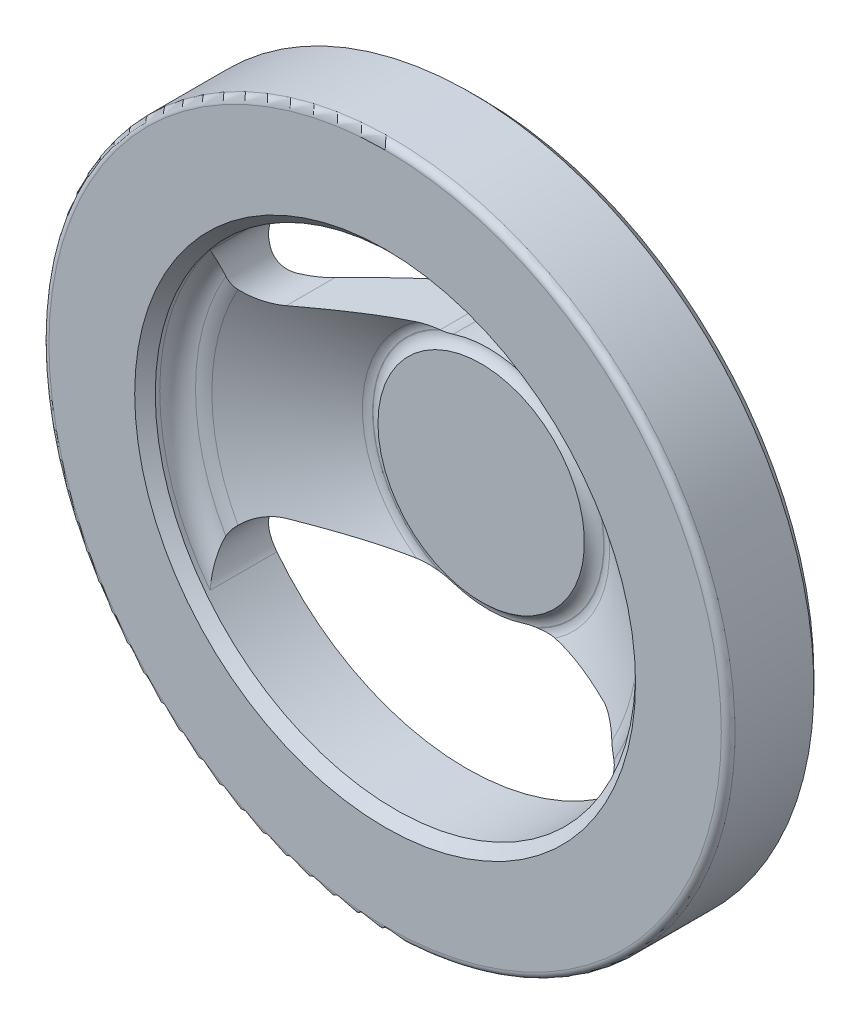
ISO-10303-21;
HEADER;
FILE_DESCRIPTION(('STEP AP214'),'2;1');
FILE_NAME('part.step','',(''),(''),'','','');
FILE_SCHEMA(('AUTOMOTIVE_DESIGN { 1 0 10303 214 1 1 1 1 }'));
ENDSEC;
DATA;
#1=APPLICATION_CONTEXT('core data for automotive mechanical design processes');
#2=APPLICATION_PROTOCOL_DEFINITION('international standard','automotive_design',2000,#1);
#3=PRODUCT_CONTEXT('',#1,'mechanical');
#4=PRODUCT('Part','Part','',(#3));
#5=PRODUCT_RELATED_PRODUCT_CATEGORY('part','',(#4));
#6=PRODUCT_DEFINITION_FORMATION('','',#4);
#7=PRODUCT_DEFINITION_CONTEXT('part definition',#1,'design');
#8=PRODUCT_DEFINITION('design','',#6,#7);
#9=PRODUCT_DEFINITION_SHAPE('','',#8);
#10=(LENGTH_UNIT() NAMED_UNIT(*) SI_UNIT(.MILLI.,.METRE.));
#11=(NAMED_UNIT(*) PLANE_ANGLE_UNIT() SI_UNIT($,.RADIAN.));
#12=(NAMED_UNIT(*) SI_UNIT($,.STERADIAN.) SOLID_ANGLE_UNIT());
#13=UNCERTAINTY_MEASURE_WITH_UNIT(LENGTH_MEASURE(1.E-05),#10,'distance_accuracy_value','');
#14=(GEOMETRIC_REPRESENTATION_CONTEXT(3) GLOBAL_UNCERTAINTY_ASSIGNED_CONTEXT((#13)) GLOBAL_UNIT_ASSIGNED_CONTEXT((#10,
#11,#12)) REPRESENTATION_CONTEXT('',''));
#15=CARTESIAN_POINT('',(0.,0.,0.));
#16=DIRECTION('',(0.,0.,1.));
#17=DIRECTION('',(1.,0.,0.));
#18=AXIS2_PLACEMENT_3D('',#15,#16,#17);
#19=CARTESIAN_POINT('',(0.,0.,22.951815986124));
#20=DIRECTION('',(0.,0.,1.));
#21=DIRECTION('',(-1.,0.,0.));
#22=AXIS2_PLACEMENT_3D('',#19,#20,#21);
#23=TOROIDAL_SURFACE('',#22,16.8823480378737,2.);
#24=CARTESIAN_POINT('',(0.,0.,21.300093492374));
#25=DIRECTION('',(0.,0.,1.));
#26=DIRECTION('',(-1.,0.,0.));
#27=AXIS2_PLACEMENT_3D('',#24,#25,#26);
#28=CIRCLE('',#27,18.0100948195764);
#29=CARTESIAN_POINT('',(-10.0809784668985,14.9243890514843,21.300093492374));
#30=VERTEX_POINT('',#29);
#31=CARTESIAN_POINT('',(-10.0809784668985,-14.9243890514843,21.300093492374));
#32=VERTEX_POINT('',#31);
#33=EDGE_CURVE('E745',#30,#32,#28,.T.);
#34=ORIENTED_EDGE('',*,*,#33,.T.);
#35=CARTESIAN_POINT('',(-10.0816086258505,-14.9243168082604,21.300293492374));
#36=CARTESIAN_POINT('',(-9.97316584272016,-14.9367489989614,21.2659123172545));
#37=CARTESIAN_POINT('',(-9.86369267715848,-14.9492993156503,21.2350288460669));
#38=CARTESIAN_POINT('',(-9.6433076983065,-14.9745648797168,21.1794098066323));
#39=CARTESIAN_POINT('',(-9.5323972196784,-14.987279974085,21.154668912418));
#40=CARTESIAN_POINT('',(-9.30991068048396,-15.0127864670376,21.1104985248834));
#41=CARTESIAN_POINT('',(-9.19833770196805,-15.025577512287,21.091052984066));
#42=CARTESIAN_POINT('',(-8.97448681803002,-15.0512404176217,21.0566900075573));
#43=CARTESIAN_POINT('',(-8.86220874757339,-15.0641122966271,21.041773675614));
#44=CARTESIAN_POINT('',(-8.52638938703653,-15.1026115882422,21.0031055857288));
#45=CARTESIAN_POINT('',(-8.30219097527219,-15.1283143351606,20.9851235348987));
#46=CARTESIAN_POINT('',(-7.85311982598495,-15.1797971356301,20.9608192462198));
#47=CARTESIAN_POINT('',(-7.62824677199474,-15.205577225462,20.9545037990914));
#48=CARTESIAN_POINT('',(-7.34144620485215,-15.2384568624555,20.9519697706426));
#49=CARTESIAN_POINT('',(-7.27952985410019,-15.2455551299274,20.9517508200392));
#50=CARTESIAN_POINT('',(-7.1556350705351,-15.2597587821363,20.9519147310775));
#51=CARTESIAN_POINT('',(-7.09365663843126,-15.2668641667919,20.9522982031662));
#52=CARTESIAN_POINT('',(-7.03167982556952,-15.273969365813,20.9529558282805));
#53=B_SPLINE_CURVE_WITH_KNOTS('',3,(#35,#36,#37,#38,#39,#40,#41,#42,#43,#44,#45,#46,#47,#48,#49,
#50,#51,#52),.UNSPECIFIED.,.F.,.F.,(4,2,2,2,2,2,2,2,4),(0.,0.343171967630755,0.686045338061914,
1.02786777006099,1.36977343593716,2.04846289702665,2.72754727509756,2.9145129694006,
3.1016682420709),.UNSPECIFIED.);
#54=CARTESIAN_POINT('',(-7.24281474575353,-15.2497642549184,20.951815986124));
#55=VERTEX_POINT('',#54);
#56=EDGE_CURVE('E619',#32,#55,#53,.T.);
#57=ORIENTED_EDGE('',*,*,#56,.T.);
#58=CARTESIAN_POINT('',(0.,0.,20.951815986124));
#59=DIRECTION('',(0.,0.,1.));
#60=DIRECTION('',(-1.,0.,0.));
#61=AXIS2_PLACEMENT_3D('',#58,#59,#60);
#62=CIRCLE('',#61,16.8823480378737);
#63=CARTESIAN_POINT('',(-7.24281474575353,15.2497642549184,20.951815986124));
#64=VERTEX_POINT('',#63);
#65=EDGE_CURVE('E753',#64,#55,#62,.T.);
#66=ORIENTED_EDGE('',*,*,#65,.F.);
#67=CARTESIAN_POINT('',(-10.0816086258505,14.9243168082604,21.300293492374));
#68=CARTESIAN_POINT('',(-9.97316584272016,14.9367489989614,21.2659123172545));
#69=CARTESIAN_POINT('',(-9.86369267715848,14.9492993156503,21.2350288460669));
#70=CARTESIAN_POINT('',(-9.6433076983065,14.9745648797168,21.1794098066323));
#71=CARTESIAN_POINT('',(-9.5323972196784,14.987279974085,21.154668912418));
#72=CARTESIAN_POINT('',(-9.30991068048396,15.0127864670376,21.1104985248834));
#73=CARTESIAN_POINT('',(-9.19833770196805,15.025577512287,21.091052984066));
#74=CARTESIAN_POINT('',(-8.97448681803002,15.0512404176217,21.0566900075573));
#75=CARTESIAN_POINT('',(-8.86220874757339,15.0641122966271,21.041773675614));
#76=CARTESIAN_POINT('',(-8.52638938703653,15.1026115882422,21.0031055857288));
#77=CARTESIAN_POINT('',(-8.30219097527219,15.1283143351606,20.9851235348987));
#78=CARTESIAN_POINT('',(-7.85311982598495,15.1797971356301,20.9608192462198));
#79=CARTESIAN_POINT('',(-7.62824677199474,15.205577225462,20.9545037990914));
#80=CARTESIAN_POINT('',(-7.34144620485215,15.2384568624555,20.9519697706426));
#81=CARTESIAN_POINT('',(-7.27952985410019,15.2455551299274,20.9517508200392));
#82=CARTESIAN_POINT('',(-7.1556350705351,15.2597587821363,20.9519147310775));
#83=CARTESIAN_POINT('',(-7.09365663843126,15.2668641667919,20.9522982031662));
#84=CARTESIAN_POINT('',(-7.03167982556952,15.273969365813,20.9529558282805));
#85=B_SPLINE_CURVE_WITH_KNOTS('',3,(#67,#68,#69,#70,#71,#72,#73,#74,#75,#76,#77,#78,#79,#80,#81,
#82,#83,#84),.UNSPECIFIED.,.F.,.F.,(4,2,2,2,2,2,2,2,4),(0.,0.343171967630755,0.686045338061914,
1.02786777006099,1.36977343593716,2.04846289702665,2.72754727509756,2.9145129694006,
3.1016682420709),.UNSPECIFIED.);
#86=EDGE_CURVE('E513',#30,#64,#85,.T.);
#87=ORIENTED_EDGE('',*,*,#86,.F.);
#88=EDGE_LOOP('',(#34,#57,#66,#87));
#89=FACE_BOUND('',#88,.T.);
#90=ADVANCED_FACE('F14',(#89),#23,.F.);
#91=CARTESIAN_POINT('',(0.,0.,21.300093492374));
#92=DIRECTION('',(0.,0.,1.));
#93=DIRECTION('',(-1.,0.,0.));
#94=AXIS2_PLACEMENT_3D('',#91,#92,#93);
#95=CONICAL_SURFACE('',#94,18.0100948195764,0.971727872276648);
#96=CARTESIAN_POINT('',(-28.4636883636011,-16.8840922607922,31.599359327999));
#97=CARTESIAN_POINT('',(-28.4159643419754,-16.7336817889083,31.5189444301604));
#98=CARTESIAN_POINT('',(-28.3615375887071,-16.5868061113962,31.4361597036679));
#99=CARTESIAN_POINT('',(-28.2402863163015,-16.3009075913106,31.2665100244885));
#100=CARTESIAN_POINT('',(-28.1734722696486,-16.1618782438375,31.1796485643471));
#101=CARTESIAN_POINT('',(-27.9563997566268,-15.7584393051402,30.9144356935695));
#102=CARTESIAN_POINT('',(-27.7891139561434,-15.5064669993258,30.7308038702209));
#103=CARTESIAN_POINT('',(-27.3782850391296,-14.9926465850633,30.3155125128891));
#104=CARTESIAN_POINT('',(-27.1261343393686,-14.7394252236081,30.0817426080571));
#105=CARTESIAN_POINT('',(-26.5774386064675,-14.2932785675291,29.6073194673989));
#106=CARTESIAN_POINT('',(-26.2807884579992,-14.1004994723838,29.3666510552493));
#107=CARTESIAN_POINT('',(-25.6701751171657,-13.7894750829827,28.8988842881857));
#108=CARTESIAN_POINT('',(-25.3579822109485,-13.6677995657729,28.6717475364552));
#109=CARTESIAN_POINT('',(-24.7115299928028,-13.4884745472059,28.225382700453));
#110=CARTESIAN_POINT('',(-24.377337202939,-13.4306406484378,28.0061336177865));
#111=CARTESIAN_POINT('',(-23.7557888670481,-13.3885458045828,27.6215237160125));
#112=CARTESIAN_POINT('',(-23.4708484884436,-13.3929026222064,27.453572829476));
#113=CARTESIAN_POINT('',(-23.039804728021,-13.4374342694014,27.2141132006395));
#114=CARTESIAN_POINT('',(-22.8951800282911,-13.45870420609,27.1362058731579));
#115=CARTESIAN_POINT('',(-22.6056051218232,-13.5145848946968,26.985589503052));
#116=CARTESIAN_POINT('',(-22.4606547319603,-13.5492104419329,26.9128863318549));
#117=CARTESIAN_POINT('',(-22.316039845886,-13.5907813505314,26.843313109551));
#118=B_SPLINE_CURVE_WITH_KNOTS('',3,(#96,#97,#98,#99,#100,#101,#102,#103,#104,#105,#106,#107,
#108,#109,#110,#111,#112,#113,#114,#115,#116,#117),.UNSPECIFIED.,.F.,.F.,(4,2,2,2,2,2,2,2,2,2,
4),(0.,0.530941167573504,1.06143549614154,2.11818270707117,3.39226477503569,4.66940526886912,
5.87835026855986,7.08379419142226,8.07196280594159,8.56834299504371,9.06527465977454),.UNSPECIFIED.);
#119=CARTESIAN_POINT('',(-23.128291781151,-13.4286077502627,27.26339222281));
#120=VERTEX_POINT('',#119);
#121=CARTESIAN_POINT('',(-27.251457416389,-14.8787779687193,30.2024437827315));
#122=VERTEX_POINT('',#121);
#123=EDGE_CURVE('E476',#120,#122,#118,.F.);
#124=ORIENTED_EDGE('',*,*,#123,.F.);
#125=CARTESIAN_POINT('',(-10.08034815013,-14.9244613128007,21.299893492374));
#126=CARTESIAN_POINT('',(-10.3661616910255,-14.8916948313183,21.3905845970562));
#127=CARTESIAN_POINT('',(-10.6509051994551,-14.859051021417,21.4846288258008));
#128=CARTESIAN_POINT('',(-11.2183018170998,-14.7940030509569,21.678823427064));
#129=CARTESIAN_POINT('',(-11.5009551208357,-14.7615988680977,21.7789732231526));
#130=CARTESIAN_POINT('',(-12.3456452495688,-14.6647611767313,22.087601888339));
#131=CARTESIAN_POINT('',(-12.9047058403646,-14.6006688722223,22.3043544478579));
#132=CARTESIAN_POINT('',(-14.0143445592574,-14.4734567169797,22.75536130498));
#133=CARTESIAN_POINT('',(-14.5649384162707,-14.4103350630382,22.9895767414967));
#134=CARTESIAN_POINT('',(-15.6597961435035,-14.2848174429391,23.4726986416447));
#135=CARTESIAN_POINT('',(-16.204059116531,-14.2224215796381,23.7216071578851));
#136=CARTESIAN_POINT('',(-17.2862362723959,-14.0983576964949,24.2311099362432));
#137=CARTESIAN_POINT('',(-17.8241580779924,-14.0366888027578,24.4916878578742));
#138=CARTESIAN_POINT('',(-18.8951199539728,-13.9139106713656,25.0227515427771));
#139=CARTESIAN_POINT('',(-19.4281601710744,-13.8528014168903,25.2932370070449));
#140=CARTESIAN_POINT('',(-20.4912098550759,-13.7309303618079,25.8430510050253));
#141=CARTESIAN_POINT('',(-21.0212099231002,-13.6701696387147,26.1223978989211));
#142=CARTESIAN_POINT('',(-22.0774929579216,-13.5490743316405,26.6880502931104));
#143=CARTESIAN_POINT('',(-22.6037761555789,-13.4887397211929,26.9743553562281));
#144=CARTESIAN_POINT('',(-23.128491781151,-13.4285848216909,27.263502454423));
#145=B_SPLINE_CURVE_WITH_KNOTS('',3,(#125,#126,#127,#128,#129,#130,#131,#132,#133,#134,#135,
#136,#137,#138,#139,#140,#141,#142,#143,#144),.UNSPECIFIED.,.F.,.F.,(4,2,2,2,2,2,2,2,2,4),(0.,
0.904874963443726,1.80966462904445,3.61831409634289,5.42305236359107,7.22804335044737,
9.03058137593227,10.8330650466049,12.6395647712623,14.4459512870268),.UNSPECIFIED.);
#146=EDGE_CURVE('E649',#32,#120,#145,.T.);
#147=ORIENTED_EDGE('',*,*,#146,.F.);
#148=ORIENTED_EDGE('',*,*,#33,.F.);
#149=CARTESIAN_POINT('',(-10.08034815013,14.9244613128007,21.299893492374));
#150=CARTESIAN_POINT('',(-10.3661616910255,14.8916948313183,21.3905845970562));
#151=CARTESIAN_POINT('',(-10.6509051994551,14.859051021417,21.4846288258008));
#152=CARTESIAN_POINT('',(-11.2183018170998,14.7940030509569,21.678823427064));
#153=CARTESIAN_POINT('',(-11.5009551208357,14.7615988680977,21.7789732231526));
#154=CARTESIAN_POINT('',(-12.3456452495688,14.6647611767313,22.087601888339));
#155=CARTESIAN_POINT('',(-12.9047058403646,14.6006688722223,22.3043544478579));
#156=CARTESIAN_POINT('',(-14.0143445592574,14.4734567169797,22.75536130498));
#157=CARTESIAN_POINT('',(-14.5649384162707,14.4103350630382,22.9895767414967));
#158=CARTESIAN_POINT('',(-15.6597961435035,14.2848174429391,23.4726986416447));
#159=CARTESIAN_POINT('',(-16.204059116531,14.2224215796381,23.7216071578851));
#160=CARTESIAN_POINT('',(-17.2862362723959,14.0983576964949,24.2311099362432));
#161=CARTESIAN_POINT('',(-17.8241580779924,14.0366888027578,24.4916878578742));
#162=CARTESIAN_POINT('',(-18.8951199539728,13.9139106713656,25.0227515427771));
#163=CARTESIAN_POINT('',(-19.4281601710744,13.8528014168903,25.2932370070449));
#164=CARTESIAN_POINT('',(-20.4912098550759,13.7309303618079,25.8430510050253));
#165=CARTESIAN_POINT('',(-21.0212099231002,13.6701696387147,26.1223978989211));
#166=CARTESIAN_POINT('',(-22.0774929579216,13.5490743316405,26.6880502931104));
#167=CARTESIAN_POINT('',(-22.6037761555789,13.4887397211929,26.9743553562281));
#168=CARTESIAN_POINT('',(-23.128491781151,13.4285848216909,27.263502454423));
#169=B_SPLINE_CURVE_WITH_KNOTS('',3,(#149,#150,#151,#152,#153,#154,#155,#156,#157,#158,#159,
#160,#161,#162,#163,#164,#165,#166,#167,#168),.UNSPECIFIED.,.F.,.F.,(4,2,2,2,2,2,2,2,2,4),(0.,
0.904874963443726,1.80966462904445,3.61831409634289,5.42305236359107,7.22804335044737,
9.03058137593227,10.8330650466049,12.6395647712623,14.4459512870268),.UNSPECIFIED.);
#170=CARTESIAN_POINT('',(-23.128291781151,13.4286077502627,27.26339222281));
#171=VERTEX_POINT('',#170);
#172=EDGE_CURVE('E521',#30,#171,#169,.T.);
#173=ORIENTED_EDGE('',*,*,#172,.T.);
#174=CARTESIAN_POINT('',(-28.4636883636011,16.8840922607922,31.599359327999));
#175=CARTESIAN_POINT('',(-28.4159643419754,16.7336817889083,31.5189444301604));
#176=CARTESIAN_POINT('',(-28.3615375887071,16.5868061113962,31.4361597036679));
#177=CARTESIAN_POINT('',(-28.2402863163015,16.3009075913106,31.2665100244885));
#178=CARTESIAN_POINT('',(-28.1734722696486,16.1618782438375,31.1796485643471));
#179=CARTESIAN_POINT('',(-27.9563997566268,15.7584393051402,30.9144356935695));
#180=CARTESIAN_POINT('',(-27.7891139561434,15.5064669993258,30.7308038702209));
#181=CARTESIAN_POINT('',(-27.3782850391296,14.9926465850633,30.3155125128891));
#182=CARTESIAN_POINT('',(-27.1261343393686,14.7394252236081,30.0817426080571));
#183=CARTESIAN_POINT('',(-26.5774386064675,14.2932785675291,29.6073194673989));
#184=CARTESIAN_POINT('',(-26.2807884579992,14.1004994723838,29.3666510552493));
#185=CARTESIAN_POINT('',(-25.6701751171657,13.7894750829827,28.8988842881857));
#186=CARTESIAN_POINT('',(-25.3579822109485,13.6677995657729,28.6717475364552));
#187=CARTESIAN_POINT('',(-24.7115299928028,13.4884745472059,28.225382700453));
#188=CARTESIAN_POINT('',(-24.377337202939,13.4306406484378,28.0061336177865));
#189=CARTESIAN_POINT('',(-23.7557888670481,13.3885458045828,27.6215237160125));
#190=CARTESIAN_POINT('',(-23.4708484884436,13.3929026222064,27.453572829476));
#191=CARTESIAN_POINT('',(-23.039804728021,13.4374342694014,27.2141132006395));
#192=CARTESIAN_POINT('',(-22.8951800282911,13.45870420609,27.1362058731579));
#193=CARTESIAN_POINT('',(-22.6056051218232,13.5145848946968,26.985589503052));
#194=CARTESIAN_POINT('',(-22.4606547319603,13.5492104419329,26.9128863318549));
#195=CARTESIAN_POINT('',(-22.316039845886,13.5907813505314,26.843313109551));
#196=B_SPLINE_CURVE_WITH_KNOTS('',3,(#174,#175,#176,#177,#178,#179,#180,#181,#182,#183,#184,
#185,#186,#187,#188,#189,#190,#191,#192,#193,#194,#195),.UNSPECIFIED.,.F.,.F.,(4,2,2,2,2,2,2,2,
2,2,4),(0.,0.530941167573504,1.06143549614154,2.11818270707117,3.39226477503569,
4.66940526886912,5.87835026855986,7.08379419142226,8.07196280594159,8.56834299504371,
9.06527465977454),.UNSPECIFIED.);
#197=CARTESIAN_POINT('',(-27.251457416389,14.8787779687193,30.2024437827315));
#198=VERTEX_POINT('',#197);
#199=EDGE_CURVE('E387',#171,#198,#196,.F.);
#200=ORIENTED_EDGE('',*,*,#199,.T.);
#201=CARTESIAN_POINT('',(0.,0.,30.2024437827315));
#202=DIRECTION('',(0.,0.,1.));
#203=DIRECTION('',(-1.,0.,0.));
#204=AXIS2_PLACEMENT_3D('',#201,#202,#203);
#205=CIRCLE('',#204,31.0486709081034);
#206=EDGE_CURVE('E755',#198,#122,#205,.T.);
#207=ORIENTED_EDGE('',*,*,#206,.T.);
#208=EDGE_LOOP('',(#124,#147,#148,#173,#200,#207));
#209=FACE_BOUND('',#208,.T.);
#210=ADVANCED_FACE('F734',(#209),#95,.F.);
#211=CARTESIAN_POINT('',(0.,0.,26.073137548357));
#212=DIRECTION('',(0.,0.,1.));
#213=DIRECTION('',(-1.,0.,0.));
#214=AXIS2_PLACEMENT_3D('',#211,#212,#213);
#215=TOROIDAL_SURFACE('',#214,33.8680378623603,5.);
#216=CARTESIAN_POINT('',(27.251457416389,-14.8787779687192,30.2024437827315));
#217=VERTEX_POINT('',#216);
#218=CARTESIAN_POINT('',(27.251457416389,14.8787779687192,30.2024437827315));
#219=VERTEX_POINT('',#218);
#220=EDGE_CURVE('E849',#217,#219,#205,.T.);
#221=ORIENTED_EDGE('',*,*,#220,.F.);
#222=CARTESIAN_POINT('',(27.6060966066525,-21.5145686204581,30.943407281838));
#223=CARTESIAN_POINT('',(27.6934197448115,-21.4051556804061,30.9429977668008));
#224=CARTESIAN_POINT('',(27.7761199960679,-21.292058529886,30.9438311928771));
#225=CARTESIAN_POINT('',(27.9317239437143,-21.0593813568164,30.9477484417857));
#226=CARTESIAN_POINT('',(28.0046294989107,-20.9398025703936,30.9508318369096));
#227=CARTESIAN_POINT('',(28.1400491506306,-20.6951458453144,30.9590088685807));
#228=CARTESIAN_POINT('',(28.2025750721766,-20.5700743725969,30.9641001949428));
#229=CARTESIAN_POINT('',(28.3169160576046,-20.315199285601,30.9758106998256));
#230=CARTESIAN_POINT('',(28.368730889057,-20.1853955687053,30.9824299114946));
#231=CARTESIAN_POINT('',(28.4616898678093,-19.920844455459,30.9966181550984));
#232=CARTESIAN_POINT('',(28.5027416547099,-19.7860649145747,31.0041946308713));
#233=CARTESIAN_POINT('',(28.573345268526,-19.5135135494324,31.0194338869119));
#234=CARTESIAN_POINT('',(28.6028922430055,-19.375740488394,31.0270967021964));
#235=CARTESIAN_POINT('',(28.6738851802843,-18.9594467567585,31.0488199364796));
#236=CARTESIAN_POINT('',(28.6977961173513,-18.6776292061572,31.0616365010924));
#237=CARTESIAN_POINT('',(28.6977583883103,-18.1510306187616,31.0741103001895));
#238=CARTESIAN_POINT('',(28.6797191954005,-17.9062789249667,31.07528328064));
#239=CARTESIAN_POINT('',(28.6260896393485,-17.5436037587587,31.0651125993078));
#240=CARTESIAN_POINT('',(28.6037827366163,-17.4234477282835,31.0597334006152));
#241=CARTESIAN_POINT('',(28.5505224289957,-17.1854084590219,31.0441314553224));
#242=CARTESIAN_POINT('',(28.5195725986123,-17.0675243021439,31.0339107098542));
#243=CARTESIAN_POINT('',(28.4491349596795,-16.834168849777,31.0076894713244));
#244=CARTESIAN_POINT('',(28.4095947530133,-16.718717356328,30.9916530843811));
#245=CARTESIAN_POINT('',(28.3226094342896,-16.4919545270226,30.9529845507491));
#246=CARTESIAN_POINT('',(28.2751641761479,-16.3806432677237,30.9303522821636));
#247=CARTESIAN_POINT('',(28.1731059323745,-16.1631698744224,30.8777668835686));
#248=CARTESIAN_POINT('',(28.1184942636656,-16.0570067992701,30.8478150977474));
#249=CARTESIAN_POINT('',(28.003051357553,-15.8507683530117,30.7800087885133));
#250=CARTESIAN_POINT('',(27.9422210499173,-15.7506920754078,30.7421554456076));
#251=CARTESIAN_POINT('',(27.8209951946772,-15.5658404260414,30.6618033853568));
#252=CARTESIAN_POINT('',(27.7610186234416,-15.480490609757,30.6199913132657));
#253=CARTESIAN_POINT('',(27.6378490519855,-15.3160743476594,30.5293239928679));
#254=CARTESIAN_POINT('',(27.5746559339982,-15.2370081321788,30.480468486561));
#255=CARTESIAN_POINT('',(27.4458800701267,-15.0852323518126,30.3755258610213));
#256=CARTESIAN_POINT('',(27.3802885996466,-15.0125501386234,30.3194099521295));
#257=CARTESIAN_POINT('',(27.248083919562,-14.8740640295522,30.2003132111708));
#258=CARTESIAN_POINT('',(27.1814707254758,-14.8082600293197,30.1373324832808));
#259=CARTESIAN_POINT('',(27.114906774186,-14.7459724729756,30.071023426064));
#260=B_SPLINE_CURVE_WITH_KNOTS('',3,(#222,#223,#224,#225,#226,#227,#228,#229,#230,#231,#232,
#233,#234,#235,#236,#237,#238,#239,#240,#241,#242,#243,#244,#245,#246,#247,#248,#249,#250,#251,
#252,#253,#254,#255,#256,#257,#258,#259),.UNSPECIFIED.,.F.,.F.,(4,2,2,2,2,2,2,2,2,2,2,2,2,2,2,2,
2,2,4),(0.,0.419824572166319,0.839569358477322,1.25883261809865,1.67810497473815,
2.10086544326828,2.52380402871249,3.3686673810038,4.10183326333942,4.46845581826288,
4.83492697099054,5.2036995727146,5.57247899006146,5.9411907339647,6.30984743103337,
6.64656291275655,6.98329073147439,7.32139722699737,7.65949859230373),.UNSPECIFIED.);
#261=CARTESIAN_POINT('',(28.285761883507,-16.4085131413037,30.9349158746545));
#262=VERTEX_POINT('',#261);
#263=EDGE_CURVE('E339',#217,#262,#260,.F.);
#264=ORIENTED_EDGE('',*,*,#263,.T.);
#265=CARTESIAN_POINT('',(0.,0.,30.9349158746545));
#266=DIRECTION('',(0.,0.,1.));
#267=DIRECTION('',(-1.,0.,0.));
#268=AXIS2_PLACEMENT_3D('',#265,#266,#267);
#269=CIRCLE('',#268,32.7005141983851);
#270=CARTESIAN_POINT('',(28.285761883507,16.4085131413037,30.9349158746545));
#271=VERTEX_POINT('',#270);
#272=EDGE_CURVE('E843',#262,#271,#269,.T.);
#273=ORIENTED_EDGE('',*,*,#272,.T.);
#274=CARTESIAN_POINT('',(27.251242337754,14.8785606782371,30.202243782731));
#275=CARTESIAN_POINT('',(27.3161176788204,14.9440683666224,30.2625962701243));
#276=CARTESIAN_POINT('',(27.3806732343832,15.0129385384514,30.3196596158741));
#277=CARTESIAN_POINT('',(27.508119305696,15.157168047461,30.4271138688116));
#278=CARTESIAN_POINT('',(27.5710093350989,15.2325292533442,30.4775028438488));
#279=CARTESIAN_POINT('',(27.6927309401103,15.3877715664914,30.5704640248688));
#280=CARTESIAN_POINT('',(27.7516208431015,15.4675198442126,30.613181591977));
#281=CARTESIAN_POINT('',(27.8658412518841,15.6325048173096,30.692158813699));
#282=CARTESIAN_POINT('',(27.9211733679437,15.717738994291,30.728421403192));
#283=CARTESIAN_POINT('',(28.0316987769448,15.9002035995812,30.7973415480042));
#284=CARTESIAN_POINT('',(28.0865300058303,15.9978487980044,30.8294819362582));
#285=CARTESIAN_POINT('',(28.1908470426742,16.1993838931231,30.8872659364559));
#286=CARTESIAN_POINT('',(28.240261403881,16.3033343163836,30.9128276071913));
#287=CARTESIAN_POINT('',(28.2861735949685,16.4094637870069,30.9351158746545));
#288=B_SPLINE_CURVE_WITH_KNOTS('',3,(#274,#275,#276,#277,#278,#279,#280,#281,#282,#283,#284,
#285,#286,#287),.UNSPECIFIED.,.F.,.F.,(4,2,2,2,2,2,4),(0.,0.330495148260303,0.661085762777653,
0.984533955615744,1.30783470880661,1.6568853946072,2.01009354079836),.UNSPECIFIED.);
#289=EDGE_CURVE('E367',#219,#271,#288,.T.);
#290=ORIENTED_EDGE('',*,*,#289,.F.);
#291=EDGE_LOOP('',(#221,#264,#273,#290));
#292=FACE_BOUND('',#291,.T.);
#293=ADVANCED_FACE('F359',(#292),#215,.T.);
#294=CARTESIAN_POINT('',(0.,0.,33.851982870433));
#295=DIRECTION('',(0.,0.,1.));
#296=DIRECTION('',(-1.,0.,0.));
#297=AXIS2_PLACEMENT_3D('',#294,#295,#296);
#298=TOROIDAL_SURFACE('',#297,32.,2.99999999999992);
#299=CARTESIAN_POINT('',(27.647405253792,-21.4620824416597,33.851982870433));
#300=CARTESIAN_POINT('',(27.6499424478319,-21.4588140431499,33.8490156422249));
#301=CARTESIAN_POINT('',(27.652475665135,-21.4555423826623,33.846048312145));
#302=CARTESIAN_POINT('',(27.8630222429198,-21.1829214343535,33.5990246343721));
#303=CARTESIAN_POINT('',(28.0440932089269,-20.8915630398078,33.3543447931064));
#304=CARTESIAN_POINT('',(28.2698574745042,-20.4273084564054,32.9939415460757));
#305=CARTESIAN_POINT('',(28.337569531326,-20.2676409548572,32.8746559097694));
#306=CARTESIAN_POINT('',(28.4566694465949,-19.9398598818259,32.6395119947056));
#307=CARTESIAN_POINT('',(28.5080644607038,-19.7717500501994,32.5236522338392));
#308=CARTESIAN_POINT('',(28.5831813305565,-19.4689218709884,32.3239055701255));
#309=CARTESIAN_POINT('',(28.6105791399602,-19.3357928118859,32.2389788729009));
#310=CARTESIAN_POINT('',(28.6546481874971,-19.0655428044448,32.072775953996));
#311=CARTESIAN_POINT('',(28.6713162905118,-18.9284207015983,31.9915008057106));
#312=CARTESIAN_POINT('',(28.7040704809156,-18.5131376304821,31.7553028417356));
#313=CARTESIAN_POINT('',(28.7033313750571,-18.2294024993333,31.6068997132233));
#314=CARTESIAN_POINT('',(28.6656051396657,-17.8158171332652,31.413883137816));
#315=CARTESIAN_POINT('',(28.6492288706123,-17.6891264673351,31.3578223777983));
#316=CARTESIAN_POINT('',(28.6061961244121,-17.4348116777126,31.2522260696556));
#317=CARTESIAN_POINT('',(28.5795468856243,-17.3071882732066,31.2026859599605));
#318=CARTESIAN_POINT('',(28.5151098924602,-17.0503348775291,31.1109046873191));
#319=CARTESIAN_POINT('',(28.4771982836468,-16.9211031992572,31.0687534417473));
#320=CARTESIAN_POINT('',(28.3899416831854,-16.6633880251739,30.9940518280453));
#321=CARTESIAN_POINT('',(28.3405696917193,-16.5349070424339,30.9615245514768));
#322=CARTESIAN_POINT('',(28.2853499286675,-16.4075624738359,30.9347158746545));
#323=B_SPLINE_CURVE_WITH_KNOTS('',3,(#299,#300,#301,#302,#303,#304,#305,#306,#307,#308,#309,
#310,#311,#312,#313,#314,#315,#316,#317,#318,#319,#320,#321,#322),.UNSPECIFIED.,.F.,.F.,(4,2,2,
2,2,2,2,2,2,2,2,4),(0.,0.0152752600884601,1.27159217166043,1.90252072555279,2.53317220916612,
3.01353884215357,3.49404577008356,4.44900234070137,4.8671180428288,5.28493967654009,
5.70753791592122,6.13114205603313),.UNSPECIFIED.);
#324=CARTESIAN_POINT('',(27.647405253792,-21.4620824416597,33.851982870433));
#325=VERTEX_POINT('',#324);
#326=EDGE_CURVE('E268',#325,#262,#323,.T.);
#327=ORIENTED_EDGE('',*,*,#326,.F.);
#328=CARTESIAN_POINT('',(0.,0.,33.851982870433));
#329=DIRECTION('',(0.,0.,1.));
#330=DIRECTION('',(-1.,0.,0.));
#331=AXIS2_PLACEMENT_3D('',#328,#329,#330);
#332=CIRCLE('',#331,35.);
#333=CARTESIAN_POINT('',(27.647405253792,21.4620824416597,33.851982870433));
#334=VERTEX_POINT('',#333);
#335=EDGE_CURVE('E277',#325,#334,#332,.T.);
#336=ORIENTED_EDGE('',*,*,#335,.T.);
#337=CARTESIAN_POINT('',(27.647405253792,21.4620824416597,33.851982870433));
#338=CARTESIAN_POINT('',(27.6499424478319,21.4588140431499,33.8490156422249));
#339=CARTESIAN_POINT('',(27.652475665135,21.4555423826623,33.846048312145));
#340=CARTESIAN_POINT('',(27.8630222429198,21.1829214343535,33.5990246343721));
#341=CARTESIAN_POINT('',(28.0440932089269,20.8915630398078,33.3543447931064));
#342=CARTESIAN_POINT('',(28.2698574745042,20.4273084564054,32.9939415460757));
#343=CARTESIAN_POINT('',(28.337569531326,20.2676409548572,32.8746559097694));
#344=CARTESIAN_POINT('',(28.4566694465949,19.9398598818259,32.6395119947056));
#345=CARTESIAN_POINT('',(28.5080644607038,19.7717500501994,32.5236522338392));
#346=CARTESIAN_POINT('',(28.5831813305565,19.4689218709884,32.3239055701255));
#347=CARTESIAN_POINT('',(28.6105791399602,19.3357928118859,32.2389788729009));
#348=CARTESIAN_POINT('',(28.6546481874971,19.0655428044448,32.072775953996));
#349=CARTESIAN_POINT('',(28.6713162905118,18.9284207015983,31.9915008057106));
#350=CARTESIAN_POINT('',(28.7040704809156,18.5131376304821,31.7553028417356));
#351=CARTESIAN_POINT('',(28.7033313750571,18.2294024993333,31.6068997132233));
#352=CARTESIAN_POINT('',(28.6656051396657,17.8158171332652,31.413883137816));
#353=CARTESIAN_POINT('',(28.6492288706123,17.6891264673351,31.3578223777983));
#354=CARTESIAN_POINT('',(28.6061961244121,17.4348116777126,31.2522260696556));
#355=CARTESIAN_POINT('',(28.5795468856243,17.3071882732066,31.2026859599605));
#356=CARTESIAN_POINT('',(28.5151098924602,17.0503348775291,31.1109046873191));
#357=CARTESIAN_POINT('',(28.4771982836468,16.9211031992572,31.0687534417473));
#358=CARTESIAN_POINT('',(28.3899416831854,16.6633880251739,30.9940518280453));
#359=CARTESIAN_POINT('',(28.3405696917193,16.5349070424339,30.9615245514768));
#360=CARTESIAN_POINT('',(28.2853499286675,16.4075624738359,30.9347158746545));
#361=B_SPLINE_CURVE_WITH_KNOTS('',3,(#337,#338,#339,#340,#341,#342,#343,#344,#345,#346,#347,
#348,#349,#350,#351,#352,#353,#354,#355,#356,#357,#358,#359,#360),.UNSPECIFIED.,.F.,.F.,(4,2,2,
2,2,2,2,2,2,2,2,4),(0.,0.0152752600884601,1.27159217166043,1.90252072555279,2.53317220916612,
3.01353884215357,3.49404577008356,4.44900234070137,4.8671180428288,5.28493967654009,
5.70753791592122,6.13114205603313),.UNSPECIFIED.);
#362=EDGE_CURVE('E1397',#334,#271,#361,.T.);
#363=ORIENTED_EDGE('',*,*,#362,.T.);
#364=ORIENTED_EDGE('',*,*,#272,.F.);
#365=EDGE_LOOP('',(#327,#336,#363,#364));
#366=FACE_BOUND('',#365,.T.);
#367=ADVANCED_FACE('F1158',(#366),#298,.F.);
#368=CARTESIAN_POINT('',(-33.6602540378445,0.,24.3094010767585));
#369=DIRECTION('',(0.,0.,-1.));
#370=DIRECTION('',(1.,0.,0.));
#371=AXIS2_PLACEMENT_3D('',#368,#369,#370);
#372=PLANE('',#371);
#373=CARTESIAN_POINT('',(0.,0.,24.3094010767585));
#374=DIRECTION('',(0.,0.,1.));
#375=DIRECTION('',(-1.,0.,0.));
#376=AXIS2_PLACEMENT_3D('',#373,#374,#375);
#377=CIRCLE('',#376,33.6602540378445);
#378=CARTESIAN_POINT('',(28.6456481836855,-17.6759594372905,24.3094010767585));
#379=VERTEX_POINT('',#378);
#380=CARTESIAN_POINT('',(28.6456481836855,17.6759594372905,24.3094010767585));
#381=VERTEX_POINT('',#380);
#382=EDGE_CURVE('E948',#379,#381,#377,.T.);
#383=ORIENTED_EDGE('',*,*,#382,.F.);
#384=CARTESIAN_POINT('',(23.6977759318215,-18.3960706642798,24.3094010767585));
#385=DIRECTION('',(0.,0.,-1.));
#386=DIRECTION('',(1.,0.,0.));
#387=AXIS2_PLACEMENT_3D('',#384,#385,#386);
#388=CIRCLE('',#387,5.);
#389=CARTESIAN_POINT('',(28.3960711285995,-16.6855086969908,24.3094010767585));
#390=VERTEX_POINT('',#389);
#391=EDGE_CURVE('E264',#379,#390,#388,.F.);
#392=ORIENTED_EDGE('',*,*,#391,.T.);
#393=CARTESIAN_POINT('',(0.,0.,24.3094010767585));
#394=DIRECTION('',(0.,0.,1.));
#395=DIRECTION('',(-1.,0.,0.));
#396=AXIS2_PLACEMENT_3D('',#393,#394,#395);
#397=CIRCLE('',#396,32.935437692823);
#398=CARTESIAN_POINT('',(28.3960711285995,16.6855086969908,24.3094010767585));
#399=VERTEX_POINT('',#398);
#400=EDGE_CURVE('E944',#390,#399,#397,.T.);
#401=ORIENTED_EDGE('',*,*,#400,.T.);
#402=CARTESIAN_POINT('',(23.6977759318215,18.3960706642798,24.3094010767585));
#403=DIRECTION('',(0.,0.,-1.));
#404=DIRECTION('',(1.,0.,0.));
#405=AXIS2_PLACEMENT_3D('',#402,#403,#404);
#406=CIRCLE('',#405,5.);
#407=EDGE_CURVE('E1388',#381,#399,#406,.T.);
#408=ORIENTED_EDGE('',*,*,#407,.F.);
#409=EDGE_LOOP('',(#383,#392,#401,#408));
#410=FACE_BOUND('',#409,.T.);
#411=ADVANCED_FACE('F1166',(#410),#372,.T.);
#412=CARTESIAN_POINT('',(0.,0.,19.3094010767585));
#413=DIRECTION('',(0.,0.,1.));
#414=DIRECTION('',(-1.,0.,0.));
#415=AXIS2_PLACEMENT_3D('',#412,#413,#414);
#416=TOROIDAL_SURFACE('',#415,32.9354376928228,5.);
#417=CARTESIAN_POINT('',(25.9074497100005,-13.9108346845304,22.850926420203));
#418=CARTESIAN_POINT('',(25.9784188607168,-13.945791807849,22.9297439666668));
#419=CARTESIAN_POINT('',(26.0509292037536,-13.9836136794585,23.0059427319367));
#420=CARTESIAN_POINT('',(26.1982470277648,-14.065397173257,23.1527173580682));
#421=CARTESIAN_POINT('',(26.2730559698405,-14.1093627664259,23.2232895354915));
#422=CARTESIAN_POINT('',(26.4242486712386,-14.2038978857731,23.358462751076));
#423=CARTESIAN_POINT('',(26.5006353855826,-14.2544809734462,23.4230510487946));
#424=CARTESIAN_POINT('',(26.6538575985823,-14.3624174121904,23.5456756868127));
#425=CARTESIAN_POINT('',(26.7306929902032,-14.4197692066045,23.6037135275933));
#426=CARTESIAN_POINT('',(26.8841654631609,-14.5416489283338,23.7131791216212));
#427=CARTESIAN_POINT('',(26.9607998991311,-14.6062094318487,23.7645744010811));
#428=CARTESIAN_POINT('',(27.112410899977,-14.742218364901,23.8601970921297));
#429=CARTESIAN_POINT('',(27.1873875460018,-14.8136664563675,23.904424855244));
#430=CARTESIAN_POINT('',(27.3344484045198,-14.9630579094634,23.9855391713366));
#431=CARTESIAN_POINT('',(27.4065381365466,-15.0409879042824,24.0224403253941));
#432=CARTESIAN_POINT('',(27.5469483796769,-15.2030526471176,24.0890744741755));
#433=CARTESIAN_POINT('',(27.6152691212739,-15.2871870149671,24.1188079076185));
#434=CARTESIAN_POINT('',(27.7432072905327,-15.4558323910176,24.1697417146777));
#435=CARTESIAN_POINT('',(27.8031012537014,-15.5400112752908,24.1913501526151));
#436=CARTESIAN_POINT('',(27.918097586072,-15.7128519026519,24.2287593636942));
#437=CARTESIAN_POINT('',(27.9731983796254,-15.8015151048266,24.2445582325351));
#438=CARTESIAN_POINT('',(28.0780674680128,-15.9827708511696,24.2707506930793));
#439=CARTESIAN_POINT('',(28.1278326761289,-16.0753656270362,24.2811411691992));
#440=CARTESIAN_POINT('',(28.2215849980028,-16.2638792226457,24.2969874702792));
#441=CARTESIAN_POINT('',(28.2655698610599,-16.3597993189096,24.3024413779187));
#442=CARTESIAN_POINT('',(28.3491073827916,-16.5583588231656,24.3090724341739));
#443=CARTESIAN_POINT('',(28.3884034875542,-16.6611123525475,24.3100645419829));
#444=CARTESIAN_POINT('',(28.4601319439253,-16.8689588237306,24.3079017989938));
#445=CARTESIAN_POINT('',(28.4925618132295,-16.9740525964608,24.3047454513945));
#446=CARTESIAN_POINT('',(28.5792677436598,-17.2919022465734,24.2900189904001));
#447=CARTESIAN_POINT('',(28.6230226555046,-17.5073754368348,24.2731945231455));
#448=CARTESIAN_POINT('',(28.6861761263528,-17.9730264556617,24.2275186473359));
#449=CARTESIAN_POINT('',(28.7010631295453,-18.2236607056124,24.1972655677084));
#450=CARTESIAN_POINT('',(28.6932782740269,-18.7240688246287,24.1322764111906));
#451=CARTESIAN_POINT('',(28.6705675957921,-18.973841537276,24.0975357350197));
#452=CARTESIAN_POINT('',(28.6062109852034,-19.3588699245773,24.0450749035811));
#453=CARTESIAN_POINT('',(28.5772549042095,-19.4962609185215,24.0265781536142));
#454=CARTESIAN_POINT('',(28.5078294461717,-19.7683205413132,23.9913519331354));
#455=CARTESIAN_POINT('',(28.4673639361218,-19.9029900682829,23.9746218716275));
#456=CARTESIAN_POINT('',(28.3751709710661,-20.1685584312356,23.9439211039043));
#457=CARTESIAN_POINT('',(28.3234569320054,-20.2994615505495,23.929947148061));
#458=CARTESIAN_POINT('',(28.2090542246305,-20.5566648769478,23.9055595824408));
#459=CARTESIAN_POINT('',(28.1463707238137,-20.6829672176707,23.8951443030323));
#460=CARTESIAN_POINT('',(28.0153159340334,-20.9211368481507,23.8791057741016));
#461=CARTESIAN_POINT('',(27.9476786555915,-21.0333888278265,23.8731915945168));
#462=CARTESIAN_POINT('',(27.8038056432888,-21.2522389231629,23.865248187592));
#463=CARTESIAN_POINT('',(27.7275776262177,-21.3588419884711,23.8632155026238));
#464=CARTESIAN_POINT('',(27.647249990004,-21.4622824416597,23.8632546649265));
#465=B_SPLINE_CURVE_WITH_KNOTS('',3,(#417,#418,#419,#420,#421,#422,#423,#424,#425,#426,#427,
#428,#429,#430,#431,#432,#433,#434,#435,#436,#437,#438,#439,#440,#441,#442,#443,#444,#445,#446,
#447,#448,#449,#450,#451,#452,#453,#454,#455,#456,#457,#458,#459,#460,#461,#462,#463,#464),
.UNSPECIFIED.,.F.,.F.,(4,2,2,2,2,2,2,2,2,2,2,2,2,2,2,2,2,2,2,2,2,2,2,4),(0.,0.334983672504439,
0.67018487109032,1.00608409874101,1.34190622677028,1.67931255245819,2.01670232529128,
2.35341281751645,2.69010269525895,3.00637873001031,3.32275834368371,3.63932001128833,
3.95600457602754,4.28570844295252,4.61553130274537,5.27469703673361,6.03050627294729,
6.78709636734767,7.21153464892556,7.63583049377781,8.0596230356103,8.48321647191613,
8.87632446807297,9.26908212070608),.UNSPECIFIED.);
#466=CARTESIAN_POINT('',(25.907629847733,-13.9109234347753,22.851126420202));
#467=VERTEX_POINT('',#466);
#468=EDGE_CURVE('E289',#467,#390,#465,.T.);
#469=ORIENTED_EDGE('',*,*,#468,.F.);
#470=CARTESIAN_POINT('',(0.,0.,22.851126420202));
#471=DIRECTION('',(0.,0.,1.));
#472=DIRECTION('',(-1.,0.,0.));
#473=AXIS2_PLACEMENT_3D('',#470,#471,#472);
#474=CIRCLE('',#473,29.406106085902);
#475=CARTESIAN_POINT('',(25.907629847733,13.9109234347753,22.851126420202));
#476=VERTEX_POINT('',#475);
#477=EDGE_CURVE('E941',#467,#476,#474,.T.);
#478=ORIENTED_EDGE('',*,*,#477,.T.);
#479=CARTESIAN_POINT('',(25.9074497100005,13.9108346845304,22.850926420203));
#480=CARTESIAN_POINT('',(25.9784188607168,13.945791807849,22.9297439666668));
#481=CARTESIAN_POINT('',(26.0509292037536,13.9836136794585,23.0059427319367));
#482=CARTESIAN_POINT('',(26.1982470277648,14.065397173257,23.1527173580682));
#483=CARTESIAN_POINT('',(26.2730559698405,14.1093627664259,23.2232895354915));
#484=CARTESIAN_POINT('',(26.4242486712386,14.2038978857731,23.358462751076));
#485=CARTESIAN_POINT('',(26.5006353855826,14.2544809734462,23.4230510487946));
#486=CARTESIAN_POINT('',(26.6538575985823,14.3624174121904,23.5456756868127));
#487=CARTESIAN_POINT('',(26.7306929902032,14.4197692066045,23.6037135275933));
#488=CARTESIAN_POINT('',(26.8841654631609,14.5416489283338,23.7131791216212));
#489=CARTESIAN_POINT('',(26.9607998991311,14.6062094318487,23.7645744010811));
#490=CARTESIAN_POINT('',(27.112410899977,14.742218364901,23.8601970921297));
#491=CARTESIAN_POINT('',(27.1873875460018,14.8136664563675,23.904424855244));
#492=CARTESIAN_POINT('',(27.3344484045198,14.9630579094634,23.9855391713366));
#493=CARTESIAN_POINT('',(27.4065381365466,15.0409879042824,24.0224403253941));
#494=CARTESIAN_POINT('',(27.5469483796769,15.2030526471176,24.0890744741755));
#495=CARTESIAN_POINT('',(27.6152691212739,15.2871870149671,24.1188079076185));
#496=CARTESIAN_POINT('',(27.7432072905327,15.4558323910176,24.1697417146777));
#497=CARTESIAN_POINT('',(27.8031012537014,15.5400112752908,24.1913501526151));
#498=CARTESIAN_POINT('',(27.918097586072,15.7128519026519,24.2287593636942));
#499=CARTESIAN_POINT('',(27.9731983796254,15.8015151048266,24.2445582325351));
#500=CARTESIAN_POINT('',(28.0780674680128,15.9827708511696,24.2707506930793));
#501=CARTESIAN_POINT('',(28.1278326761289,16.0753656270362,24.2811411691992));
#502=CARTESIAN_POINT('',(28.2215849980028,16.2638792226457,24.2969874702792));
#503=CARTESIAN_POINT('',(28.2655698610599,16.3597993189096,24.3024413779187));
#504=CARTESIAN_POINT('',(28.3491073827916,16.5583588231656,24.3090724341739));
#505=CARTESIAN_POINT('',(28.3884034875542,16.6611123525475,24.3100645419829));
#506=CARTESIAN_POINT('',(28.4601319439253,16.8689588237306,24.3079017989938));
#507=CARTESIAN_POINT('',(28.4925618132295,16.9740525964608,24.3047454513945));
#508=CARTESIAN_POINT('',(28.5792677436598,17.2919022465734,24.2900189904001));
#509=CARTESIAN_POINT('',(28.6230226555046,17.5073754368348,24.2731945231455));
#510=CARTESIAN_POINT('',(28.6861761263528,17.9730264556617,24.2275186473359));
#511=CARTESIAN_POINT('',(28.7010631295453,18.2236607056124,24.1972655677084));
#512=CARTESIAN_POINT('',(28.6932782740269,18.7240688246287,24.1322764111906));
#513=CARTESIAN_POINT('',(28.6705675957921,18.973841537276,24.0975357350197));
#514=CARTESIAN_POINT('',(28.6062109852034,19.3588699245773,24.0450749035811));
#515=CARTESIAN_POINT('',(28.5772549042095,19.4962609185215,24.0265781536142));
#516=CARTESIAN_POINT('',(28.5078294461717,19.7683205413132,23.9913519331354));
#517=CARTESIAN_POINT('',(28.4673639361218,19.9029900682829,23.9746218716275));
#518=CARTESIAN_POINT('',(28.3751709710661,20.1685584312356,23.9439211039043));
#519=CARTESIAN_POINT('',(28.3234569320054,20.2994615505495,23.929947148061));
#520=CARTESIAN_POINT('',(28.2090542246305,20.5566648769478,23.9055595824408));
#521=CARTESIAN_POINT('',(28.1463707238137,20.6829672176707,23.8951443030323));
#522=CARTESIAN_POINT('',(28.0153159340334,20.9211368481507,23.8791057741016));
#523=CARTESIAN_POINT('',(27.9476786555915,21.0333888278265,23.8731915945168));
#524=CARTESIAN_POINT('',(27.8038056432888,21.2522389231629,23.865248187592));
#525=CARTESIAN_POINT('',(27.7275776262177,21.3588419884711,23.8632155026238));
#526=CARTESIAN_POINT('',(27.647249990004,21.4622824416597,23.8632546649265));
#527=B_SPLINE_CURVE_WITH_KNOTS('',3,(#479,#480,#481,#482,#483,#484,#485,#486,#487,#488,#489,
#490,#491,#492,#493,#494,#495,#496,#497,#498,#499,#500,#501,#502,#503,#504,#505,#506,#507,#508,
#509,#510,#511,#512,#513,#514,#515,#516,#517,#518,#519,#520,#521,#522,#523,#524,#525,#526),
.UNSPECIFIED.,.F.,.F.,(4,2,2,2,2,2,2,2,2,2,2,2,2,2,2,2,2,2,2,2,2,2,2,4),(0.,0.334983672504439,
0.67018487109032,1.00608409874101,1.34190622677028,1.67931255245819,2.01670232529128,
2.35341281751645,2.69010269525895,3.00637873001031,3.32275834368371,3.63932001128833,
3.95600457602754,4.28570844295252,4.61553130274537,5.27469703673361,6.03050627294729,
6.78709636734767,7.21153464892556,7.63583049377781,8.0596230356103,8.48321647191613,
8.87632446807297,9.26908212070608),.UNSPECIFIED.);
#528=EDGE_CURVE('E1380',#476,#399,#527,.T.);
#529=ORIENTED_EDGE('',*,*,#528,.T.);
#530=ORIENTED_EDGE('',*,*,#400,.F.);
#531=EDGE_LOOP('',(#469,#478,#529,#530));
#532=FACE_BOUND('',#531,.T.);
#533=ADVANCED_FACE('F1176',(#532),#416,.F.);
#534=CARTESIAN_POINT('',(0.,0.,22.851126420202));
#535=DIRECTION('',(0.,0.,1.));
#536=DIRECTION('',(-1.,0.,0.));
#537=AXIS2_PLACEMENT_3D('',#534,#535,#536);
#538=CONICAL_SURFACE('',#537,29.406106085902,0.787150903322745);
#539=CARTESIAN_POINT('',(-25.9078099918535,-13.9110121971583,22.851326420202));
#540=CARTESIAN_POINT('',(-25.8220730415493,-13.8687693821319,22.7561416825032));
#541=CARTESIAN_POINT('',(-25.735096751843,-13.8289620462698,22.6610148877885));
#542=CARTESIAN_POINT('',(-25.5587530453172,-13.7543100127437,22.4710138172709));
#543=CARTESIAN_POINT('',(-25.469385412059,-13.7194657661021,22.3761395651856));
#544=CARTESIAN_POINT('',(-25.1975043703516,-13.6224024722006,22.0917644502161));
#545=CARTESIAN_POINT('',(-25.0115414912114,-13.5678152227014,21.9028764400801));
#546=CARTESIAN_POINT('',(-24.6352901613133,-13.4810333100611,21.5322646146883));
#547=CARTESIAN_POINT('',(-24.4451678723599,-13.4484036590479,21.3504732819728));
#548=CARTESIAN_POINT('',(-24.0579545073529,-13.4052625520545,20.9920749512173));
#549=CARTESIAN_POINT('',(-23.8608726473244,-13.3947228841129,20.8154616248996));
#550=CARTESIAN_POINT('',(-23.5732754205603,-13.3968568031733,20.5671186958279));
#551=CARTESIAN_POINT('',(-23.485251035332,-13.3998002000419,20.4923360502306));
#552=CARTESIAN_POINT('',(-23.3076946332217,-13.4105143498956,20.3441224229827));
#553=CARTESIAN_POINT('',(-23.2181576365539,-13.4183066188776,20.270698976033));
#554=CARTESIAN_POINT('',(-23.128091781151,-13.4286306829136,20.1982468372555));
#555=B_SPLINE_CURVE_WITH_KNOTS('',3,(#539,#540,#541,#542,#543,#544,#545,#546,#547,#548,#549,
#550,#551,#552,#553,#554),.UNSPECIFIED.,.F.,.F.,(4,2,2,2,2,2,2,4),(0.,0.404610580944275,
0.809257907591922,1.62010026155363,2.41436539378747,3.20761552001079,3.55413466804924,
3.90220250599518),.UNSPECIFIED.);
#556=CARTESIAN_POINT('',(-25.907629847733,-13.9109234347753,22.851126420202));
#557=VERTEX_POINT('',#556);
#558=CARTESIAN_POINT('',(-23.128291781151,-13.4286077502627,20.1984077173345));
#559=VERTEX_POINT('',#558);
#560=EDGE_CURVE('E862',#557,#559,#555,.T.);
#561=ORIENTED_EDGE('',*,*,#560,.F.);
#562=CARTESIAN_POINT('',(-25.907629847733,13.9109234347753,22.851126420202));
#563=VERTEX_POINT('',#562);
#564=EDGE_CURVE('E942',#563,#557,#474,.T.);
#565=ORIENTED_EDGE('',*,*,#564,.F.);
#566=CARTESIAN_POINT('',(-25.9078099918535,13.9110121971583,22.851326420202));
#567=CARTESIAN_POINT('',(-25.8220730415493,13.8687693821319,22.7561416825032));
#568=CARTESIAN_POINT('',(-25.735096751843,13.8289620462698,22.6610148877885));
#569=CARTESIAN_POINT('',(-25.5587530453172,13.7543100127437,22.4710138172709));
#570=CARTESIAN_POINT('',(-25.469385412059,13.7194657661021,22.3761395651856));
#571=CARTESIAN_POINT('',(-25.1975043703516,13.6224024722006,22.0917644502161));
#572=CARTESIAN_POINT('',(-25.0115414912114,13.5678152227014,21.9028764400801));
#573=CARTESIAN_POINT('',(-24.6352901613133,13.4810333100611,21.5322646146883));
#574=CARTESIAN_POINT('',(-24.4451678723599,13.4484036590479,21.3504732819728));
#575=CARTESIAN_POINT('',(-24.0579545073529,13.4052625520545,20.9920749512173));
#576=CARTESIAN_POINT('',(-23.8608726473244,13.3947228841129,20.8154616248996));
#577=CARTESIAN_POINT('',(-23.5732754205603,13.3968568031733,20.5671186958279));
#578=CARTESIAN_POINT('',(-23.485251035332,13.3998002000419,20.4923360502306));
#579=CARTESIAN_POINT('',(-23.3076946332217,13.4105143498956,20.3441224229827));
#580=CARTESIAN_POINT('',(-23.2181576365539,13.4183066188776,20.270698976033));
#581=CARTESIAN_POINT('',(-23.128091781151,13.4286306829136,20.1982468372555));
#582=B_SPLINE_CURVE_WITH_KNOTS('',3,(#566,#567,#568,#569,#570,#571,#572,#573,#574,#575,#576,
#577,#578,#579,#580,#581),.UNSPECIFIED.,.F.,.F.,(4,2,2,2,2,2,2,4),(0.,0.404610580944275,
0.809257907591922,1.62010026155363,2.41436539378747,3.20761552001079,3.55413466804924,
3.90220250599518),.UNSPECIFIED.);
#583=CARTESIAN_POINT('',(-23.128291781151,13.4286077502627,20.1984077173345));
#584=VERTEX_POINT('',#583);
#585=EDGE_CURVE('E414',#563,#584,#582,.T.);
#586=ORIENTED_EDGE('',*,*,#585,.T.);
#587=CARTESIAN_POINT('',(-23.128491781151,13.4285848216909,20.1985685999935));
#588=CARTESIAN_POINT('',(-22.886833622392,13.4562892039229,20.0041778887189));
#589=CARTESIAN_POINT('',(-22.6446067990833,13.4840587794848,19.8105039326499));
#590=CARTESIAN_POINT('',(-22.1589195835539,13.5397393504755,19.4247239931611));
#591=CARTESIAN_POINT('',(-21.9154591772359,13.5676503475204,19.2326180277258));
#592=CARTESIAN_POINT('',(-21.1830690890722,13.6516136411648,18.6588428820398));
#593=CARTESIAN_POINT('',(-20.6921527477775,13.7078936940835,18.2797343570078));
#594=CARTESIAN_POINT('',(-19.7054766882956,13.8210090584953,17.5307149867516));
#595=CARTESIAN_POINT('',(-19.2097332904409,13.8778424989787,17.1607823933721));
#596=CARTESIAN_POINT('',(-18.2110637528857,13.9923328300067,16.4307913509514));
#597=CARTESIAN_POINT('',(-17.7081372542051,14.0499897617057,16.0707333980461));
#598=CARTESIAN_POINT('',(-16.6930863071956,14.1663581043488,15.3621847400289));
#599=CARTESIAN_POINT('',(-16.1809483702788,14.2250710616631,15.0137135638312));
#600=CARTESIAN_POINT('',(-15.1468910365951,14.3436183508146,14.3319205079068));
#601=CARTESIAN_POINT('',(-14.6249735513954,14.4034524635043,13.9985957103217));
#602=CARTESIAN_POINT('',(-13.8327802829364,14.4942717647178,13.5124222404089));
#603=CARTESIAN_POINT('',(-13.5668035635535,14.5247640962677,13.3524634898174));
#604=CARTESIAN_POINT('',(-13.0317336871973,14.5861060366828,13.0379300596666));
#605=CARTESIAN_POINT('',(-12.7626406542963,14.6169556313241,12.8833551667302));
#606=CARTESIAN_POINT('',(-12.2209218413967,14.6790598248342,12.5801580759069));
#607=CARTESIAN_POINT('',(-11.9482938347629,14.7103146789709,12.4315398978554));
#608=CARTESIAN_POINT('',(-11.3994166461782,14.7732395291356,12.141150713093));
#609=CARTESIAN_POINT('',(-11.1231669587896,14.8049095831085,11.9993806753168));
#610=CARTESIAN_POINT('',(-10.8450129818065,14.836797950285,11.8614487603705));
#611=B_SPLINE_CURVE_WITH_KNOTS('',3,(#587,#588,#589,#590,#591,#592,#593,#594,#595,#596,#597,
#598,#599,#600,#601,#602,#603,#604,#605,#606,#607,#608,#609,#610),.UNSPECIFIED.,.F.,.F.,(4,2,2,
2,2,2,2,2,2,2,2,4),(0.,0.934120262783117,1.8682512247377,3.73659906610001,5.59998627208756,
7.4634669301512,9.32994374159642,11.1960594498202,12.1316055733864,13.0671145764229,
14.0032446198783,14.9395067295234),.UNSPECIFIED.);
#612=CARTESIAN_POINT('',(-10.845416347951,14.836751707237,11.8616487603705));
#613=VERTEX_POINT('',#612);
#614=EDGE_CURVE('E1420',#584,#613,#611,.T.);
#615=ORIENTED_EDGE('',*,*,#614,.T.);
#616=CARTESIAN_POINT('',(0.,0.,11.8616487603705));
#617=DIRECTION('',(0.,0.,1.));
#618=DIRECTION('',(-1.,0.,0.));
#619=AXIS2_PLACEMENT_3D('',#616,#617,#618);
#620=CIRCLE('',#619,18.3780373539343);
#621=CARTESIAN_POINT('',(-10.8454163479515,-14.8367517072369,11.861648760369));
#622=VERTEX_POINT('',#621);
#623=EDGE_CURVE('E869',#613,#622,#620,.T.);
#624=ORIENTED_EDGE('',*,*,#623,.T.);
#625=CARTESIAN_POINT('',(-23.128491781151,-13.4285848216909,20.1985685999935));
#626=CARTESIAN_POINT('',(-22.886833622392,-13.4562892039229,20.0041778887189));
#627=CARTESIAN_POINT('',(-22.6446067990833,-13.4840587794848,19.8105039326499));
#628=CARTESIAN_POINT('',(-22.1589195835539,-13.5397393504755,19.4247239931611));
#629=CARTESIAN_POINT('',(-21.9154591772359,-13.5676503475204,19.2326180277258));
#630=CARTESIAN_POINT('',(-21.1830690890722,-13.6516136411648,18.6588428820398));
#631=CARTESIAN_POINT('',(-20.6921527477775,-13.7078936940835,18.2797343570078));
#632=CARTESIAN_POINT('',(-19.7054766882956,-13.8210090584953,17.5307149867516));
#633=CARTESIAN_POINT('',(-19.2097332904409,-13.8778424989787,17.1607823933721));
#634=CARTESIAN_POINT('',(-18.2110637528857,-13.9923328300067,16.4307913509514));
#635=CARTESIAN_POINT('',(-17.7081372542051,-14.0499897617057,16.0707333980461));
#636=CARTESIAN_POINT('',(-16.6930863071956,-14.1663581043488,15.3621847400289));
#637=CARTESIAN_POINT('',(-16.1809483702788,-14.2250710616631,15.0137135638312));
#638=CARTESIAN_POINT('',(-15.1468910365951,-14.3436183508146,14.3319205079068));
#639=CARTESIAN_POINT('',(-14.6249735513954,-14.4034524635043,13.9985957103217));
#640=CARTESIAN_POINT('',(-13.8327802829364,-14.4942717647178,13.5124222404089));
#641=CARTESIAN_POINT('',(-13.5668035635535,-14.5247640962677,13.3524634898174));
#642=CARTESIAN_POINT('',(-13.0317336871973,-14.5861060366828,13.0379300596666));
#643=CARTESIAN_POINT('',(-12.7626406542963,-14.6169556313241,12.8833551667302));
#644=CARTESIAN_POINT('',(-12.2209218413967,-14.6790598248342,12.5801580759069));
#645=CARTESIAN_POINT('',(-11.9482938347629,-14.7103146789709,12.4315398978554));
#646=CARTESIAN_POINT('',(-11.3994166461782,-14.7732395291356,12.141150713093));
#647=CARTESIAN_POINT('',(-11.1231669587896,-14.8049095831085,11.9993806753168));
#648=CARTESIAN_POINT('',(-10.8450129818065,-14.836797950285,11.8614487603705));
#649=B_SPLINE_CURVE_WITH_KNOTS('',3,(#625,#626,#627,#628,#629,#630,#631,#632,#633,#634,#635,
#636,#637,#638,#639,#640,#641,#642,#643,#644,#645,#646,#647,#648),.UNSPECIFIED.,.F.,.F.,(4,2,2,
2,2,2,2,2,2,2,2,4),(0.,0.934120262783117,1.8682512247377,3.73659906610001,5.59998627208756,
7.4634669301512,9.32994374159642,11.1960594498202,12.1316055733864,13.0671145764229,
14.0032446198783,14.9395067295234),.UNSPECIFIED.);
#650=EDGE_CURVE('E672',#559,#622,#649,.T.);
#651=ORIENTED_EDGE('',*,*,#650,.F.);
#652=EDGE_LOOP('',(#561,#565,#586,#615,#624,#651));
#653=FACE_BOUND('',#652,.T.);
#654=ADVANCED_FACE('F866',(#653),#538,.T.);
#655=CARTESIAN_POINT('',(0.,0.,13.986683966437));
#656=DIRECTION('',(0.,0.,1.));
#657=DIRECTION('',(-1.,0.,0.));
#658=AXIS2_PLACEMENT_3D('',#655,#656,#657);
#659=TOROIDAL_SURFACE('',#658,16.2604383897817,3.00000000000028);
#660=CARTESIAN_POINT('',(-10.8458196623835,-14.8367054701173,11.861848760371));
#661=CARTESIAN_POINT('',(-10.7617443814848,-14.8463441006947,11.8201659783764));
#662=CARTESIAN_POINT('',(-10.6765621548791,-14.8561096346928,11.7808078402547));
#663=CARTESIAN_POINT('',(-10.5045421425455,-14.8758305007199,11.7064251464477));
#664=CARTESIAN_POINT('',(-10.4177079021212,-14.8857854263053,11.6713923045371));
#665=CARTESIAN_POINT('',(-10.2426285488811,-14.9058570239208,11.6051915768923));
#666=CARTESIAN_POINT('',(-10.1543837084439,-14.9159736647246,11.5740229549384));
#667=CARTESIAN_POINT('',(-9.97656766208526,-14.9363590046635,11.515148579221));
#668=CARTESIAN_POINT('',(-9.88699420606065,-14.9466279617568,11.4874496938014));
#669=CARTESIAN_POINT('',(-9.79697958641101,-14.9569474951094,11.461348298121));
#670=B_SPLINE_CURVE_WITH_KNOTS('',3,(#660,#661,#662,#663,#664,#665,#666,#667,#668,#669),
.UNSPECIFIED.,.F.,.F.,(4,2,2,2,4),(0.,0.282928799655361,0.565306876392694,0.847631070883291,
1.13050557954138),.UNSPECIFIED.);
#671=CARTESIAN_POINT('',(-9.79766940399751,-14.9568684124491,11.461548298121));
#672=VERTEX_POINT('',#671);
#673=EDGE_CURVE('E667',#622,#672,#670,.T.);
#674=ORIENTED_EDGE('',*,*,#673,.F.);
#675=ORIENTED_EDGE('',*,*,#623,.F.);
#676=CARTESIAN_POINT('',(-10.8458196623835,14.8367054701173,11.861848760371));
#677=CARTESIAN_POINT('',(-10.7617443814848,14.8463441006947,11.8201659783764));
#678=CARTESIAN_POINT('',(-10.6765621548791,14.8561096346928,11.7808078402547));
#679=CARTESIAN_POINT('',(-10.5045421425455,14.8758305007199,11.7064251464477));
#680=CARTESIAN_POINT('',(-10.4177079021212,14.8857854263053,11.6713923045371));
#681=CARTESIAN_POINT('',(-10.2426285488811,14.9058570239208,11.6051915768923));
#682=CARTESIAN_POINT('',(-10.1543837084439,14.9159736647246,11.5740229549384));
#683=CARTESIAN_POINT('',(-9.97656766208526,14.9363590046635,11.515148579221));
#684=CARTESIAN_POINT('',(-9.88699420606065,14.9466279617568,11.4874496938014));
#685=CARTESIAN_POINT('',(-9.79697958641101,14.9569474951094,11.461348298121));
#686=B_SPLINE_CURVE_WITH_KNOTS('',3,(#676,#677,#678,#679,#680,#681,#682,#683,#684,#685),
.UNSPECIFIED.,.F.,.F.,(4,2,2,2,4),(0.,0.282928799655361,0.565306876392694,0.847631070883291,
1.13050557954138),.UNSPECIFIED.);
#687=CARTESIAN_POINT('',(-9.79766940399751,14.9568684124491,11.461548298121));
#688=VERTEX_POINT('',#687);
#689=EDGE_CURVE('E695',#613,#688,#686,.T.);
#690=ORIENTED_EDGE('',*,*,#689,.T.);
#691=CARTESIAN_POINT('',(0.,0.,11.461548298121));
#692=DIRECTION('',(0.,0.,1.));
#693=DIRECTION('',(-1.,0.,0.));
#694=AXIS2_PLACEMENT_3D('',#691,#692,#693);
#695=CIRCLE('',#694,17.8802191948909);
#696=EDGE_CURVE('E937',#688,#672,#695,.T.);
#697=ORIENTED_EDGE('',*,*,#696,.T.);
#698=EDGE_LOOP('',(#674,#675,#690,#697));
#699=FACE_BOUND('',#698,.T.);
#700=ADVANCED_FACE('F682',(#699),#659,.T.);
#701=CARTESIAN_POINT('',(0.,0.,8.93641262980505));
#702=DIRECTION('',(0.,0.,1.));
#703=DIRECTION('',(-1.,0.,0.));
#704=AXIS2_PLACEMENT_3D('',#701,#702,#703);
#705=TOROIDAL_SURFACE('',#704,19.5,3.);
#706=CARTESIAN_POINT('',(0.,0.,10.324522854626));
#707=DIRECTION('',(0.,0.,1.));
#708=DIRECTION('',(-1.,0.,0.));
#709=AXIS2_PLACEMENT_3D('',#706,#707,#708);
#710=CIRCLE('',#709,16.8404605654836);
#711=CARTESIAN_POINT('',(-7.11271168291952,15.2646796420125,10.324522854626));
#712=VERTEX_POINT('',#711);
#713=CARTESIAN_POINT('',(-7.11271168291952,-15.2646796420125,10.324522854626));
#714=VERTEX_POINT('',#713);
#715=EDGE_CURVE('E791',#712,#714,#710,.T.);
#716=ORIENTED_EDGE('',*,*,#715,.T.);
#717=CARTESIAN_POINT('',(-7.06078535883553,-15.2706326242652,10.2925149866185));
#718=CARTESIAN_POINT('',(-7.11412431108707,-15.2645176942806,10.3257266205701));
#719=CARTESIAN_POINT('',(-7.16792726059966,-15.2583495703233,10.3581703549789));
#720=CARTESIAN_POINT('',(-7.27633250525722,-15.2459216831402,10.4216592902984));
#721=CARTESIAN_POINT('',(-7.33093468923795,-15.2396619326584,10.4527046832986));
#722=CARTESIAN_POINT('',(-7.49570974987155,-15.2207716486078,10.543929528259));
#723=CARTESIAN_POINT('',(-7.60690933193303,-15.2080234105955,10.6022334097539));
#724=CARTESIAN_POINT('',(-7.83128174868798,-15.1823007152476,10.7144863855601));
#725=CARTESIAN_POINT('',(-7.94445215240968,-15.1693265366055,10.7684404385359));
#726=CARTESIAN_POINT('',(-8.17253658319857,-15.1431782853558,10.8725100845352));
#727=CARTESIAN_POINT('',(-8.28745089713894,-15.1300041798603,10.9226250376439));
#728=CARTESIAN_POINT('',(-8.6372590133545,-15.0899011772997,11.0688279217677));
#729=CARTESIAN_POINT('',(-8.87444408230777,-15.0627096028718,11.159407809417));
#730=CARTESIAN_POINT('',(-9.35362393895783,-15.0077750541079,11.3268728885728));
#731=CARTESIAN_POINT('',(-9.59562097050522,-14.9800318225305,11.4037515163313));
#732=CARTESIAN_POINT('',(-10.1347227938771,-14.9182276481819,11.5581621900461));
#733=CARTESIAN_POINT('',(-10.4327524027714,-14.8840606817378,11.6324576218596));
#734=CARTESIAN_POINT('',(-11.033545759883,-14.8151840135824,11.7588276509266));
#735=CARTESIAN_POINT('',(-11.3363105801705,-14.7804741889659,11.8108971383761));
#736=CARTESIAN_POINT('',(-11.9431971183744,-14.7108989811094,11.8895888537));
#737=CARTESIAN_POINT('',(-12.2472981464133,-14.6760359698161,11.9163699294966));
#738=CARTESIAN_POINT('',(-12.8565312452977,-14.6061917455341,11.9410329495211));
#739=CARTESIAN_POINT('',(-13.1616615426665,-14.5712107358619,11.9389511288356));
#740=CARTESIAN_POINT('',(-13.5474724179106,-14.5269802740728,11.9146983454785));
#741=CARTESIAN_POINT('',(-13.6292377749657,-14.5176064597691,11.9083185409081));
#742=CARTESIAN_POINT('',(-13.792658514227,-14.4988714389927,11.8929501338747));
#743=CARTESIAN_POINT('',(-13.8743135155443,-14.4895102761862,11.8839574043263));
#744=CARTESIAN_POINT('',(-14.1282094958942,-14.4604029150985,11.8516829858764));
#745=CARTESIAN_POINT('',(-14.2998886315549,-14.4407211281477,11.8236522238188));
#746=CARTESIAN_POINT('',(-14.6406464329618,-14.401655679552,11.7540005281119));
#747=CARTESIAN_POINT('',(-14.8097233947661,-14.3822722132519,11.7123710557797));
#748=CARTESIAN_POINT('',(-15.1434424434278,-14.344013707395,11.6140277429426));
#749=CARTESIAN_POINT('',(-15.308087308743,-14.325138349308,11.5573236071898));
#750=CARTESIAN_POINT('',(-15.6306129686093,-14.288163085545,11.4272159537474));
#751=CARTESIAN_POINT('',(-15.7885009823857,-14.2700623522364,11.3538308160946));
#752=CARTESIAN_POINT('',(-16.0986072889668,-14.2345108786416,11.1864206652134));
#753=CARTESIAN_POINT('',(-16.2505679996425,-14.2170896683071,11.0919044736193));
#754=CARTESIAN_POINT('',(-16.5389557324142,-14.1840280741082,10.8821951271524));
#755=CARTESIAN_POINT('',(-16.6754479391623,-14.168380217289,10.7670944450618));
#756=CARTESIAN_POINT('',(-16.9065623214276,-14.1418846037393,10.5358294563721));
#757=CARTESIAN_POINT('',(-17.0043790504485,-14.1306706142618,10.422949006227));
#758=CARTESIAN_POINT('',(-17.1368526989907,-14.1154834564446,10.2422487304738));
#759=CARTESIAN_POINT('',(-17.1788009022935,-14.1106743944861,10.1797928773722));
#760=CARTESIAN_POINT('',(-17.2571480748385,-14.1016924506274,10.051337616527));
#761=CARTESIAN_POINT('',(-17.2935393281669,-14.0975204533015,9.98533345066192));
#762=CARTESIAN_POINT('',(-17.3268124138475,-14.0937059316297,9.91770444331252));
#763=B_SPLINE_CURVE_WITH_KNOTS('',3,(#717,#718,#719,#720,#721,#722,#723,#724,#725,#726,#727,
#728,#729,#730,#731,#732,#733,#734,#735,#736,#737,#738,#739,#740,#741,#742,#743,#744,#745,#746,
#747,#748,#749,#750,#751,#752,#753,#754,#755,#756,#757,#758,#759,#760,#761,#762),.UNSPECIFIED.,
.F.,.F.,(4,2,2,2,2,2,2,2,2,2,2,2,2,2,2,2,2,2,2,2,2,2,4),(0.,0.189374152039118,0.378722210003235,
0.757212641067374,1.13526531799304,1.5133808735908,2.2789204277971,3.04482574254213,
3.97117082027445,4.89772875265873,5.81842706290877,6.73796961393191,6.98558289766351,
7.23358942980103,7.75825780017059,8.28325624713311,8.80791752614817,9.33200348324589,
9.86984509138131,10.4053285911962,10.8528043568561,11.0787095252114,11.3049255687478),.UNSPECIFIED.);
#764=EDGE_CURVE('E661',#714,#672,#763,.T.);
#765=ORIENTED_EDGE('',*,*,#764,.T.);
#766=ORIENTED_EDGE('',*,*,#696,.F.);
#767=CARTESIAN_POINT('',(-7.06078535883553,15.2706326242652,10.2925149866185));
#768=CARTESIAN_POINT('',(-7.11412431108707,15.2645176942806,10.3257266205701));
#769=CARTESIAN_POINT('',(-7.16792726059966,15.2583495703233,10.3581703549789));
#770=CARTESIAN_POINT('',(-7.27633250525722,15.2459216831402,10.4216592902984));
#771=CARTESIAN_POINT('',(-7.33093468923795,15.2396619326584,10.4527046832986));
#772=CARTESIAN_POINT('',(-7.49570974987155,15.2207716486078,10.543929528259));
#773=CARTESIAN_POINT('',(-7.60690933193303,15.2080234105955,10.6022334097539));
#774=CARTESIAN_POINT('',(-7.83128174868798,15.1823007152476,10.7144863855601));
#775=CARTESIAN_POINT('',(-7.94445215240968,15.1693265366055,10.7684404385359));
#776=CARTESIAN_POINT('',(-8.17253658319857,15.1431782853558,10.8725100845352));
#777=CARTESIAN_POINT('',(-8.28745089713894,15.1300041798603,10.9226250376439));
#778=CARTESIAN_POINT('',(-8.6372590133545,15.0899011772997,11.0688279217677));
#779=CARTESIAN_POINT('',(-8.87444408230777,15.0627096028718,11.159407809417));
#780=CARTESIAN_POINT('',(-9.35362393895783,15.0077750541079,11.3268728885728));
#781=CARTESIAN_POINT('',(-9.59562097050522,14.9800318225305,11.4037515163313));
#782=CARTESIAN_POINT('',(-10.1347227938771,14.9182276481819,11.5581621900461));
#783=CARTESIAN_POINT('',(-10.4327524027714,14.8840606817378,11.6324576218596));
#784=CARTESIAN_POINT('',(-11.033545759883,14.8151840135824,11.7588276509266));
#785=CARTESIAN_POINT('',(-11.3363105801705,14.7804741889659,11.8108971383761));
#786=CARTESIAN_POINT('',(-11.9431971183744,14.7108989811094,11.8895888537));
#787=CARTESIAN_POINT('',(-12.2472981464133,14.6760359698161,11.9163699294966));
#788=CARTESIAN_POINT('',(-12.8565312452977,14.6061917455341,11.9410329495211));
#789=CARTESIAN_POINT('',(-13.1616615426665,14.5712107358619,11.9389511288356));
#790=CARTESIAN_POINT('',(-13.5474724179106,14.5269802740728,11.9146983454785));
#791=CARTESIAN_POINT('',(-13.6292377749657,14.5176064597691,11.9083185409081));
#792=CARTESIAN_POINT('',(-13.792658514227,14.4988714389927,11.8929501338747));
#793=CARTESIAN_POINT('',(-13.8743135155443,14.4895102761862,11.8839574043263));
#794=CARTESIAN_POINT('',(-14.1282094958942,14.4604029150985,11.8516829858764));
#795=CARTESIAN_POINT('',(-14.2998886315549,14.4407211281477,11.8236522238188));
#796=CARTESIAN_POINT('',(-14.6406464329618,14.401655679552,11.7540005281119));
#797=CARTESIAN_POINT('',(-14.8097233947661,14.3822722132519,11.7123710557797));
#798=CARTESIAN_POINT('',(-15.1434424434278,14.344013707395,11.6140277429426));
#799=CARTESIAN_POINT('',(-15.308087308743,14.325138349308,11.5573236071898));
#800=CARTESIAN_POINT('',(-15.6306129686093,14.288163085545,11.4272159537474));
#801=CARTESIAN_POINT('',(-15.7885009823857,14.2700623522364,11.3538308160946));
#802=CARTESIAN_POINT('',(-16.0986072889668,14.2345108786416,11.1864206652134));
#803=CARTESIAN_POINT('',(-16.2505679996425,14.2170896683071,11.0919044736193));
#804=CARTESIAN_POINT('',(-16.5389557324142,14.1840280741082,10.8821951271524));
#805=CARTESIAN_POINT('',(-16.6754479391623,14.168380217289,10.7670944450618));
#806=CARTESIAN_POINT('',(-16.9065623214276,14.1418846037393,10.5358294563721));
#807=CARTESIAN_POINT('',(-17.0043790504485,14.1306706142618,10.422949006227));
#808=CARTESIAN_POINT('',(-17.1368526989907,14.1154834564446,10.2422487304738));
#809=CARTESIAN_POINT('',(-17.1788009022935,14.1106743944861,10.1797928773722));
#810=CARTESIAN_POINT('',(-17.2571480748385,14.1016924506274,10.051337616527));
#811=CARTESIAN_POINT('',(-17.2935393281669,14.0975204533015,9.98533345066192));
#812=CARTESIAN_POINT('',(-17.3268124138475,14.0937059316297,9.91770444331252));
#813=B_SPLINE_CURVE_WITH_KNOTS('',3,(#767,#768,#769,#770,#771,#772,#773,#774,#775,#776,#777,
#778,#779,#780,#781,#782,#783,#784,#785,#786,#787,#788,#789,#790,#791,#792,#793,#794,#795,#796,
#797,#798,#799,#800,#801,#802,#803,#804,#805,#806,#807,#808,#809,#810,#811,#812),.UNSPECIFIED.,
.F.,.F.,(4,2,2,2,2,2,2,2,2,2,2,2,2,2,2,2,2,2,2,2,2,2,4),(0.,0.189374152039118,0.378722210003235,
0.757212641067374,1.13526531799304,1.5133808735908,2.2789204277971,3.04482574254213,
3.97117082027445,4.89772875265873,5.81842706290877,6.73796961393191,6.98558289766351,
7.23358942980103,7.75825780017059,8.28325624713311,8.80791752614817,9.33200348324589,
9.86984509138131,10.4053285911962,10.8528043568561,11.0787095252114,11.3049255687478),.UNSPECIFIED.);
#814=EDGE_CURVE('E1422',#712,#688,#813,.T.);
#815=ORIENTED_EDGE('',*,*,#814,.F.);
#816=EDGE_LOOP('',(#716,#765,#766,#815));
#817=FACE_BOUND('',#816,.T.);
#818=ADVANCED_FACE('F1198',(#817),#705,.F.);
#819=CARTESIAN_POINT('',(0.,0.,22.951815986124));
#820=DIRECTION('',(0.,0.,1.));
#821=DIRECTION('',(-1.,0.,0.));
#822=AXIS2_PLACEMENT_3D('',#819,#820,#821);
#823=TOROIDAL_SURFACE('',#822,16.8025165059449,2.);
#824=CARTESIAN_POINT('',(0.,0.,22.));
#825=DIRECTION('',(0.,0.,1.));
#826=DIRECTION('',(-1.,0.,0.));
#827=AXIS2_PLACEMENT_3D('',#824,#825,#826);
#828=CIRCLE('',#827,15.0435263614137);
#829=CARTESIAN_POINT('',(-15.0435263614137,0.,22.));
#830=VERTEX_POINT('',#829);
#831=EDGE_CURVE('E762',#830,#830,#828,.T.);
#832=ORIENTED_EDGE('',*,*,#831,.F.);
#833=EDGE_LOOP('',(#832));
#834=FACE_BOUND('',#833,.T.);
#835=CARTESIAN_POINT('',(-5.08730921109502,-15.6961551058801,20.974827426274));
#836=CARTESIAN_POINT('',(-5.16642769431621,-15.6705088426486,20.9748349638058));
#837=CARTESIAN_POINT('',(-5.24586289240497,-15.645850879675,20.9745724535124));
#838=CARTESIAN_POINT('',(-5.40531900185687,-15.5985254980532,20.9735682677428));
#839=CARTESIAN_POINT('',(-5.48533989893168,-15.5758580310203,20.9728266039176));
#840=CARTESIAN_POINT('',(-5.72580526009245,-15.5109711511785,20.9699791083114));
#841=CARTESIAN_POINT('',(-5.88705696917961,-15.4717361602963,20.9672501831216));
#842=CARTESIAN_POINT('',(-6.21130057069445,-15.401339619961,20.9613315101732));
#843=CARTESIAN_POINT('',(-6.3742924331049,-15.370177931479,20.9581417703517));
#844=CARTESIAN_POINT('',(-6.62000208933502,-15.3295102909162,20.9544708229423));
#845=CARTESIAN_POINT('',(-6.70221508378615,-15.316954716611,20.9534321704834));
#846=CARTESIAN_POINT('',(-6.86693749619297,-15.2938970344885,20.9520458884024));
#847=CARTESIAN_POINT('',(-6.94944692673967,-15.2833950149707,20.9516982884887));
#848=CARTESIAN_POINT('',(-7.03207982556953,-15.2739235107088,20.951854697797));
#849=B_SPLINE_CURVE_WITH_KNOTS('',3,(#835,#836,#837,#838,#839,#840,#841,#842,#843,#844,#845,
#846,#847,#848),.UNSPECIFIED.,.F.,.F.,(4,2,2,2,2,2,4),(0.,0.249500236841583,0.498994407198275,
0.996708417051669,1.49441385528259,1.74390678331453,1.99341043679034),.UNSPECIFIED.);
#850=CARTESIAN_POINT('',(-5.08750921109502,-15.696090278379,20.974827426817));
#851=VERTEX_POINT('',#850);
#852=CARTESIAN_POINT('',(-6.99208633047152,-15.2785892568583,20.951815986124));
#853=VERTEX_POINT('',#852);
#854=EDGE_CURVE('E620',#851,#853,#849,.T.);
#855=ORIENTED_EDGE('',*,*,#854,.F.);
#856=CARTESIAN_POINT('',(0.,0.,20.974827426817));
#857=DIRECTION('',(0.,0.,1.));
#858=DIRECTION('',(-1.,0.,0.));
#859=AXIS2_PLACEMENT_3D('',#856,#857,#858);
#860=CIRCLE('',#859,16.5);
#861=CARTESIAN_POINT('',(5.08750921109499,-15.696090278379,20.974827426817));
#862=VERTEX_POINT('',#861);
#863=EDGE_CURVE('E9',#851,#862,#860,.T.);
#864=ORIENTED_EDGE('',*,*,#863,.T.);
#865=CARTESIAN_POINT('',(7.03207982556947,-15.2739235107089,20.951854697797));
#866=CARTESIAN_POINT('',(6.94944692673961,-15.2833950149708,20.9516982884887));
#867=CARTESIAN_POINT('',(6.86693749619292,-15.2938970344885,20.9520458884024));
#868=CARTESIAN_POINT('',(6.7022150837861,-15.3169547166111,20.9534321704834));
#869=CARTESIAN_POINT('',(6.62000208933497,-15.3295102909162,20.9544708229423));
#870=CARTESIAN_POINT('',(6.37429243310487,-15.3701779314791,20.9581417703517));
#871=CARTESIAN_POINT('',(6.21130057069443,-15.4013396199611,20.9613315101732));
#872=CARTESIAN_POINT('',(5.8870569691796,-15.4717361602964,20.9672501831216));
#873=CARTESIAN_POINT('',(5.72580526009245,-15.5109711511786,20.9699791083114));
#874=CARTESIAN_POINT('',(5.4853398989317,-15.5758580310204,20.9728266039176));
#875=CARTESIAN_POINT('',(5.40531900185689,-15.5985254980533,20.9735682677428));
#876=CARTESIAN_POINT('',(5.245862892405,-15.6458508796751,20.9745724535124));
#877=CARTESIAN_POINT('',(5.16642769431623,-15.6705088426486,20.9748349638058));
#878=CARTESIAN_POINT('',(5.08730921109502,-15.6961551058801,20.974827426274));
#879=B_SPLINE_CURVE_WITH_KNOTS('',3,(#865,#866,#867,#868,#869,#870,#871,#872,#873,#874,#875,
#876,#877,#878),.UNSPECIFIED.,.F.,.F.,(4,2,2,2,2,2,4),(0.,0.249503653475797,0.498996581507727,
0.996702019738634,1.49441602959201,1.74391019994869,1.99341043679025),.UNSPECIFIED.);
#880=CARTESIAN_POINT('',(6.99208633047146,-15.2785892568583,20.951815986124));
#881=VERTEX_POINT('',#880);
#882=EDGE_CURVE('E718',#881,#862,#879,.T.);
#883=ORIENTED_EDGE('',*,*,#882,.F.);
#884=CARTESIAN_POINT('',(0.,0.,20.951815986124));
#885=DIRECTION('',(0.,0.,1.));
#886=DIRECTION('',(-1.,0.,0.));
#887=AXIS2_PLACEMENT_3D('',#884,#885,#886);
#888=CIRCLE('',#887,16.8025165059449);
#889=CARTESIAN_POINT('',(6.99208633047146,15.2785892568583,20.951815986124));
#890=VERTEX_POINT('',#889);
#891=EDGE_CURVE('E759',#881,#890,#888,.T.);
#892=ORIENTED_EDGE('',*,*,#891,.T.);
#893=CARTESIAN_POINT('',(7.03207982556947,15.2739235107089,20.951854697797));
#894=CARTESIAN_POINT('',(6.94944692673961,15.2833950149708,20.9516982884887));
#895=CARTESIAN_POINT('',(6.86693749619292,15.2938970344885,20.9520458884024));
#896=CARTESIAN_POINT('',(6.7022150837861,15.3169547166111,20.9534321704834));
#897=CARTESIAN_POINT('',(6.62000208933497,15.3295102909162,20.9544708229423));
#898=CARTESIAN_POINT('',(6.37429243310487,15.3701779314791,20.9581417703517));
#899=CARTESIAN_POINT('',(6.21130057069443,15.4013396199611,20.9613315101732));
#900=CARTESIAN_POINT('',(5.8870569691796,15.4717361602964,20.9672501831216));
#901=CARTESIAN_POINT('',(5.72580526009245,15.5109711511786,20.9699791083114));
#902=CARTESIAN_POINT('',(5.4853398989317,15.5758580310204,20.9728266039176));
#903=CARTESIAN_POINT('',(5.40531900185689,15.5985254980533,20.9735682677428));
#904=CARTESIAN_POINT('',(5.245862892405,15.6458508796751,20.9745724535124));
#905=CARTESIAN_POINT('',(5.16642769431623,15.6705088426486,20.9748349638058));
#906=CARTESIAN_POINT('',(5.08730921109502,15.6961551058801,20.974827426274));
#907=B_SPLINE_CURVE_WITH_KNOTS('',3,(#893,#894,#895,#896,#897,#898,#899,#900,#901,#902,#903,
#904,#905,#906),.UNSPECIFIED.,.F.,.F.,(4,2,2,2,2,2,4),(0.,0.249503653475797,0.498996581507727,
0.996702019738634,1.49441602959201,1.74391019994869,1.99341043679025),.UNSPECIFIED.);
#908=CARTESIAN_POINT('',(5.08750921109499,15.696090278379,20.974827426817));
#909=VERTEX_POINT('',#908);
#910=EDGE_CURVE('E1389',#890,#909,#907,.T.);
#911=ORIENTED_EDGE('',*,*,#910,.T.);
#912=CARTESIAN_POINT('',(0.,0.,20.974827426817));
#913=DIRECTION('',(0.,0.,1.));
#914=DIRECTION('',(-1.,0.,0.));
#915=AXIS2_PLACEMENT_3D('',#912,#913,#914);
#916=CIRCLE('',#915,16.5);
#917=CARTESIAN_POINT('',(-5.08750921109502,15.696090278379,20.974827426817));
#918=VERTEX_POINT('',#917);
#919=EDGE_CURVE('E538',#918,#909,#916,.F.);
#920=ORIENTED_EDGE('',*,*,#919,.F.);
#921=CARTESIAN_POINT('',(-5.08730921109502,15.6961551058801,20.974827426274));
#922=CARTESIAN_POINT('',(-5.16642769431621,15.6705088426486,20.9748349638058));
#923=CARTESIAN_POINT('',(-5.24586289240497,15.645850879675,20.9745724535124));
#924=CARTESIAN_POINT('',(-5.40531900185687,15.5985254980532,20.9735682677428));
#925=CARTESIAN_POINT('',(-5.48533989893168,15.5758580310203,20.9728266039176));
#926=CARTESIAN_POINT('',(-5.72580526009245,15.5109711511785,20.9699791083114));
#927=CARTESIAN_POINT('',(-5.88705696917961,15.4717361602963,20.9672501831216));
#928=CARTESIAN_POINT('',(-6.21130057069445,15.401339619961,20.9613315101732));
#929=CARTESIAN_POINT('',(-6.3742924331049,15.370177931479,20.9581417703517));
#930=CARTESIAN_POINT('',(-6.62000208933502,15.3295102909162,20.9544708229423));
#931=CARTESIAN_POINT('',(-6.70221508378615,15.316954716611,20.9534321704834));
#932=CARTESIAN_POINT('',(-6.86693749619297,15.2938970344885,20.9520458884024));
#933=CARTESIAN_POINT('',(-6.94944692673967,15.2833950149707,20.9516982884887));
#934=CARTESIAN_POINT('',(-7.03207982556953,15.2739235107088,20.951854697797));
#935=B_SPLINE_CURVE_WITH_KNOTS('',3,(#921,#922,#923,#924,#925,#926,#927,#928,#929,#930,#931,
#932,#933,#934),.UNSPECIFIED.,.F.,.F.,(4,2,2,2,2,2,4),(0.,0.249500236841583,0.498994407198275,
0.996708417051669,1.49441385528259,1.74390678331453,1.99341043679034),.UNSPECIFIED.);
#936=CARTESIAN_POINT('',(-6.99208633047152,15.2785892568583,20.951815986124));
#937=VERTEX_POINT('',#936);
#938=EDGE_CURVE('E531',#918,#937,#935,.T.);
#939=ORIENTED_EDGE('',*,*,#938,.T.);
#940=EDGE_CURVE('E760',#937,#853,#888,.T.);
#941=ORIENTED_EDGE('',*,*,#940,.T.);
#942=EDGE_LOOP('',(#855,#864,#883,#892,#911,#920,#939,#941));
#943=FACE_BOUND('',#942,.T.);
#944=ADVANCED_FACE('F540',(#834,#943),#823,.F.);
#945=CARTESIAN_POINT('',(-16.8823480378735,0.,20.951815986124));
#946=DIRECTION('',(0.,0.,-1.));
#947=DIRECTION('',(1.,0.,0.));
#948=AXIS2_PLACEMENT_3D('',#945,#946,#947);
#949=PLANE('',#948);
#950=CARTESIAN_POINT('',(8.17084812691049,-25.2088722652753,20.951815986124));
#951=DIRECTION('',(0.,0.,-1.));
#952=DIRECTION('',(1.,0.,0.));
#953=AXIS2_PLACEMENT_3D('',#950,#951,#952);
#954=CIRCLE('',#953,10.);
#955=CARTESIAN_POINT('',(7.03187982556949,-15.2739464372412,20.951815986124));
#956=VERTEX_POINT('',#955);
#957=EDGE_CURVE('E813',#956,#881,#954,.F.);
#958=ORIENTED_EDGE('',*,*,#957,.F.);
#959=DIRECTION('',(0.993492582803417,0.113896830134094,0.));
#960=VECTOR('',#959,1.);
#961=CARTESIAN_POINT('',(-14.8437875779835,-17.7818354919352,20.951815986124));
#962=LINE('',#961,#960);
#963=CARTESIAN_POINT('',(7.242814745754,-15.2497642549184,20.951815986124));
#964=VERTEX_POINT('',#963);
#965=EDGE_CURVE('E810',#956,#964,#962,.T.);
#966=ORIENTED_EDGE('',*,*,#965,.T.);
#967=CARTESIAN_POINT('',(7.242814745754,15.2497642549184,20.951815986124));
#968=VERTEX_POINT('',#967);
#969=EDGE_CURVE('E750',#964,#968,#62,.T.);
#970=ORIENTED_EDGE('',*,*,#969,.T.);
#971=DIRECTION('',(0.993492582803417,-0.113896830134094,0.));
#972=VECTOR('',#971,1.);
#973=CARTESIAN_POINT('',(-14.8437875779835,17.7818354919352,20.951815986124));
#974=LINE('',#973,#972);
#975=CARTESIAN_POINT('',(7.03187982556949,15.2739464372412,20.951815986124));
#976=VERTEX_POINT('',#975);
#977=EDGE_CURVE('E912',#976,#968,#974,.T.);
#978=ORIENTED_EDGE('',*,*,#977,.F.);
#979=CARTESIAN_POINT('',(8.17084812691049,25.2088722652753,20.951815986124));
#980=DIRECTION('',(0.,0.,-1.));
#981=DIRECTION('',(1.,0.,0.));
#982=AXIS2_PLACEMENT_3D('',#979,#980,#981);
#983=CIRCLE('',#982,10.);
#984=EDGE_CURVE('E1443',#976,#890,#983,.T.);
#985=ORIENTED_EDGE('',*,*,#984,.T.);
#986=ORIENTED_EDGE('',*,*,#891,.F.);
#987=EDGE_LOOP('',(#958,#966,#970,#978,#985,#986));
#988=FACE_BOUND('',#987,.T.);
#989=ADVANCED_FACE('F497',(#988),#949,.F.);
#990=ORIENTED_EDGE('',*,*,#969,.F.);
#991=CARTESIAN_POINT('',(7.03167982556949,-15.273969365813,20.9529558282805));
#992=CARTESIAN_POINT('',(7.16023952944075,-15.2592309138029,20.9515967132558));
#993=CARTESIAN_POINT('',(7.28880636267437,-15.2444916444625,20.9514059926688));
#994=CARTESIAN_POINT('',(7.54593625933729,-15.2150135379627,20.9538867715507));
#995=CARTESIAN_POINT('',(7.67449931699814,-15.2002747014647,20.9565588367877));
#996=CARTESIAN_POINT('',(8.05854711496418,-15.1562463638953,20.9696058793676));
#997=CARTESIAN_POINT('',(8.3139245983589,-15.1269691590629,20.9849832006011));
#998=CARTESIAN_POINT('',(8.69604841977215,-15.0831613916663,21.0219926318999));
#999=CARTESIAN_POINT('',(8.82346316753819,-15.0685542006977,21.0366867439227));
#1000=CARTESIAN_POINT('',(9.07752369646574,-15.0394279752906,21.07155858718));
#1001=CARTESIAN_POINT('',(9.20416970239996,-15.0249089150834,21.0917346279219));
#1002=CARTESIAN_POINT('',(9.45703617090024,-14.9959195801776,21.1386539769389));
#1003=CARTESIAN_POINT('',(9.5832500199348,-14.981450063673,21.1654343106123));
#1004=CARTESIAN_POINT('',(9.77124740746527,-14.9598975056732,21.2113803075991));
#1005=CARTESIAN_POINT('',(9.8337287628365,-14.9527344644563,21.2276694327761));
#1006=CARTESIAN_POINT('',(9.95812540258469,-14.9384732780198,21.2623556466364));
#1007=CARTESIAN_POINT('',(10.0200405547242,-14.9313751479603,21.2807532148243));
#1008=CARTESIAN_POINT('',(10.081608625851,-14.9243168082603,21.3002934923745));
#1009=B_SPLINE_CURVE_WITH_KNOTS('',3,(#991,#992,#993,#994,#995,#996,#997,#998,#999,#1000,#1001,
#1002,#1003,#1004,#1005,#1006,#1007,#1008),.UNSPECIFIED.,.F.,.F.,(4,2,2,2,2,2,2,2,4),(0.,
0.388205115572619,0.776486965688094,1.54842128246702,1.93559330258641,2.32264606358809,
2.71192014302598,2.90678505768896,3.10169437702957),.UNSPECIFIED.);
#1010=CARTESIAN_POINT('',(10.0809784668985,-14.9243890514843,21.300093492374));
#1011=VERTEX_POINT('',#1010);
#1012=EDGE_CURVE('E35',#964,#1011,#1009,.T.);
#1013=ORIENTED_EDGE('',*,*,#1012,.T.);
#1014=CARTESIAN_POINT('',(10.0809784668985,14.9243890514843,21.300093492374));
#1015=VERTEX_POINT('',#1014);
#1016=EDGE_CURVE('E751',#1011,#1015,#28,.T.);
#1017=ORIENTED_EDGE('',*,*,#1016,.T.);
#1018=CARTESIAN_POINT('',(7.03167982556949,15.273969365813,20.9529558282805));
#1019=CARTESIAN_POINT('',(7.16023952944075,15.2592309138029,20.9515967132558));
#1020=CARTESIAN_POINT('',(7.28880636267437,15.2444916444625,20.9514059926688));
#1021=CARTESIAN_POINT('',(7.54593625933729,15.2150135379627,20.9538867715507));
#1022=CARTESIAN_POINT('',(7.67449931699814,15.2002747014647,20.9565588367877));
#1023=CARTESIAN_POINT('',(8.05854711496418,15.1562463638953,20.9696058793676));
#1024=CARTESIAN_POINT('',(8.3139245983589,15.1269691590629,20.9849832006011));
#1025=CARTESIAN_POINT('',(8.69604841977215,15.0831613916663,21.0219926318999));
#1026=CARTESIAN_POINT('',(8.8234631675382,15.0685542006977,21.0366867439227));
#1027=CARTESIAN_POINT('',(9.07752369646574,15.0394279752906,21.07155858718));
#1028=CARTESIAN_POINT('',(9.20416970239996,15.0249089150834,21.0917346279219));
#1029=CARTESIAN_POINT('',(9.45703617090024,14.9959195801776,21.1386539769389));
#1030=CARTESIAN_POINT('',(9.5832500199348,14.981450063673,21.1654343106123));
#1031=CARTESIAN_POINT('',(9.77124740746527,14.9598975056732,21.2113803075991));
#1032=CARTESIAN_POINT('',(9.8337287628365,14.9527344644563,21.2276694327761));
#1033=CARTESIAN_POINT('',(9.95812540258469,14.9384732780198,21.2623556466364));
#1034=CARTESIAN_POINT('',(10.0200405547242,14.9313751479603,21.2807532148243));
#1035=CARTESIAN_POINT('',(10.081608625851,14.9243168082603,21.3002934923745));
#1036=B_SPLINE_CURVE_WITH_KNOTS('',3,(#1018,#1019,#1020,#1021,#1022,#1023,#1024,#1025,#1026,
#1027,#1028,#1029,#1030,#1031,#1032,#1033,#1034,#1035),.UNSPECIFIED.,.F.,.F.,(4,2,2,2,2,2,2,2,
4),(0.,0.388205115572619,0.776486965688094,1.54842128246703,1.93559330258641,2.32264606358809,
2.71192014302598,2.90678505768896,3.10169437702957),.UNSPECIFIED.);
#1037=EDGE_CURVE('E503',#968,#1015,#1036,.T.);
#1038=ORIENTED_EDGE('',*,*,#1037,.F.);
#1039=EDGE_LOOP('',(#990,#1013,#1017,#1038));
#1040=FACE_BOUND('',#1039,.T.);
#1041=ADVANCED_FACE('F493',(#1040),#23,.F.);
#1042=CARTESIAN_POINT('',(23.128491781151,-13.4285848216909,27.263502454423));
#1043=CARTESIAN_POINT('',(22.6037761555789,-13.4887397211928,26.9743553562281));
#1044=CARTESIAN_POINT('',(22.0774929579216,-13.5490743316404,26.6880502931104));
#1045=CARTESIAN_POINT('',(21.0212099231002,-13.6701696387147,26.1223978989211));
#1046=CARTESIAN_POINT('',(20.4912098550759,-13.7309303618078,25.8430510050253));
#1047=CARTESIAN_POINT('',(19.4281601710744,-13.8528014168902,25.2932370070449));
#1048=CARTESIAN_POINT('',(18.8951199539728,-13.9139106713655,25.0227515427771));
#1049=CARTESIAN_POINT('',(17.8241580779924,-14.0366888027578,24.4916878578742));
#1050=CARTESIAN_POINT('',(17.2862362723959,-14.0983576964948,24.2311099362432));
#1051=CARTESIAN_POINT('',(16.204059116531,-14.222421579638,23.7216071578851));
#1052=CARTESIAN_POINT('',(15.6597961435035,-14.284817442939,23.4726986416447));
#1053=CARTESIAN_POINT('',(14.5649384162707,-14.4103350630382,22.9895767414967));
#1054=CARTESIAN_POINT('',(14.0143445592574,-14.4734567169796,22.75536130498));
#1055=CARTESIAN_POINT('',(12.9047058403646,-14.6006688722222,22.3043544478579));
#1056=CARTESIAN_POINT('',(12.3456452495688,-14.6647611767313,22.087601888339));
#1057=CARTESIAN_POINT('',(11.5009551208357,-14.7615988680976,21.7789732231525));
#1058=CARTESIAN_POINT('',(11.2183018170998,-14.7940030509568,21.678823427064));
#1059=CARTESIAN_POINT('',(10.6509051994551,-14.8590510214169,21.4846288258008));
#1060=CARTESIAN_POINT('',(10.3661616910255,-14.8916948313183,21.3905845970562));
#1061=CARTESIAN_POINT('',(10.08034815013,-14.9244613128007,21.299893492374));
#1062=B_SPLINE_CURVE_WITH_KNOTS('',3,(#1042,#1043,#1044,#1045,#1046,#1047,#1048,#1049,#1050,
#1051,#1052,#1053,#1054,#1055,#1056,#1057,#1058,#1059,#1060,#1061),.UNSPECIFIED.,.F.,.F.,(4,2,2,
2,2,2,2,2,2,4),(0.,1.80638651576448,3.6128862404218,5.41536991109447,7.21790793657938,
9.02289892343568,10.8276371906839,12.6362866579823,13.541076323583,14.4459512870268),.UNSPECIFIED.);
#1063=CARTESIAN_POINT('',(23.128291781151,-13.4286077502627,27.26339222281));
#1064=VERTEX_POINT('',#1063);
#1065=EDGE_CURVE('E487',#1064,#1011,#1062,.T.);
#1066=ORIENTED_EDGE('',*,*,#1065,.F.);
#1067=CARTESIAN_POINT('',(28.463688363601,-16.8840922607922,31.599359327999));
#1068=CARTESIAN_POINT('',(28.4159643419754,-16.7336817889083,31.5189444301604));
#1069=CARTESIAN_POINT('',(28.361537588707,-16.5868061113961,31.4361597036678));
#1070=CARTESIAN_POINT('',(28.2402863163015,-16.3009075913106,31.2665100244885));
#1071=CARTESIAN_POINT('',(28.1734722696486,-16.1618782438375,31.1796485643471));
#1072=CARTESIAN_POINT('',(27.9563997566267,-15.7584393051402,30.9144356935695));
#1073=CARTESIAN_POINT('',(27.7891139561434,-15.5064669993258,30.7308038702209));
#1074=CARTESIAN_POINT('',(27.3782850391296,-14.9926465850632,30.3155125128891));
#1075=CARTESIAN_POINT('',(27.1261343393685,-14.7394252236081,30.0817426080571));
#1076=CARTESIAN_POINT('',(26.5774386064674,-14.2932785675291,29.6073194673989));
#1077=CARTESIAN_POINT('',(26.2807884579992,-14.1004994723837,29.3666510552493));
#1078=CARTESIAN_POINT('',(25.6701751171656,-13.7894750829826,28.8988842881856));
#1079=CARTESIAN_POINT('',(25.3579822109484,-13.6677995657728,28.6717475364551));
#1080=CARTESIAN_POINT('',(24.7115299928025,-13.4884745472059,28.2253827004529));
#1081=CARTESIAN_POINT('',(24.3773372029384,-13.4306406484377,28.0061336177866));
#1082=CARTESIAN_POINT('',(23.7557888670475,-13.3885458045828,27.6215237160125));
#1083=CARTESIAN_POINT('',(23.4708484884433,-13.3929026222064,27.4535728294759));
#1084=CARTESIAN_POINT('',(23.0398047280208,-13.4374342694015,27.2141132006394));
#1085=CARTESIAN_POINT('',(22.8951800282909,-13.45870420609,27.1362058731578));
#1086=CARTESIAN_POINT('',(22.6056051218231,-13.5145848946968,26.985589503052));
#1087=CARTESIAN_POINT('',(22.4606547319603,-13.5492104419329,26.912886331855));
#1088=CARTESIAN_POINT('',(22.316039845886,-13.5907813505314,26.843313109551));
#1089=B_SPLINE_CURVE_WITH_KNOTS('',3,(#1067,#1068,#1069,#1070,#1071,#1072,#1073,#1074,#1075,
#1076,#1077,#1078,#1079,#1080,#1081,#1082,#1083,#1084,#1085,#1086,#1087,#1088),.UNSPECIFIED.,
.F.,.F.,(4,2,2,2,2,2,2,2,2,2,4),(0.,0.530941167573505,1.06143549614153,2.11818270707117,
3.39226477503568,4.66940526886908,5.87835026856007,7.0837941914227,8.07196280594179,
8.56834299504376,9.06527465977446),.UNSPECIFIED.);
#1090=EDGE_CURVE('E346',#1064,#217,#1089,.F.);
#1091=ORIENTED_EDGE('',*,*,#1090,.T.);
#1092=ORIENTED_EDGE('',*,*,#220,.T.);
#1093=CARTESIAN_POINT('',(28.463688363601,16.8840922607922,31.599359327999));
#1094=CARTESIAN_POINT('',(28.4159643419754,16.7336817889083,31.5189444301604));
#1095=CARTESIAN_POINT('',(28.361537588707,16.5868061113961,31.4361597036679));
#1096=CARTESIAN_POINT('',(28.2402863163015,16.3009075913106,31.2665100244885));
#1097=CARTESIAN_POINT('',(28.1734722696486,16.1618782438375,31.1796485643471));
#1098=CARTESIAN_POINT('',(27.9563997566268,15.7584393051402,30.9144356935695));
#1099=CARTESIAN_POINT('',(27.7891139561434,15.5064669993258,30.7308038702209));
#1100=CARTESIAN_POINT('',(27.3782850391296,14.9926465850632,30.3155125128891));
#1101=CARTESIAN_POINT('',(27.1261343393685,14.7394252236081,30.0817426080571));
#1102=CARTESIAN_POINT('',(26.5774386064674,14.2932785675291,29.6073194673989));
#1103=CARTESIAN_POINT('',(26.2807884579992,14.1004994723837,29.3666510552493));
#1104=CARTESIAN_POINT('',(25.6701751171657,13.7894750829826,28.8988842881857));
#1105=CARTESIAN_POINT('',(25.3579822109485,13.6677995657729,28.6717475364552));
#1106=CARTESIAN_POINT('',(24.7115299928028,13.4884745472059,28.225382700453));
#1107=CARTESIAN_POINT('',(24.3773372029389,13.4306406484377,28.0061336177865));
#1108=CARTESIAN_POINT('',(23.755788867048,13.3885458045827,27.6215237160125));
#1109=CARTESIAN_POINT('',(23.4708484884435,13.3929026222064,27.453572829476));
#1110=CARTESIAN_POINT('',(23.039804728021,13.4374342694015,27.2141132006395));
#1111=CARTESIAN_POINT('',(22.8951800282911,13.45870420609,27.1362058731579));
#1112=CARTESIAN_POINT('',(22.6056051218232,13.5145848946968,26.985589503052));
#1113=CARTESIAN_POINT('',(22.4606547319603,13.5492104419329,26.912886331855));
#1114=CARTESIAN_POINT('',(22.316039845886,13.5907813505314,26.843313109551));
#1115=B_SPLINE_CURVE_WITH_KNOTS('',3,(#1093,#1094,#1095,#1096,#1097,#1098,#1099,#1100,#1101,
#1102,#1103,#1104,#1105,#1106,#1107,#1108,#1109,#1110,#1111,#1112,#1113,#1114),.UNSPECIFIED.,
.F.,.F.,(4,2,2,2,2,2,2,2,2,2,4),(0.,0.53094116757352,1.06143549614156,2.11818270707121,
3.39226477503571,4.66940526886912,5.87835026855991,7.08379419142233,8.07196280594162,
8.56834299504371,9.06527465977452),.UNSPECIFIED.);
#1116=CARTESIAN_POINT('',(23.128291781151,13.4286077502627,27.26339222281));
#1117=VERTEX_POINT('',#1116);
#1118=EDGE_CURVE('E1402',#1117,#219,#1115,.F.);
#1119=ORIENTED_EDGE('',*,*,#1118,.F.);
#1120=CARTESIAN_POINT('',(23.128491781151,13.4285848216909,27.263502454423));
#1121=CARTESIAN_POINT('',(22.6037761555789,13.4887397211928,26.9743553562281));
#1122=CARTESIAN_POINT('',(22.0774929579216,13.5490743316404,26.6880502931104));
#1123=CARTESIAN_POINT('',(21.0212099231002,13.6701696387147,26.1223978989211));
#1124=CARTESIAN_POINT('',(20.4912098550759,13.7309303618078,25.8430510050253));
#1125=CARTESIAN_POINT('',(19.4281601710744,13.8528014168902,25.2932370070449));
#1126=CARTESIAN_POINT('',(18.8951199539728,13.9139106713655,25.0227515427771));
#1127=CARTESIAN_POINT('',(17.8241580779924,14.0366888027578,24.4916878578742));
#1128=CARTESIAN_POINT('',(17.2862362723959,14.0983576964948,24.2311099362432));
#1129=CARTESIAN_POINT('',(16.204059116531,14.222421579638,23.7216071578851));
#1130=CARTESIAN_POINT('',(15.6597961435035,14.284817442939,23.4726986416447));
#1131=CARTESIAN_POINT('',(14.5649384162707,14.4103350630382,22.9895767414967));
#1132=CARTESIAN_POINT('',(14.0143445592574,14.4734567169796,22.75536130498));
#1133=CARTESIAN_POINT('',(12.9047058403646,14.6006688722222,22.3043544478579));
#1134=CARTESIAN_POINT('',(12.3456452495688,14.6647611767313,22.087601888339));
#1135=CARTESIAN_POINT('',(11.5009551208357,14.7615988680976,21.7789732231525));
#1136=CARTESIAN_POINT('',(11.2183018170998,14.7940030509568,21.678823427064));
#1137=CARTESIAN_POINT('',(10.6509051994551,14.8590510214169,21.4846288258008));
#1138=CARTESIAN_POINT('',(10.3661616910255,14.8916948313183,21.3905845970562));
#1139=CARTESIAN_POINT('',(10.08034815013,14.9244613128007,21.299893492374));
#1140=B_SPLINE_CURVE_WITH_KNOTS('',3,(#1120,#1121,#1122,#1123,#1124,#1125,#1126,#1127,#1128,
#1129,#1130,#1131,#1132,#1133,#1134,#1135,#1136,#1137,#1138,#1139),.UNSPECIFIED.,.F.,.F.,(4,2,2,
2,2,2,2,2,2,4),(0.,1.80638651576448,3.6128862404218,5.41536991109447,7.21790793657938,
9.02289892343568,10.8276371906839,12.6362866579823,13.541076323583,14.4459512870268),.UNSPECIFIED.);
#1141=EDGE_CURVE('E904',#1117,#1015,#1140,.T.);
#1142=ORIENTED_EDGE('',*,*,#1141,.T.);
#1143=ORIENTED_EDGE('',*,*,#1016,.F.);
#1144=EDGE_LOOP('',(#1066,#1091,#1092,#1119,#1142,#1143));
#1145=FACE_BOUND('',#1144,.T.);
#1146=ADVANCED_FACE('F357',(#1145),#95,.F.);
#1147=CARTESIAN_POINT('',(-27.6060966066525,-21.5145686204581,30.943407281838));
#1148=CARTESIAN_POINT('',(-27.6934197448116,-21.4051556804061,30.9429977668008));
#1149=CARTESIAN_POINT('',(-27.7761199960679,-21.292058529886,30.9438311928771));
#1150=CARTESIAN_POINT('',(-27.9317239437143,-21.0593813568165,30.9477484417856));
#1151=CARTESIAN_POINT('',(-28.0046294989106,-20.9398025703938,30.9508318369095));
#1152=CARTESIAN_POINT('',(-28.1400491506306,-20.6951458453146,30.9590088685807));
#1153=CARTESIAN_POINT('',(-28.2025750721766,-20.5700743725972,30.9641001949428));
#1154=CARTESIAN_POINT('',(-28.3169160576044,-20.3151992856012,30.9758106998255));
#1155=CARTESIAN_POINT('',(-28.3687308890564,-20.1853955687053,30.9824299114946));
#1156=CARTESIAN_POINT('',(-28.4616898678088,-19.9208444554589,30.9966181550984));
#1157=CARTESIAN_POINT('',(-28.5027416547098,-19.7860649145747,31.0041946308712));
#1158=CARTESIAN_POINT('',(-28.5733452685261,-19.5135135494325,31.0194338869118));
#1159=CARTESIAN_POINT('',(-28.6028922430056,-19.3757404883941,31.0270967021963));
#1160=CARTESIAN_POINT('',(-28.6738851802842,-18.9594467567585,31.0488199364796));
#1161=CARTESIAN_POINT('',(-28.6977961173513,-18.6776292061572,31.0616365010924));
#1162=CARTESIAN_POINT('',(-28.6977583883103,-18.1510306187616,31.0741103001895));
#1163=CARTESIAN_POINT('',(-28.6797191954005,-17.9062789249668,31.07528328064));
#1164=CARTESIAN_POINT('',(-28.6260896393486,-17.5436037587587,31.0651125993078));
#1165=CARTESIAN_POINT('',(-28.6037827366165,-17.4234477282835,31.0597334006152));
#1166=CARTESIAN_POINT('',(-28.5505224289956,-17.1854084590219,31.0441314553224));
#1167=CARTESIAN_POINT('',(-28.5195725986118,-17.067524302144,31.0339107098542));
#1168=CARTESIAN_POINT('',(-28.4491349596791,-16.834168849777,31.0076894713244));
#1169=CARTESIAN_POINT('',(-28.4095947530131,-16.7187173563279,30.991653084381));
#1170=CARTESIAN_POINT('',(-28.3226094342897,-16.4919545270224,30.952984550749));
#1171=CARTESIAN_POINT('',(-28.2751641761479,-16.3806432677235,30.9303522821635));
#1172=CARTESIAN_POINT('',(-28.1731059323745,-16.1631698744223,30.8777668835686));
#1173=CARTESIAN_POINT('',(-28.1184942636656,-16.0570067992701,30.8478150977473));
#1174=CARTESIAN_POINT('',(-28.003051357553,-15.8507683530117,30.7800087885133));
#1175=CARTESIAN_POINT('',(-27.9422210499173,-15.7506920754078,30.7421554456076));
#1176=CARTESIAN_POINT('',(-27.8209951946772,-15.5658404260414,30.6618033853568));
#1177=CARTESIAN_POINT('',(-27.7610186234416,-15.480490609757,30.6199913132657));
#1178=CARTESIAN_POINT('',(-27.6378490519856,-15.3160743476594,30.5293239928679));
#1179=CARTESIAN_POINT('',(-27.5746559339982,-15.2370081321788,30.480468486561));
#1180=CARTESIAN_POINT('',(-27.4458800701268,-15.0852323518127,30.3755258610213));
#1181=CARTESIAN_POINT('',(-27.3802885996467,-15.0125501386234,30.3194099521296));
#1182=CARTESIAN_POINT('',(-27.248083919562,-14.8740640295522,30.2003132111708));
#1183=CARTESIAN_POINT('',(-27.1814707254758,-14.8082600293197,30.1373324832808));
#1184=CARTESIAN_POINT('',(-27.114906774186,-14.7459724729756,30.071023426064));
#1185=B_SPLINE_CURVE_WITH_KNOTS('',3,(#1147,#1148,#1149,#1150,#1151,#1152,#1153,#1154,#1155,
#1156,#1157,#1158,#1159,#1160,#1161,#1162,#1163,#1164,#1165,#1166,#1167,#1168,#1169,#1170,#1171,
#1172,#1173,#1174,#1175,#1176,#1177,#1178,#1179,#1180,#1181,#1182,#1183,#1184),.UNSPECIFIED.,
.F.,.F.,(4,2,2,2,2,2,2,2,2,2,2,2,2,2,2,2,2,2,4),(0.,0.419824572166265,0.839569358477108,
1.25883261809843,1.67810497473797,2.10086544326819,2.52380402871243,3.36866738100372,
4.10183326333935,4.46845581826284,4.83492697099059,5.20369957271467,5.5724789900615,
5.94119073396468,6.30984743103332,6.64656291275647,6.98329073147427,7.32139722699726,
7.65949859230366),.UNSPECIFIED.);
#1186=CARTESIAN_POINT('',(-28.285761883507,-16.4085131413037,30.9349158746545));
#1187=VERTEX_POINT('',#1186);
#1188=EDGE_CURVE('E470',#122,#1187,#1185,.F.);
#1189=ORIENTED_EDGE('',*,*,#1188,.F.);
#1190=ORIENTED_EDGE('',*,*,#206,.F.);
#1191=CARTESIAN_POINT('',(-27.2512423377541,14.8785606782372,30.202243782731));
#1192=CARTESIAN_POINT('',(-27.3161176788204,14.9440683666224,30.2625962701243));
#1193=CARTESIAN_POINT('',(-27.3806732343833,15.0129385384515,30.3196596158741));
#1194=CARTESIAN_POINT('',(-27.508119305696,15.157168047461,30.4271138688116));
#1195=CARTESIAN_POINT('',(-27.571009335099,15.2325292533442,30.4775028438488));
#1196=CARTESIAN_POINT('',(-27.6927309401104,15.3877715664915,30.5704640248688));
#1197=CARTESIAN_POINT('',(-27.7516208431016,15.4675198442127,30.613181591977));
#1198=CARTESIAN_POINT('',(-27.8658412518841,15.6325048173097,30.692158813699));
#1199=CARTESIAN_POINT('',(-27.9211733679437,15.717738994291,30.728421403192));
#1200=CARTESIAN_POINT('',(-28.0316987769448,15.9002035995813,30.7973415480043));
#1201=CARTESIAN_POINT('',(-28.0865300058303,15.9978487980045,30.8294819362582));
#1202=CARTESIAN_POINT('',(-28.1908470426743,16.1993838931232,30.8872659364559));
#1203=CARTESIAN_POINT('',(-28.2402614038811,16.3033343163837,30.9128276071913));
#1204=CARTESIAN_POINT('',(-28.2861735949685,16.4094637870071,30.9351158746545));
#1205=B_SPLINE_CURVE_WITH_KNOTS('',3,(#1191,#1192,#1193,#1194,#1195,#1196,#1197,#1198,#1199,
#1200,#1201,#1202,#1203,#1204),.UNSPECIFIED.,.F.,.F.,(4,2,2,2,2,2,4),(0.,0.330495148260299,
0.661085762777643,0.984533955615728,1.30783470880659,1.65688539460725,2.01009354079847),.UNSPECIFIED.);
#1206=CARTESIAN_POINT('',(-28.285761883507,16.4085131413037,30.9349158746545));
#1207=VERTEX_POINT('',#1206);
#1208=EDGE_CURVE('E378',#198,#1207,#1205,.T.);
#1209=ORIENTED_EDGE('',*,*,#1208,.T.);
#1210=EDGE_CURVE('E845',#1207,#1187,#269,.T.);
#1211=ORIENTED_EDGE('',*,*,#1210,.T.);
#1212=EDGE_LOOP('',(#1189,#1190,#1209,#1211));
#1213=FACE_BOUND('',#1212,.T.);
#1214=ADVANCED_FACE('F353',(#1213),#215,.T.);
#1215=CARTESIAN_POINT('',(-27.647405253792,21.4620824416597,33.851982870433));
#1216=VERTEX_POINT('',#1215);
#1217=CARTESIAN_POINT('',(-27.647405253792,-21.4620824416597,33.851982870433));
#1218=VERTEX_POINT('',#1217);
#1219=EDGE_CURVE('E838',#1216,#1218,#332,.T.);
#1220=ORIENTED_EDGE('',*,*,#1219,.T.);
#1221=CARTESIAN_POINT('',(-27.647405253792,-21.4620824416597,33.851982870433));
#1222=CARTESIAN_POINT('',(-27.6499424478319,-21.4588140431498,33.849015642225));
#1223=CARTESIAN_POINT('',(-27.652475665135,-21.4555423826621,33.8460483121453));
#1224=CARTESIAN_POINT('',(-27.8630222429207,-21.1829214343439,33.5990246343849));
#1225=CARTESIAN_POINT('',(-28.0440932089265,-20.891563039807,33.3543447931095));
#1226=CARTESIAN_POINT('',(-28.2698574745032,-20.4273084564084,32.9939415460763));
#1227=CARTESIAN_POINT('',(-28.337569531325,-20.2676409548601,32.8746559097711));
#1228=CARTESIAN_POINT('',(-28.4566694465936,-19.9398598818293,32.6395119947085));
#1229=CARTESIAN_POINT('',(-28.5080644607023,-19.7717500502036,32.523652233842));
#1230=CARTESIAN_POINT('',(-28.5831813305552,-19.4689218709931,32.3239055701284));
#1231=CARTESIAN_POINT('',(-28.6105791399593,-19.3357928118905,32.2389788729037));
#1232=CARTESIAN_POINT('',(-28.6546481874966,-19.0655428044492,32.0727759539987));
#1233=CARTESIAN_POINT('',(-28.6713162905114,-18.9284207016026,31.9915008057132));
#1234=CARTESIAN_POINT('',(-28.7040704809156,-18.5131376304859,31.7553028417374));
#1235=CARTESIAN_POINT('',(-28.7033313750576,-18.2294024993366,31.6068997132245));
#1236=CARTESIAN_POINT('',(-28.6656051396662,-17.8158171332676,31.4138831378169));
#1237=CARTESIAN_POINT('',(-28.6492288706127,-17.6891264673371,31.3578223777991));
#1238=CARTESIAN_POINT('',(-28.6061961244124,-17.4348116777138,31.2522260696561));
#1239=CARTESIAN_POINT('',(-28.5795468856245,-17.3071882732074,31.2026859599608));
#1240=CARTESIAN_POINT('',(-28.5151098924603,-17.0503348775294,31.1109046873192));
#1241=CARTESIAN_POINT('',(-28.4771982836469,-16.9211031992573,31.0687534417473));
#1242=CARTESIAN_POINT('',(-28.3899416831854,-16.6633880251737,30.9940518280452));
#1243=CARTESIAN_POINT('',(-28.3405696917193,-16.5349070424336,30.9615245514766));
#1244=CARTESIAN_POINT('',(-28.2853499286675,-16.4075624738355,30.934715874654));
#1245=B_SPLINE_CURVE_WITH_KNOTS('',3,(#1221,#1222,#1223,#1224,#1225,#1226,#1227,#1228,#1229,
#1230,#1231,#1232,#1233,#1234,#1235,#1236,#1237,#1238,#1239,#1240,#1241,#1242,#1243,#1244),
.UNSPECIFIED.,.F.,.F.,(4,2,2,2,2,2,2,2,2,2,2,4),(0.,0.0152752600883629,1.2715921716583,
1.90252072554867,2.53317220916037,3.01353884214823,3.49404577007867,4.44900234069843,
4.86711804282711,5.28493967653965,5.7075379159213,6.13114205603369),.UNSPECIFIED.);
#1246=EDGE_CURVE('E462',#1218,#1187,#1245,.T.);
#1247=ORIENTED_EDGE('',*,*,#1246,.T.);
#1248=ORIENTED_EDGE('',*,*,#1210,.F.);
#1249=CARTESIAN_POINT('',(-27.647405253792,21.4620824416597,33.851982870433));
#1250=CARTESIAN_POINT('',(-27.6499424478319,21.4588140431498,33.849015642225));
#1251=CARTESIAN_POINT('',(-27.652475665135,21.4555423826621,33.8460483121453));
#1252=CARTESIAN_POINT('',(-27.8630222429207,21.1829214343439,33.5990246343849));
#1253=CARTESIAN_POINT('',(-28.0440932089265,20.891563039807,33.3543447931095));
#1254=CARTESIAN_POINT('',(-28.2698574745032,20.4273084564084,32.9939415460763));
#1255=CARTESIAN_POINT('',(-28.337569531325,20.2676409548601,32.8746559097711));
#1256=CARTESIAN_POINT('',(-28.4566694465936,19.9398598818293,32.6395119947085));
#1257=CARTESIAN_POINT('',(-28.5080644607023,19.7717500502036,32.523652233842));
#1258=CARTESIAN_POINT('',(-28.5831813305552,19.4689218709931,32.3239055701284));
#1259=CARTESIAN_POINT('',(-28.6105791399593,19.3357928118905,32.2389788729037));
#1260=CARTESIAN_POINT('',(-28.6546481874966,19.0655428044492,32.0727759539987));
#1261=CARTESIAN_POINT('',(-28.6713162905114,18.9284207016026,31.9915008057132));
#1262=CARTESIAN_POINT('',(-28.7040704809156,18.5131376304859,31.7553028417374));
#1263=CARTESIAN_POINT('',(-28.7033313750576,18.2294024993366,31.6068997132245));
#1264=CARTESIAN_POINT('',(-28.6656051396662,17.8158171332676,31.4138831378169));
#1265=CARTESIAN_POINT('',(-28.6492288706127,17.6891264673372,31.3578223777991));
#1266=CARTESIAN_POINT('',(-28.6061961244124,17.434811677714,31.2522260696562));
#1267=CARTESIAN_POINT('',(-28.5795468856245,17.3071882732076,31.2026859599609));
#1268=CARTESIAN_POINT('',(-28.5151098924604,17.0503348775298,31.1109046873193));
#1269=CARTESIAN_POINT('',(-28.477198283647,16.9211031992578,31.0687534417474));
#1270=CARTESIAN_POINT('',(-28.3899416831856,16.6633880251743,30.9940518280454));
#1271=CARTESIAN_POINT('',(-28.3405696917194,16.5349070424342,30.9615245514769));
#1272=CARTESIAN_POINT('',(-28.2853499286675,16.4075624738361,30.9347158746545));
#1273=B_SPLINE_CURVE_WITH_KNOTS('',3,(#1249,#1250,#1251,#1252,#1253,#1254,#1255,#1256,#1257,
#1258,#1259,#1260,#1261,#1262,#1263,#1264,#1265,#1266,#1267,#1268,#1269,#1270,#1271,#1272),
.UNSPECIFIED.,.F.,.F.,(4,2,2,2,2,2,2,2,2,2,2,4),(0.,0.0152752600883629,1.2715921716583,
1.90252072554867,2.53317220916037,3.01353884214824,3.49404577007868,4.44900234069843,
4.86711804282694,5.28493967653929,5.70753791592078,6.13114205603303),.UNSPECIFIED.);
#1274=EDGE_CURVE('E388',#1216,#1207,#1273,.T.);
#1275=ORIENTED_EDGE('',*,*,#1274,.F.);
#1276=EDGE_LOOP('',(#1220,#1247,#1248,#1275));
#1277=FACE_BOUND('',#1276,.T.);
#1278=ADVANCED_FACE('F356',(#1277),#298,.F.);
#1279=CARTESIAN_POINT('',(0.,0.,19.3094010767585));
#1280=DIRECTION('',(0.,0.,1.));
#1281=DIRECTION('',(-1.,0.,0.));
#1282=AXIS2_PLACEMENT_3D('',#1279,#1280,#1281);
#1283=TOROIDAL_SURFACE('',#1282,33.6602540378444,5.);
#1284=CARTESIAN_POINT('',(0.,0.,23.6395280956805));
#1285=DIRECTION('',(0.,0.,1.));
#1286=DIRECTION('',(-1.,0.,0.));
#1287=AXIS2_PLACEMENT_3D('',#1284,#1285,#1286);
#1288=CIRCLE('',#1287,36.1602540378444);
#1289=CARTESIAN_POINT('',(-36.1602540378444,0.,23.6395280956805));
#1290=VERTEX_POINT('',#1289);
#1291=EDGE_CURVE('E951',#1290,#1290,#1288,.T.);
#1292=ORIENTED_EDGE('',*,*,#1291,.F.);
#1293=EDGE_LOOP('',(#1292));
#1294=FACE_BOUND('',#1293,.T.);
#1295=CARTESIAN_POINT('',(-28.6456481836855,17.6759594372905,24.3094010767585));
#1296=VERTEX_POINT('',#1295);
#1297=CARTESIAN_POINT('',(-28.6456481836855,-17.6759594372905,24.3094010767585));
#1298=VERTEX_POINT('',#1297);
#1299=EDGE_CURVE('E949',#1296,#1298,#377,.T.);
#1300=ORIENTED_EDGE('',*,*,#1299,.T.);
#1301=CARTESIAN_POINT('',(-27.332443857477,-14.9625318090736,23.6393280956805));
#1302=CARTESIAN_POINT('',(-27.4001192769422,-15.0341315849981,23.6934931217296));
#1303=CARTESIAN_POINT('',(-27.4669807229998,-15.1091887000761,23.744106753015));
#1304=CARTESIAN_POINT('',(-27.5979943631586,-15.2657922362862,23.8382408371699));
#1305=CARTESIAN_POINT('',(-27.6621472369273,-15.3473370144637,23.8817630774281));
#1306=CARTESIAN_POINT('',(-27.7863574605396,-15.5160649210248,23.9615328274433));
#1307=CARTESIAN_POINT('',(-27.8464352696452,-15.6032148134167,23.9978187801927));
#1308=CARTESIAN_POINT('',(-27.9619411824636,-15.7829684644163,24.0636332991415));
#1309=CARTESIAN_POINT('',(-28.0173693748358,-15.8755721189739,24.0931619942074));
#1310=CARTESIAN_POINT('',(-28.122756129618,-16.0655454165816,24.1458133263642));
#1311=CARTESIAN_POINT('',(-28.1727162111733,-16.1629137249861,24.168937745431));
#1312=CARTESIAN_POINT('',(-28.2665486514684,-16.3617628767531,24.2092825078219));
#1313=CARTESIAN_POINT('',(-28.3104185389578,-16.4632453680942,24.2265004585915));
#1314=CARTESIAN_POINT('',(-28.3915542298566,-16.6695886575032,24.2555972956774));
#1315=CARTESIAN_POINT('',(-28.4288180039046,-16.7744504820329,24.267474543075));
#1316=CARTESIAN_POINT('',(-28.4963721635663,-16.9868504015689,24.2865186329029));
#1317=CARTESIAN_POINT('',(-28.5266597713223,-17.0943895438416,24.2936836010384));
#1318=CARTESIAN_POINT('',(-28.5808164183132,-17.3147835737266,24.3041169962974));
#1319=CARTESIAN_POINT('',(-28.604458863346,-17.4277001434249,24.3072585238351));
#1320=CARTESIAN_POINT('',(-28.6438918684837,-17.6549516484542,24.309965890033));
#1321=CARTESIAN_POINT('',(-28.6596796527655,-17.7692870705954,24.3095304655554));
#1322=CARTESIAN_POINT('',(-28.6951025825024,-18.1134876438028,24.3039423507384));
#1323=CARTESIAN_POINT('',(-28.7028131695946,-18.3446118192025,24.2945100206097));
#1324=CARTESIAN_POINT('',(-28.6851652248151,-18.8380536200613,24.2679403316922));
#1325=CARTESIAN_POINT('',(-28.654951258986,-19.1001362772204,24.2498984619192));
#1326=CARTESIAN_POINT('',(-28.5536947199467,-19.6163708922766,24.2132185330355));
#1327=CARTESIAN_POINT('',(-28.4826531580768,-19.870523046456,24.1945804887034));
#1328=CARTESIAN_POINT('',(-28.3479093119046,-20.238027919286,24.1706344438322));
#1329=CARTESIAN_POINT('',(-28.2990509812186,-20.3568846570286,24.1633854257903));
#1330=CARTESIAN_POINT('',(-28.1922826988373,-20.5905849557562,24.1505709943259));
#1331=CARTESIAN_POINT('',(-28.1343730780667,-20.705428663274,24.1450055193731));
#1332=CARTESIAN_POINT('',(-28.0097641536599,-20.9304977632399,24.1359455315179));
#1333=CARTESIAN_POINT('',(-27.9430547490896,-21.0407176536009,24.1324534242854));
#1334=CARTESIAN_POINT('',(-27.8012997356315,-21.2557396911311,24.1277492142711));
#1335=CARTESIAN_POINT('',(-27.7262525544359,-21.3605408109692,24.1265375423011));
#1336=CARTESIAN_POINT('',(-27.647249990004,-21.4622824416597,24.126566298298));
#1337=B_SPLINE_CURVE_WITH_KNOTS('',3,(#1301,#1302,#1303,#1304,#1305,#1306,#1307,#1308,#1309,
#1310,#1311,#1312,#1313,#1314,#1315,#1316,#1317,#1318,#1319,#1320,#1321,#1322,#1323,#1324,#1325,
#1326,#1327,#1328,#1329,#1330,#1331,#1332,#1333,#1334,#1335,#1336),.UNSPECIFIED.,.F.,.F.,(4,2,2,
2,2,2,2,2,2,2,2,2,2,2,2,2,2,4),(0.,0.337180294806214,0.674275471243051,1.0095290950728,
1.34477632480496,1.67993017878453,2.01521963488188,2.35061191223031,2.68613751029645,
3.03200419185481,3.37799301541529,4.06977263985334,4.85986625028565,5.64994029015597,
6.03575568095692,6.4215569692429,6.80780502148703,7.19412603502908),.UNSPECIFIED.);
#1338=CARTESIAN_POINT('',(-27.647405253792,-21.4620824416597,24.12656629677));
#1339=VERTEX_POINT('',#1338);
#1340=EDGE_CURVE('E284',#1298,#1339,#1337,.T.);
#1341=ORIENTED_EDGE('',*,*,#1340,.T.);
#1342=CARTESIAN_POINT('',(0.,0.,24.12656629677));
#1343=DIRECTION('',(0.,0.,-1.));
#1344=DIRECTION('',(1.,0.,0.));
#1345=AXIS2_PLACEMENT_3D('',#1342,#1343,#1344);
#1346=CIRCLE('',#1345,35.);
#1347=CARTESIAN_POINT('',(27.647405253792,-21.4620824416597,24.12656629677));
#1348=VERTEX_POINT('',#1347);
#1349=EDGE_CURVE('E274',#1348,#1339,#1346,.T.);
#1350=ORIENTED_EDGE('',*,*,#1349,.F.);
#1351=CARTESIAN_POINT('',(27.332443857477,-14.9625318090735,23.6393280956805));
#1352=CARTESIAN_POINT('',(27.4001192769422,-15.034131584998,23.6934931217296));
#1353=CARTESIAN_POINT('',(27.4669807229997,-15.109188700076,23.744106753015));
#1354=CARTESIAN_POINT('',(27.5979943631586,-15.2657922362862,23.8382408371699));
#1355=CARTESIAN_POINT('',(27.6621472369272,-15.3473370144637,23.8817630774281));
#1356=CARTESIAN_POINT('',(27.7863574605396,-15.5160649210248,23.9615328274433));
#1357=CARTESIAN_POINT('',(27.8464352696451,-15.6032148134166,23.9978187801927));
#1358=CARTESIAN_POINT('',(27.9619411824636,-15.7829684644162,24.0636332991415));
#1359=CARTESIAN_POINT('',(28.0173693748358,-15.8755721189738,24.0931619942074));
#1360=CARTESIAN_POINT('',(28.122756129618,-16.0655454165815,24.1458133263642));
#1361=CARTESIAN_POINT('',(28.1727162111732,-16.162913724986,24.168937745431));
#1362=CARTESIAN_POINT('',(28.2665486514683,-16.361762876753,24.209282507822));
#1363=CARTESIAN_POINT('',(28.3104185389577,-16.4632453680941,24.2265004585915));
#1364=CARTESIAN_POINT('',(28.3915542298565,-16.6695886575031,24.2555972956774));
#1365=CARTESIAN_POINT('',(28.4288180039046,-16.7744504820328,24.267474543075));
#1366=CARTESIAN_POINT('',(28.4963721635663,-16.9868504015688,24.2865186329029));
#1367=CARTESIAN_POINT('',(28.5266597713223,-17.0943895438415,24.2936836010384));
#1368=CARTESIAN_POINT('',(28.5808164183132,-17.3147835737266,24.3041169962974));
#1369=CARTESIAN_POINT('',(28.6044588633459,-17.4277001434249,24.3072585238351));
#1370=CARTESIAN_POINT('',(28.6438918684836,-17.6549516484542,24.309965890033));
#1371=CARTESIAN_POINT('',(28.6596796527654,-17.7692870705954,24.3095304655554));
#1372=CARTESIAN_POINT('',(28.6951025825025,-18.1134876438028,24.3039423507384));
#1373=CARTESIAN_POINT('',(28.7028131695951,-18.3446118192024,24.2945100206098));
#1374=CARTESIAN_POINT('',(28.6851652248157,-18.8380536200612,24.2679403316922));
#1375=CARTESIAN_POINT('',(28.6549512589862,-19.1001362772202,24.2498984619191));
#1376=CARTESIAN_POINT('',(28.5536947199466,-19.6163708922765,24.2132185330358));
#1377=CARTESIAN_POINT('',(28.4826531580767,-19.8705230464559,24.1945804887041));
#1378=CARTESIAN_POINT('',(28.3479093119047,-20.2380279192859,24.1706344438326));
#1379=CARTESIAN_POINT('',(28.2990509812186,-20.3568846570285,24.1633854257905));
#1380=CARTESIAN_POINT('',(28.1922826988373,-20.5905849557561,24.1505709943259));
#1381=CARTESIAN_POINT('',(28.1343730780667,-20.705428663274,24.1450055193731));
#1382=CARTESIAN_POINT('',(28.0097641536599,-20.9304977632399,24.135945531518));
#1383=CARTESIAN_POINT('',(27.9430547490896,-21.0407176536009,24.1324534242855));
#1384=CARTESIAN_POINT('',(27.8012997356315,-21.2557396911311,24.1277492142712));
#1385=CARTESIAN_POINT('',(27.7262525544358,-21.3605408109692,24.1265375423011));
#1386=CARTESIAN_POINT('',(27.647249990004,-21.4622824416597,24.126566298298));
#1387=B_SPLINE_CURVE_WITH_KNOTS('',3,(#1351,#1352,#1353,#1354,#1355,#1356,#1357,#1358,#1359,
#1360,#1361,#1362,#1363,#1364,#1365,#1366,#1367,#1368,#1369,#1370,#1371,#1372,#1373,#1374,#1375,
#1376,#1377,#1378,#1379,#1380,#1381,#1382,#1383,#1384,#1385,#1386),.UNSPECIFIED.,.F.,.F.,(4,2,2,
2,2,2,2,2,2,2,2,2,2,2,2,2,2,4),(0.,0.33718029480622,0.674275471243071,1.0095290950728,
1.34477632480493,1.67993017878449,2.01521963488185,2.3506119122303,2.68613751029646,
3.03200419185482,3.3779930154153,4.06977263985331,4.85986625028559,5.64994029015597,
6.03575568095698,6.42155696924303,6.80780502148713,7.19412603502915),.UNSPECIFIED.);
#1388=EDGE_CURVE('E257',#379,#1348,#1387,.T.);
#1389=ORIENTED_EDGE('',*,*,#1388,.F.);
#1390=ORIENTED_EDGE('',*,*,#382,.T.);
#1391=CARTESIAN_POINT('',(27.332443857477,14.9625318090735,23.6393280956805));
#1392=CARTESIAN_POINT('',(27.4001192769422,15.034131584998,23.6934931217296));
#1393=CARTESIAN_POINT('',(27.4669807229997,15.109188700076,23.744106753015));
#1394=CARTESIAN_POINT('',(27.5979943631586,15.2657922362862,23.8382408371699));
#1395=CARTESIAN_POINT('',(27.6621472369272,15.3473370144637,23.8817630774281));
#1396=CARTESIAN_POINT('',(27.7863574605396,15.5160649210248,23.9615328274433));
#1397=CARTESIAN_POINT('',(27.8464352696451,15.6032148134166,23.9978187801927));
#1398=CARTESIAN_POINT('',(27.9619411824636,15.7829684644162,24.0636332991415));
#1399=CARTESIAN_POINT('',(28.0173693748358,15.8755721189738,24.0931619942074));
#1400=CARTESIAN_POINT('',(28.122756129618,16.0655454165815,24.1458133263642));
#1401=CARTESIAN_POINT('',(28.1727162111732,16.162913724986,24.168937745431));
#1402=CARTESIAN_POINT('',(28.2665486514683,16.361762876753,24.209282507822));
#1403=CARTESIAN_POINT('',(28.3104185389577,16.4632453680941,24.2265004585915));
#1404=CARTESIAN_POINT('',(28.3915542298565,16.6695886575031,24.2555972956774));
#1405=CARTESIAN_POINT('',(28.4288180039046,16.7744504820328,24.267474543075));
#1406=CARTESIAN_POINT('',(28.4963721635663,16.9868504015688,24.2865186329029));
#1407=CARTESIAN_POINT('',(28.5266597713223,17.0943895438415,24.2936836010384));
#1408=CARTESIAN_POINT('',(28.5808164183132,17.3147835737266,24.3041169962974));
#1409=CARTESIAN_POINT('',(28.6044588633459,17.4277001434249,24.3072585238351));
#1410=CARTESIAN_POINT('',(28.6438918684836,17.6549516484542,24.309965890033));
#1411=CARTESIAN_POINT('',(28.6596796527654,17.7692870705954,24.3095304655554));
#1412=CARTESIAN_POINT('',(28.6951025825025,18.1134876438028,24.3039423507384));
#1413=CARTESIAN_POINT('',(28.7028131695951,18.3446118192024,24.2945100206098));
#1414=CARTESIAN_POINT('',(28.6851652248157,18.8380536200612,24.2679403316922));
#1415=CARTESIAN_POINT('',(28.6549512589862,19.1001362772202,24.2498984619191));
#1416=CARTESIAN_POINT('',(28.5536947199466,19.6163708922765,24.2132185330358));
#1417=CARTESIAN_POINT('',(28.4826531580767,19.8705230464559,24.1945804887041));
#1418=CARTESIAN_POINT('',(28.3479093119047,20.2380279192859,24.1706344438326));
#1419=CARTESIAN_POINT('',(28.2990509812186,20.3568846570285,24.1633854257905));
#1420=CARTESIAN_POINT('',(28.1922826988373,20.5905849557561,24.1505709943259));
#1421=CARTESIAN_POINT('',(28.1343730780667,20.705428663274,24.1450055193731));
#1422=CARTESIAN_POINT('',(28.0097641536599,20.9304977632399,24.135945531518));
#1423=CARTESIAN_POINT('',(27.9430547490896,21.0407176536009,24.1324534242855));
#1424=CARTESIAN_POINT('',(27.8012997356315,21.2557396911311,24.1277492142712));
#1425=CARTESIAN_POINT('',(27.7262525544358,21.3605408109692,24.1265375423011));
#1426=CARTESIAN_POINT('',(27.647249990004,21.4622824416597,24.126566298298));
#1427=B_SPLINE_CURVE_WITH_KNOTS('',3,(#1391,#1392,#1393,#1394,#1395,#1396,#1397,#1398,#1399,
#1400,#1401,#1402,#1403,#1404,#1405,#1406,#1407,#1408,#1409,#1410,#1411,#1412,#1413,#1414,#1415,
#1416,#1417,#1418,#1419,#1420,#1421,#1422,#1423,#1424,#1425,#1426),.UNSPECIFIED.,.F.,.F.,(4,2,2,
2,2,2,2,2,2,2,2,2,2,2,2,2,2,4),(0.,0.33718029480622,0.674275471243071,1.0095290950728,
1.34477632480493,1.67993017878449,2.01521963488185,2.3506119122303,2.68613751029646,
3.03200419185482,3.3779930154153,4.06977263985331,4.85986625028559,5.64994029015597,
6.03575568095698,6.42155696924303,6.80780502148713,7.19412603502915),.UNSPECIFIED.);
#1428=CARTESIAN_POINT('',(27.647405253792,21.4620824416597,24.12656629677));
#1429=VERTEX_POINT('',#1428);
#1430=EDGE_CURVE('E448',#381,#1429,#1427,.T.);
#1431=ORIENTED_EDGE('',*,*,#1430,.T.);
#1432=CARTESIAN_POINT('',(0.,0.,24.12656629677));
#1433=DIRECTION('',(0.,0.,-1.));
#1434=DIRECTION('',(1.,0.,0.));
#1435=AXIS2_PLACEMENT_3D('',#1432,#1433,#1434);
#1436=CIRCLE('',#1435,35.);
#1437=CARTESIAN_POINT('',(-27.647405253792,21.4620824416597,24.12656629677));
#1438=VERTEX_POINT('',#1437);
#1439=EDGE_CURVE('E801',#1429,#1438,#1436,.F.);
#1440=ORIENTED_EDGE('',*,*,#1439,.T.);
#1441=CARTESIAN_POINT('',(-27.332443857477,14.9625318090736,23.6393280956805));
#1442=CARTESIAN_POINT('',(-27.4001192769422,15.0341315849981,23.6934931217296));
#1443=CARTESIAN_POINT('',(-27.4669807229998,15.1091887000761,23.744106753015));
#1444=CARTESIAN_POINT('',(-27.5979943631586,15.2657922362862,23.8382408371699));
#1445=CARTESIAN_POINT('',(-27.6621472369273,15.3473370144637,23.8817630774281));
#1446=CARTESIAN_POINT('',(-27.7863574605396,15.5160649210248,23.9615328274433));
#1447=CARTESIAN_POINT('',(-27.8464352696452,15.6032148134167,23.9978187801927));
#1448=CARTESIAN_POINT('',(-27.9619411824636,15.7829684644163,24.0636332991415));
#1449=CARTESIAN_POINT('',(-28.0173693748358,15.8755721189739,24.0931619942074));
#1450=CARTESIAN_POINT('',(-28.122756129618,16.0655454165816,24.1458133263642));
#1451=CARTESIAN_POINT('',(-28.1727162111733,16.1629137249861,24.168937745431));
#1452=CARTESIAN_POINT('',(-28.2665486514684,16.3617628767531,24.2092825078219));
#1453=CARTESIAN_POINT('',(-28.3104185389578,16.4632453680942,24.2265004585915));
#1454=CARTESIAN_POINT('',(-28.3915542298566,16.6695886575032,24.2555972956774));
#1455=CARTESIAN_POINT('',(-28.4288180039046,16.7744504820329,24.267474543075));
#1456=CARTESIAN_POINT('',(-28.4963721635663,16.9868504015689,24.2865186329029));
#1457=CARTESIAN_POINT('',(-28.5266597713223,17.0943895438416,24.2936836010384));
#1458=CARTESIAN_POINT('',(-28.5808164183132,17.3147835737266,24.3041169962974));
#1459=CARTESIAN_POINT('',(-28.604458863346,17.4277001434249,24.3072585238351));
#1460=CARTESIAN_POINT('',(-28.6438918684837,17.6549516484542,24.309965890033));
#1461=CARTESIAN_POINT('',(-28.6596796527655,17.7692870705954,24.3095304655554));
#1462=CARTESIAN_POINT('',(-28.6951025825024,18.1134876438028,24.3039423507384));
#1463=CARTESIAN_POINT('',(-28.7028131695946,18.3446118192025,24.2945100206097));
#1464=CARTESIAN_POINT('',(-28.6851652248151,18.8380536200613,24.2679403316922));
#1465=CARTESIAN_POINT('',(-28.654951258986,19.1001362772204,24.2498984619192));
#1466=CARTESIAN_POINT('',(-28.5536947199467,19.6163708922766,24.2132185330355));
#1467=CARTESIAN_POINT('',(-28.4826531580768,19.870523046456,24.1945804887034));
#1468=CARTESIAN_POINT('',(-28.3479093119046,20.238027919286,24.1706344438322));
#1469=CARTESIAN_POINT('',(-28.2990509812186,20.3568846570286,24.1633854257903));
#1470=CARTESIAN_POINT('',(-28.1922826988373,20.5905849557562,24.1505709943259));
#1471=CARTESIAN_POINT('',(-28.1343730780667,20.705428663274,24.1450055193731));
#1472=CARTESIAN_POINT('',(-28.0097641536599,20.9304977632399,24.1359455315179));
#1473=CARTESIAN_POINT('',(-27.9430547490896,21.0407176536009,24.1324534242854));
#1474=CARTESIAN_POINT('',(-27.8012997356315,21.2557396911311,24.1277492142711));
#1475=CARTESIAN_POINT('',(-27.7262525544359,21.3605408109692,24.1265375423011));
#1476=CARTESIAN_POINT('',(-27.647249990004,21.4622824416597,24.126566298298));
#1477=B_SPLINE_CURVE_WITH_KNOTS('',3,(#1441,#1442,#1443,#1444,#1445,#1446,#1447,#1448,#1449,
#1450,#1451,#1452,#1453,#1454,#1455,#1456,#1457,#1458,#1459,#1460,#1461,#1462,#1463,#1464,#1465,
#1466,#1467,#1468,#1469,#1470,#1471,#1472,#1473,#1474,#1475,#1476),.UNSPECIFIED.,.F.,.F.,(4,2,2,
2,2,2,2,2,2,2,2,2,2,2,2,2,2,4),(0.,0.337180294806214,0.674275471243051,1.0095290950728,
1.34477632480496,1.67993017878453,2.01521963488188,2.35061191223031,2.68613751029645,
3.03200419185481,3.37799301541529,4.06977263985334,4.85986625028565,5.64994029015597,
6.03575568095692,6.4215569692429,6.80780502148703,7.19412603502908),.UNSPECIFIED.);
#1478=EDGE_CURVE('E431',#1296,#1438,#1477,.T.);
#1479=ORIENTED_EDGE('',*,*,#1478,.F.);
#1480=EDGE_LOOP('',(#1300,#1341,#1350,#1389,#1390,#1431,#1440,#1479));
#1481=FACE_BOUND('',#1480,.T.);
#1482=ADVANCED_FACE('F283',(#1294,#1481),#1283,.F.);
#1483=CARTESIAN_POINT('',(-23.6977759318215,-18.3960706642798,24.3094010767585));
#1484=DIRECTION('',(0.,0.,-1.));
#1485=DIRECTION('',(1.,0.,0.));
#1486=AXIS2_PLACEMENT_3D('',#1483,#1484,#1485);
#1487=CIRCLE('',#1486,5.);
#1488=CARTESIAN_POINT('',(-28.3960711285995,-16.6855086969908,24.3094010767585));
#1489=VERTEX_POINT('',#1488);
#1490=EDGE_CURVE('E463',#1298,#1489,#1487,.T.);
#1491=ORIENTED_EDGE('',*,*,#1490,.F.);
#1492=ORIENTED_EDGE('',*,*,#1299,.F.);
#1493=CARTESIAN_POINT('',(-23.6977759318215,18.3960706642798,24.3094010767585));
#1494=DIRECTION('',(0.,0.,-1.));
#1495=DIRECTION('',(1.,0.,0.));
#1496=AXIS2_PLACEMENT_3D('',#1493,#1494,#1495);
#1497=CIRCLE('',#1496,5.);
#1498=CARTESIAN_POINT('',(-28.3960711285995,16.6855086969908,24.3094010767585));
#1499=VERTEX_POINT('',#1498);
#1500=EDGE_CURVE('E436',#1296,#1499,#1497,.F.);
#1501=ORIENTED_EDGE('',*,*,#1500,.T.);
#1502=EDGE_CURVE('E945',#1499,#1489,#397,.T.);
#1503=ORIENTED_EDGE('',*,*,#1502,.T.);
#1504=EDGE_LOOP('',(#1491,#1492,#1501,#1503));
#1505=FACE_BOUND('',#1504,.T.);
#1506=ADVANCED_FACE('F441',(#1505),#372,.T.);
#1507=ORIENTED_EDGE('',*,*,#564,.T.);
#1508=CARTESIAN_POINT('',(-25.9074497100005,-13.9108346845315,22.850926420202));
#1509=CARTESIAN_POINT('',(-25.9784188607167,-13.9457918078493,22.9297439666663));
#1510=CARTESIAN_POINT('',(-26.0509292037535,-13.9836136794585,23.0059427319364));
#1511=CARTESIAN_POINT('',(-26.1982470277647,-14.0653971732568,23.1527173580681));
#1512=CARTESIAN_POINT('',(-26.2730559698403,-14.1093627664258,23.2232895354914));
#1513=CARTESIAN_POINT('',(-26.4242486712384,-14.2038978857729,23.3584627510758));
#1514=CARTESIAN_POINT('',(-26.5006353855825,-14.254480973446,23.4230510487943));
#1515=CARTESIAN_POINT('',(-26.653857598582,-14.3624174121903,23.5456756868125));
#1516=CARTESIAN_POINT('',(-26.7306929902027,-14.4197692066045,23.6037135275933));
#1517=CARTESIAN_POINT('',(-26.8841654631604,-14.5416489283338,23.7131791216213));
#1518=CARTESIAN_POINT('',(-26.9607998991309,-14.6062094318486,23.764574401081));
#1519=CARTESIAN_POINT('',(-27.1124108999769,-14.7422183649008,23.8601970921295));
#1520=CARTESIAN_POINT('',(-27.1873875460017,-14.8136664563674,23.9044248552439));
#1521=CARTESIAN_POINT('',(-27.3344484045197,-14.9630579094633,23.9855391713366));
#1522=CARTESIAN_POINT('',(-27.4065381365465,-15.0409879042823,24.022440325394));
#1523=CARTESIAN_POINT('',(-27.5469483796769,-15.2030526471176,24.0890744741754));
#1524=CARTESIAN_POINT('',(-27.6152691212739,-15.2871870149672,24.1188079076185));
#1525=CARTESIAN_POINT('',(-27.7432072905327,-15.4558323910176,24.1697417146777));
#1526=CARTESIAN_POINT('',(-27.8031012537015,-15.5400112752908,24.1913501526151));
#1527=CARTESIAN_POINT('',(-27.918097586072,-15.7128519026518,24.2287593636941));
#1528=CARTESIAN_POINT('',(-27.9731983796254,-15.8015151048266,24.2445582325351));
#1529=CARTESIAN_POINT('',(-28.0780674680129,-15.9827708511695,24.2707506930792));
#1530=CARTESIAN_POINT('',(-28.1278326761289,-16.075365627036,24.2811411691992));
#1531=CARTESIAN_POINT('',(-28.2215849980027,-16.2638792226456,24.2969874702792));
#1532=CARTESIAN_POINT('',(-28.2655698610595,-16.3597993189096,24.3024413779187));
#1533=CARTESIAN_POINT('',(-28.3491073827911,-16.5583588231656,24.3090724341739));
#1534=CARTESIAN_POINT('',(-28.3884034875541,-16.6611123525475,24.3100645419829));
#1535=CARTESIAN_POINT('',(-28.4601319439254,-16.8689588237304,24.3079017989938));
#1536=CARTESIAN_POINT('',(-28.4925618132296,-16.9740525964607,24.3047454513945));
#1537=CARTESIAN_POINT('',(-28.5792677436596,-17.2919022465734,24.2900189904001));
#1538=CARTESIAN_POINT('',(-28.6230226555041,-17.5073754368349,24.2731945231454));
#1539=CARTESIAN_POINT('',(-28.6861761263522,-17.9730264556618,24.2275186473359));
#1540=CARTESIAN_POINT('',(-28.7010631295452,-18.2236607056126,24.1972655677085));
#1541=CARTESIAN_POINT('',(-28.6932782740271,-18.7240688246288,24.1322764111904));
#1542=CARTESIAN_POINT('',(-28.6705675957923,-18.9738415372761,24.0975357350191));
#1543=CARTESIAN_POINT('',(-28.6062109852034,-19.3588699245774,24.0450749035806));
#1544=CARTESIAN_POINT('',(-28.5772549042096,-19.4962609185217,24.026578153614));
#1545=CARTESIAN_POINT('',(-28.5078294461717,-19.7683205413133,23.9913519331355));
#1546=CARTESIAN_POINT('',(-28.4673639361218,-19.902990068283,23.9746218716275));
#1547=CARTESIAN_POINT('',(-28.3751709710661,-20.1685584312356,23.9439211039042));
#1548=CARTESIAN_POINT('',(-28.3234569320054,-20.2994615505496,23.9299471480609));
#1549=CARTESIAN_POINT('',(-28.2090542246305,-20.5566648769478,23.9055595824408));
#1550=CARTESIAN_POINT('',(-28.1463707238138,-20.6829672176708,23.8951443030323));
#1551=CARTESIAN_POINT('',(-28.0153159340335,-20.9211368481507,23.8791057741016));
#1552=CARTESIAN_POINT('',(-27.9476786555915,-21.0333888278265,23.8731915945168));
#1553=CARTESIAN_POINT('',(-27.8038056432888,-21.2522389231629,23.8652481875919));
#1554=CARTESIAN_POINT('',(-27.7275776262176,-21.3588419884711,23.8632155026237));
#1555=CARTESIAN_POINT('',(-27.647249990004,-21.4622824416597,23.8632546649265));
#1556=B_SPLINE_CURVE_WITH_KNOTS('',3,(#1508,#1509,#1510,#1511,#1512,#1513,#1514,#1515,#1516,
#1517,#1518,#1519,#1520,#1521,#1522,#1523,#1524,#1525,#1526,#1527,#1528,#1529,#1530,#1531,#1532,
#1533,#1534,#1535,#1536,#1537,#1538,#1539,#1540,#1541,#1542,#1543,#1544,#1545,#1546,#1547,#1548,
#1549,#1550,#1551,#1552,#1553,#1554,#1555),.UNSPECIFIED.,.F.,.F.,(4,2,2,2,2,2,2,2,2,2,2,2,2,2,2,
2,2,2,2,2,2,2,2,4),(0.,0.334983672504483,0.670184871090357,1.00608409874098,1.34190622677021,
1.67931255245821,2.0167023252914,2.35341281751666,2.69010269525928,3.0063787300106,
3.32275834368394,3.6393200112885,3.95600457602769,4.28570844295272,4.61553130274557,
5.27469703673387,6.03050627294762,6.78709636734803,7.21153464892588,7.63583049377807,
8.05962303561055,8.48321647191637,8.87632446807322,9.26908212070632),.UNSPECIFIED.);
#1557=EDGE_CURVE('E1366',#557,#1489,#1556,.T.);
#1558=ORIENTED_EDGE('',*,*,#1557,.T.);
#1559=ORIENTED_EDGE('',*,*,#1502,.F.);
#1560=CARTESIAN_POINT('',(-25.9074497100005,13.9108346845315,22.850926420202));
#1561=CARTESIAN_POINT('',(-25.9784188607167,13.9457918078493,22.9297439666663));
#1562=CARTESIAN_POINT('',(-26.0509292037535,13.9836136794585,23.0059427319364));
#1563=CARTESIAN_POINT('',(-26.1982470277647,14.0653971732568,23.1527173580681));
#1564=CARTESIAN_POINT('',(-26.2730559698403,14.1093627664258,23.2232895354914));
#1565=CARTESIAN_POINT('',(-26.4242486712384,14.2038978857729,23.3584627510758));
#1566=CARTESIAN_POINT('',(-26.5006353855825,14.254480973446,23.4230510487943));
#1567=CARTESIAN_POINT('',(-26.653857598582,14.3624174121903,23.5456756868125));
#1568=CARTESIAN_POINT('',(-26.7306929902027,14.4197692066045,23.6037135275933));
#1569=CARTESIAN_POINT('',(-26.8841654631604,14.5416489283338,23.7131791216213));
#1570=CARTESIAN_POINT('',(-26.9607998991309,14.6062094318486,23.764574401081));
#1571=CARTESIAN_POINT('',(-27.1124108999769,14.7422183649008,23.8601970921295));
#1572=CARTESIAN_POINT('',(-27.1873875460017,14.8136664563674,23.9044248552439));
#1573=CARTESIAN_POINT('',(-27.3344484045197,14.9630579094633,23.9855391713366));
#1574=CARTESIAN_POINT('',(-27.4065381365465,15.0409879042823,24.022440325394));
#1575=CARTESIAN_POINT('',(-27.5469483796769,15.2030526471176,24.0890744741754));
#1576=CARTESIAN_POINT('',(-27.6152691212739,15.2871870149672,24.1188079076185));
#1577=CARTESIAN_POINT('',(-27.7432072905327,15.4558323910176,24.1697417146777));
#1578=CARTESIAN_POINT('',(-27.8031012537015,15.5400112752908,24.1913501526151));
#1579=CARTESIAN_POINT('',(-27.918097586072,15.7128519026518,24.2287593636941));
#1580=CARTESIAN_POINT('',(-27.9731983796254,15.8015151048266,24.2445582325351));
#1581=CARTESIAN_POINT('',(-28.0780674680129,15.9827708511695,24.2707506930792));
#1582=CARTESIAN_POINT('',(-28.1278326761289,16.075365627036,24.2811411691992));
#1583=CARTESIAN_POINT('',(-28.2215849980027,16.2638792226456,24.2969874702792));
#1584=CARTESIAN_POINT('',(-28.2655698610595,16.3597993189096,24.3024413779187));
#1585=CARTESIAN_POINT('',(-28.3491073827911,16.5583588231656,24.3090724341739));
#1586=CARTESIAN_POINT('',(-28.3884034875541,16.6611123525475,24.3100645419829));
#1587=CARTESIAN_POINT('',(-28.4601319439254,16.8689588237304,24.3079017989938));
#1588=CARTESIAN_POINT('',(-28.4925618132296,16.9740525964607,24.3047454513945));
#1589=CARTESIAN_POINT('',(-28.5792677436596,17.2919022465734,24.2900189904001));
#1590=CARTESIAN_POINT('',(-28.6230226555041,17.5073754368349,24.2731945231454));
#1591=CARTESIAN_POINT('',(-28.6861761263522,17.9730264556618,24.2275186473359));
#1592=CARTESIAN_POINT('',(-28.7010631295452,18.2236607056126,24.1972655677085));
#1593=CARTESIAN_POINT('',(-28.6932782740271,18.7240688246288,24.1322764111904));
#1594=CARTESIAN_POINT('',(-28.6705675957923,18.9738415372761,24.0975357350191));
#1595=CARTESIAN_POINT('',(-28.6062109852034,19.3588699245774,24.0450749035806));
#1596=CARTESIAN_POINT('',(-28.5772549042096,19.4962609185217,24.026578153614));
#1597=CARTESIAN_POINT('',(-28.5078294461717,19.7683205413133,23.9913519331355));
#1598=CARTESIAN_POINT('',(-28.4673639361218,19.902990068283,23.9746218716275));
#1599=CARTESIAN_POINT('',(-28.3751709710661,20.1685584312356,23.9439211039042));
#1600=CARTESIAN_POINT('',(-28.3234569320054,20.2994615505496,23.9299471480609));
#1601=CARTESIAN_POINT('',(-28.2090542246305,20.5566648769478,23.9055595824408));
#1602=CARTESIAN_POINT('',(-28.1463707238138,20.6829672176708,23.8951443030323));
#1603=CARTESIAN_POINT('',(-28.0153159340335,20.9211368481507,23.8791057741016));
#1604=CARTESIAN_POINT('',(-27.9476786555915,21.0333888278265,23.8731915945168));
#1605=CARTESIAN_POINT('',(-27.8038056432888,21.2522389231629,23.8652481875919));
#1606=CARTESIAN_POINT('',(-27.7275776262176,21.3588419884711,23.8632155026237));
#1607=CARTESIAN_POINT('',(-27.647249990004,21.4622824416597,23.8632546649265));
#1608=B_SPLINE_CURVE_WITH_KNOTS('',3,(#1560,#1561,#1562,#1563,#1564,#1565,#1566,#1567,#1568,
#1569,#1570,#1571,#1572,#1573,#1574,#1575,#1576,#1577,#1578,#1579,#1580,#1581,#1582,#1583,#1584,
#1585,#1586,#1587,#1588,#1589,#1590,#1591,#1592,#1593,#1594,#1595,#1596,#1597,#1598,#1599,#1600,
#1601,#1602,#1603,#1604,#1605,#1606,#1607),.UNSPECIFIED.,.F.,.F.,(4,2,2,2,2,2,2,2,2,2,2,2,2,2,2,
2,2,2,2,2,2,2,2,4),(0.,0.334983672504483,0.670184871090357,1.00608409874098,1.34190622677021,
1.67931255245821,2.0167023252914,2.35341281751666,2.69010269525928,3.0063787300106,
3.32275834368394,3.6393200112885,3.95600457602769,4.28570844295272,4.61553130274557,
5.27469703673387,6.03050627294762,6.78709636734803,7.21153464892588,7.63583049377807,
8.05962303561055,8.48321647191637,8.87632446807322,9.26908212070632),.UNSPECIFIED.);
#1609=EDGE_CURVE('E424',#563,#1499,#1608,.T.);
#1610=ORIENTED_EDGE('',*,*,#1609,.F.);
#1611=EDGE_LOOP('',(#1507,#1558,#1559,#1610));
#1612=FACE_BOUND('',#1611,.T.);
#1613=ADVANCED_FACE('F1185',(#1612),#416,.F.);
#1614=CARTESIAN_POINT('',(10.8450129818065,-14.836797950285,11.8614487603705));
#1615=CARTESIAN_POINT('',(11.1231669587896,-14.8049095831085,11.9993806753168));
#1616=CARTESIAN_POINT('',(11.3994166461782,-14.7732395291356,12.141150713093));
#1617=CARTESIAN_POINT('',(11.9482938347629,-14.7103146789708,12.4315398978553));
#1618=CARTESIAN_POINT('',(12.2209218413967,-14.6790598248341,12.5801580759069));
#1619=CARTESIAN_POINT('',(12.7626406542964,-14.616955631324,12.8833551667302));
#1620=CARTESIAN_POINT('',(13.0317336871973,-14.5861060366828,13.0379300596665));
#1621=CARTESIAN_POINT('',(13.5668035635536,-14.5247640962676,13.3524634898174));
#1622=CARTESIAN_POINT('',(13.8327802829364,-14.4942717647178,13.5124222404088));
#1623=CARTESIAN_POINT('',(14.6249735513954,-14.4034524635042,13.9985957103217));
#1624=CARTESIAN_POINT('',(15.1468910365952,-14.3436183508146,14.3319205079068));
#1625=CARTESIAN_POINT('',(16.1809483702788,-14.225071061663,15.0137135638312));
#1626=CARTESIAN_POINT('',(16.6930863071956,-14.1663581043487,15.3621847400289));
#1627=CARTESIAN_POINT('',(17.7081372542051,-14.0499897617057,16.070733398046));
#1628=CARTESIAN_POINT('',(18.2110637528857,-13.9923328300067,16.4307913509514));
#1629=CARTESIAN_POINT('',(19.2097332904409,-13.8778424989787,17.160782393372));
#1630=CARTESIAN_POINT('',(19.7054766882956,-13.8210090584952,17.5307149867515));
#1631=CARTESIAN_POINT('',(20.6921527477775,-13.7078936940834,18.2797343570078));
#1632=CARTESIAN_POINT('',(21.1830690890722,-13.6516136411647,18.6588428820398));
#1633=CARTESIAN_POINT('',(21.9154591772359,-13.5676503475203,19.2326180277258));
#1634=CARTESIAN_POINT('',(22.1589195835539,-13.5397393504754,19.4247239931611));
#1635=CARTESIAN_POINT('',(22.6446067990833,-13.4840587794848,19.8105039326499));
#1636=CARTESIAN_POINT('',(22.886833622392,-13.4562892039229,20.0041778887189));
#1637=CARTESIAN_POINT('',(23.128491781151,-13.4285848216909,20.1985685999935));
#1638=B_SPLINE_CURVE_WITH_KNOTS('',3,(#1614,#1615,#1616,#1617,#1618,#1619,#1620,#1621,#1622,
#1623,#1624,#1625,#1626,#1627,#1628,#1629,#1630,#1631,#1632,#1633,#1634,#1635,#1636,#1637),
.UNSPECIFIED.,.F.,.F.,(4,2,2,2,2,2,2,2,2,2,2,4),(0.,0.93626210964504,1.87239215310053,
2.80790115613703,3.74344727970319,5.60956298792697,7.47603979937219,9.33952045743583,
11.2029076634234,13.0712555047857,14.0053864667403,14.9395067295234),.UNSPECIFIED.);
#1639=CARTESIAN_POINT('',(10.8454163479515,-14.8367517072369,11.861648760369));
#1640=VERTEX_POINT('',#1639);
#1641=CARTESIAN_POINT('',(23.128291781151,-13.4286077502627,20.1984077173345));
#1642=VERTEX_POINT('',#1641);
#1643=EDGE_CURVE('E708',#1640,#1642,#1638,.T.);
#1644=ORIENTED_EDGE('',*,*,#1643,.F.);
#1645=CARTESIAN_POINT('',(10.8454163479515,14.8367517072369,11.861648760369));
#1646=VERTEX_POINT('',#1645);
#1647=EDGE_CURVE('E920',#1640,#1646,#620,.T.);
#1648=ORIENTED_EDGE('',*,*,#1647,.T.);
#1649=CARTESIAN_POINT('',(10.8450129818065,14.836797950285,11.8614487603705));
#1650=CARTESIAN_POINT('',(11.1231669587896,14.8049095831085,11.9993806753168));
#1651=CARTESIAN_POINT('',(11.3994166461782,14.7732395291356,12.141150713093));
#1652=CARTESIAN_POINT('',(11.9482938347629,14.7103146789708,12.4315398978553));
#1653=CARTESIAN_POINT('',(12.2209218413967,14.6790598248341,12.5801580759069));
#1654=CARTESIAN_POINT('',(12.7626406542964,14.616955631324,12.8833551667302));
#1655=CARTESIAN_POINT('',(13.0317336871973,14.5861060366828,13.0379300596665));
#1656=CARTESIAN_POINT('',(13.5668035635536,14.5247640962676,13.3524634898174));
#1657=CARTESIAN_POINT('',(13.8327802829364,14.4942717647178,13.5124222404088));
#1658=CARTESIAN_POINT('',(14.6249735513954,14.4034524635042,13.9985957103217));
#1659=CARTESIAN_POINT('',(15.1468910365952,14.3436183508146,14.3319205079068));
#1660=CARTESIAN_POINT('',(16.1809483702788,14.225071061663,15.0137135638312));
#1661=CARTESIAN_POINT('',(16.6930863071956,14.1663581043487,15.3621847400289));
#1662=CARTESIAN_POINT('',(17.7081372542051,14.0499897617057,16.070733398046));
#1663=CARTESIAN_POINT('',(18.2110637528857,13.9923328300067,16.4307913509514));
#1664=CARTESIAN_POINT('',(19.2097332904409,13.8778424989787,17.160782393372));
#1665=CARTESIAN_POINT('',(19.7054766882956,13.8210090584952,17.5307149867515));
#1666=CARTESIAN_POINT('',(20.6921527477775,13.7078936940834,18.2797343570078));
#1667=CARTESIAN_POINT('',(21.1830690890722,13.6516136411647,18.6588428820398));
#1668=CARTESIAN_POINT('',(21.9154591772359,13.5676503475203,19.2326180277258));
#1669=CARTESIAN_POINT('',(22.1589195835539,13.5397393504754,19.4247239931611));
#1670=CARTESIAN_POINT('',(22.6446067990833,13.4840587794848,19.8105039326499));
#1671=CARTESIAN_POINT('',(22.886833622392,13.4562892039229,20.0041778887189));
#1672=CARTESIAN_POINT('',(23.128491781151,13.4285848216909,20.1985685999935));
#1673=B_SPLINE_CURVE_WITH_KNOTS('',3,(#1649,#1650,#1651,#1652,#1653,#1654,#1655,#1656,#1657,
#1658,#1659,#1660,#1661,#1662,#1663,#1664,#1665,#1666,#1667,#1668,#1669,#1670,#1671,#1672),
.UNSPECIFIED.,.F.,.F.,(4,2,2,2,2,2,2,2,2,2,2,4),(0.,0.936262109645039,1.87239215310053,
2.80790115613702,3.74344727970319,5.60956298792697,7.47603979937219,9.33952045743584,
11.2029076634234,13.0712555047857,14.0053864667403,14.9395067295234),.UNSPECIFIED.);
#1674=CARTESIAN_POINT('',(23.128291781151,13.4286077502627,20.1984077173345));
#1675=VERTEX_POINT('',#1674);
#1676=EDGE_CURVE('E899',#1646,#1675,#1673,.T.);
#1677=ORIENTED_EDGE('',*,*,#1676,.T.);
#1678=CARTESIAN_POINT('',(25.9078099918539,13.9110121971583,22.851326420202));
#1679=CARTESIAN_POINT('',(25.8220730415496,13.868769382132,22.7561416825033));
#1680=CARTESIAN_POINT('',(25.7350967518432,13.8289620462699,22.6610148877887));
#1681=CARTESIAN_POINT('',(25.5587530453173,13.7543100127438,22.4710138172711));
#1682=CARTESIAN_POINT('',(25.4693854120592,13.7194657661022,22.3761395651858));
#1683=CARTESIAN_POINT('',(25.1975043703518,13.6224024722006,22.0917644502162));
#1684=CARTESIAN_POINT('',(25.0115414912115,13.5678152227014,21.9028764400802));
#1685=CARTESIAN_POINT('',(24.6352901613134,13.4810333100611,21.5322646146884));
#1686=CARTESIAN_POINT('',(24.4451678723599,13.4484036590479,21.3504732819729));
#1687=CARTESIAN_POINT('',(24.0579545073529,13.4052625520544,20.9920749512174));
#1688=CARTESIAN_POINT('',(23.8608726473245,13.3947228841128,20.8154616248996));
#1689=CARTESIAN_POINT('',(23.5732754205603,13.3968568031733,20.5671186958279));
#1690=CARTESIAN_POINT('',(23.485251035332,13.3998002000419,20.4923360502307));
#1691=CARTESIAN_POINT('',(23.3076946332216,13.4105143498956,20.3441224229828));
#1692=CARTESIAN_POINT('',(23.2181576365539,13.4183066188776,20.270698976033));
#1693=CARTESIAN_POINT('',(23.128091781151,13.4286306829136,20.1982468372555));
#1694=B_SPLINE_CURVE_WITH_KNOTS('',3,(#1678,#1679,#1680,#1681,#1682,#1683,#1684,#1685,#1686,
#1687,#1688,#1689,#1690,#1691,#1692,#1693),.UNSPECIFIED.,.F.,.F.,(4,2,2,2,2,2,2,4),(0.,
0.404610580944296,0.809257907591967,1.62010026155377,2.41436539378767,3.20761552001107,
3.55413466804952,3.90220250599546),.UNSPECIFIED.);
#1695=EDGE_CURVE('E794',#476,#1675,#1694,.T.);
#1696=ORIENTED_EDGE('',*,*,#1695,.F.);
#1697=ORIENTED_EDGE('',*,*,#477,.F.);
#1698=CARTESIAN_POINT('',(25.9078099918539,-13.9110121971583,22.851326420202));
#1699=CARTESIAN_POINT('',(25.8220730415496,-13.868769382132,22.7561416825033));
#1700=CARTESIAN_POINT('',(25.7350967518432,-13.8289620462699,22.6610148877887));
#1701=CARTESIAN_POINT('',(25.5587530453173,-13.7543100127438,22.4710138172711));
#1702=CARTESIAN_POINT('',(25.4693854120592,-13.7194657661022,22.3761395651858));
#1703=CARTESIAN_POINT('',(25.1975043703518,-13.6224024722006,22.0917644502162));
#1704=CARTESIAN_POINT('',(25.0115414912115,-13.5678152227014,21.9028764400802));
#1705=CARTESIAN_POINT('',(24.6352901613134,-13.4810333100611,21.5322646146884));
#1706=CARTESIAN_POINT('',(24.4451678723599,-13.4484036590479,21.3504732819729));
#1707=CARTESIAN_POINT('',(24.0579545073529,-13.4052625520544,20.9920749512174));
#1708=CARTESIAN_POINT('',(23.8608726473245,-13.3947228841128,20.8154616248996));
#1709=CARTESIAN_POINT('',(23.5732754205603,-13.3968568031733,20.5671186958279));
#1710=CARTESIAN_POINT('',(23.485251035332,-13.3998002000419,20.4923360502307));
#1711=CARTESIAN_POINT('',(23.3076946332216,-13.4105143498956,20.3441224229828));
#1712=CARTESIAN_POINT('',(23.2181576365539,-13.4183066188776,20.270698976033));
#1713=CARTESIAN_POINT('',(23.128091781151,-13.4286306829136,20.1982468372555));
#1714=B_SPLINE_CURVE_WITH_KNOTS('',3,(#1698,#1699,#1700,#1701,#1702,#1703,#1704,#1705,#1706,
#1707,#1708,#1709,#1710,#1711,#1712,#1713),.UNSPECIFIED.,.F.,.F.,(4,2,2,2,2,2,2,4),(0.,
0.404610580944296,0.809257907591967,1.62010026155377,2.41436539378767,3.20761552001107,
3.55413466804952,3.90220250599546),.UNSPECIFIED.);
#1715=EDGE_CURVE('E285',#467,#1642,#1714,.T.);
#1716=ORIENTED_EDGE('',*,*,#1715,.T.);
#1717=EDGE_LOOP('',(#1644,#1648,#1677,#1696,#1697,#1716));
#1718=FACE_BOUND('',#1717,.T.);
#1719=ADVANCED_FACE('F308',(#1718),#538,.T.);
#1720=CARTESIAN_POINT('',(9.79697958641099,-14.9569474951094,11.461348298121));
#1721=CARTESIAN_POINT('',(9.88699420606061,-14.9466279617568,11.4874496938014));
#1722=CARTESIAN_POINT('',(9.97656766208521,-14.9363590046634,11.515148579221));
#1723=CARTESIAN_POINT('',(10.1543837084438,-14.9159736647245,11.5740229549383));
#1724=CARTESIAN_POINT('',(10.242628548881,-14.9058570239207,11.6051915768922));
#1725=CARTESIAN_POINT('',(10.4177079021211,-14.8857854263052,11.671392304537));
#1726=CARTESIAN_POINT('',(10.5045421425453,-14.8758305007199,11.7064251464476));
#1727=CARTESIAN_POINT('',(10.676562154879,-14.8561096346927,11.7808078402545));
#1728=CARTESIAN_POINT('',(10.7617443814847,-14.8463441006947,11.8201659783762));
#1729=CARTESIAN_POINT('',(10.8458196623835,-14.8367054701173,11.8618487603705));
#1730=B_SPLINE_CURVE_WITH_KNOTS('',3,(#1720,#1721,#1722,#1723,#1724,#1725,#1726,#1727,#1728,
#1729),.UNSPECIFIED.,.F.,.F.,(4,2,2,2,4),(0.,0.282874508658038,0.565198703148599,
0.847576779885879,1.13050557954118),.UNSPECIFIED.);
#1731=CARTESIAN_POINT('',(9.79766940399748,-14.9568684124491,11.461548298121));
#1732=VERTEX_POINT('',#1731);
#1733=EDGE_CURVE('E702',#1732,#1640,#1730,.T.);
#1734=ORIENTED_EDGE('',*,*,#1733,.F.);
#1735=CARTESIAN_POINT('',(9.79766940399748,14.9568684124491,11.461548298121));
#1736=VERTEX_POINT('',#1735);
#1737=EDGE_CURVE('E922',#1732,#1736,#695,.T.);
#1738=ORIENTED_EDGE('',*,*,#1737,.T.);
#1739=CARTESIAN_POINT('',(9.79697958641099,14.9569474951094,11.461348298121));
#1740=CARTESIAN_POINT('',(9.88699420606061,14.9466279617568,11.4874496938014));
#1741=CARTESIAN_POINT('',(9.97656766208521,14.9363590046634,11.515148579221));
#1742=CARTESIAN_POINT('',(10.1543837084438,14.9159736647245,11.5740229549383));
#1743=CARTESIAN_POINT('',(10.242628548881,14.9058570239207,11.6051915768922));
#1744=CARTESIAN_POINT('',(10.4177079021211,14.8857854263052,11.671392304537));
#1745=CARTESIAN_POINT('',(10.5045421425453,14.8758305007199,11.7064251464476));
#1746=CARTESIAN_POINT('',(10.676562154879,14.8561096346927,11.7808078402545));
#1747=CARTESIAN_POINT('',(10.7617443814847,14.8463441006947,11.8201659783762));
#1748=CARTESIAN_POINT('',(10.8458196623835,14.8367054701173,11.8618487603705));
#1749=B_SPLINE_CURVE_WITH_KNOTS('',3,(#1739,#1740,#1741,#1742,#1743,#1744,#1745,#1746,#1747,
#1748),.UNSPECIFIED.,.F.,.F.,(4,2,2,2,4),(0.,0.28287450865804,0.565198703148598,
0.847576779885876,1.13050557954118),.UNSPECIFIED.);
#1750=EDGE_CURVE('E686',#1736,#1646,#1749,.T.);
#1751=ORIENTED_EDGE('',*,*,#1750,.T.);
#1752=ORIENTED_EDGE('',*,*,#1647,.F.);
#1753=EDGE_LOOP('',(#1734,#1738,#1751,#1752));
#1754=FACE_BOUND('',#1753,.T.);
#1755=ADVANCED_FACE('F678',(#1754),#659,.T.);
#1756=ORIENTED_EDGE('',*,*,#1737,.F.);
#1757=CARTESIAN_POINT('',(7.06078535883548,-15.2706326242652,10.2925149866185));
#1758=CARTESIAN_POINT('',(7.11412431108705,-15.2645176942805,10.32572662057));
#1759=CARTESIAN_POINT('',(7.16792726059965,-15.2583495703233,10.3581703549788));
#1760=CARTESIAN_POINT('',(7.27633250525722,-15.2459216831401,10.4216592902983));
#1761=CARTESIAN_POINT('',(7.33093468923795,-15.2396619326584,10.4527046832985));
#1762=CARTESIAN_POINT('',(7.49570974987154,-15.2207716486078,10.5439295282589));
#1763=CARTESIAN_POINT('',(7.60690933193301,-15.2080234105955,10.6022334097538));
#1764=CARTESIAN_POINT('',(7.83128174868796,-15.1823007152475,10.7144863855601));
#1765=CARTESIAN_POINT('',(7.94445215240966,-15.1693265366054,10.7684404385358));
#1766=CARTESIAN_POINT('',(8.17253658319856,-15.1431782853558,10.8725100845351));
#1767=CARTESIAN_POINT('',(8.28745089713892,-15.1300041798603,10.9226250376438));
#1768=CARTESIAN_POINT('',(8.63725901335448,-15.0899011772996,11.0688279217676));
#1769=CARTESIAN_POINT('',(8.87444408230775,-15.0627096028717,11.159407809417));
#1770=CARTESIAN_POINT('',(9.35362393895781,-15.0077750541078,11.3268728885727));
#1771=CARTESIAN_POINT('',(9.5956209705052,-14.9800318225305,11.4037515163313));
#1772=CARTESIAN_POINT('',(10.1347227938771,-14.9182276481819,11.5581621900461));
#1773=CARTESIAN_POINT('',(10.4327524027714,-14.8840606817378,11.6324576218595));
#1774=CARTESIAN_POINT('',(11.033545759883,-14.8151840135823,11.7588276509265));
#1775=CARTESIAN_POINT('',(11.3363105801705,-14.7804741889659,11.8108971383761));
#1776=CARTESIAN_POINT('',(11.9431971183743,-14.7108989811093,11.8895888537));
#1777=CARTESIAN_POINT('',(12.2472981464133,-14.676035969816,11.9163699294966));
#1778=CARTESIAN_POINT('',(12.8565312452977,-14.6061917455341,11.9410329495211));
#1779=CARTESIAN_POINT('',(13.1616615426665,-14.5712107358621,11.9389511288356));
#1780=CARTESIAN_POINT('',(13.5474724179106,-14.5269802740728,11.9146983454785));
#1781=CARTESIAN_POINT('',(13.6292377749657,-14.517606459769,11.9083185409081));
#1782=CARTESIAN_POINT('',(13.792658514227,-14.4988714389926,11.8929501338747));
#1783=CARTESIAN_POINT('',(13.8743135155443,-14.4895102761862,11.8839574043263));
#1784=CARTESIAN_POINT('',(14.1282094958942,-14.4604029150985,11.8516829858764));
#1785=CARTESIAN_POINT('',(14.2998886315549,-14.4407211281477,11.8236522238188));
#1786=CARTESIAN_POINT('',(14.640646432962,-14.4016556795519,11.7540005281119));
#1787=CARTESIAN_POINT('',(14.8097233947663,-14.3822722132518,11.7123710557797));
#1788=CARTESIAN_POINT('',(15.143442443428,-14.3440137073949,11.6140277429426));
#1789=CARTESIAN_POINT('',(15.3080873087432,-14.3251383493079,11.5573236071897));
#1790=CARTESIAN_POINT('',(15.6306129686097,-14.2881630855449,11.4272159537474));
#1791=CARTESIAN_POINT('',(15.7885009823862,-14.2700623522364,11.3538308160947));
#1792=CARTESIAN_POINT('',(16.0986072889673,-14.2345108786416,11.1864206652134));
#1793=CARTESIAN_POINT('',(16.2505679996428,-14.217089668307,11.0919044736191));
#1794=CARTESIAN_POINT('',(16.5389557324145,-14.1840280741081,10.8821951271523));
#1795=CARTESIAN_POINT('',(16.6754479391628,-14.168380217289,10.7670944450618));
#1796=CARTESIAN_POINT('',(16.9065623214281,-14.1418846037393,10.5358294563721));
#1797=CARTESIAN_POINT('',(17.0043790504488,-14.1306706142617,10.4229490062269));
#1798=CARTESIAN_POINT('',(17.1368526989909,-14.1154834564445,10.2422487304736));
#1799=CARTESIAN_POINT('',(17.1788009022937,-14.110674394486,10.1797928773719));
#1800=CARTESIAN_POINT('',(17.2571480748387,-14.1016924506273,10.0513376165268));
#1801=CARTESIAN_POINT('',(17.2935393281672,-14.0975204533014,9.98533345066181));
#1802=CARTESIAN_POINT('',(17.326812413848,-14.0937059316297,9.91770444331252));
#1803=B_SPLINE_CURVE_WITH_KNOTS('',3,(#1757,#1758,#1759,#1760,#1761,#1762,#1763,#1764,#1765,
#1766,#1767,#1768,#1769,#1770,#1771,#1772,#1773,#1774,#1775,#1776,#1777,#1778,#1779,#1780,#1781,
#1782,#1783,#1784,#1785,#1786,#1787,#1788,#1789,#1790,#1791,#1792,#1793,#1794,#1795,#1796,#1797,
#1798,#1799,#1800,#1801,#1802),.UNSPECIFIED.,.F.,.F.,(4,2,2,2,2,2,2,2,2,2,2,2,2,2,2,2,2,2,2,2,2,
2,4),(0.,0.189374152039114,0.378722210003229,0.757212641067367,1.13526531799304,
1.51338087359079,2.27892042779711,3.04482574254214,3.97117082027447,4.89772875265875,
5.81842706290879,6.73796961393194,6.98558289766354,7.23358942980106,7.75825780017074,
8.28325624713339,8.80791752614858,9.33200348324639,9.86984509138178,10.4053285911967,
10.8528043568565,11.0787095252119,11.3049255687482),.UNSPECIFIED.);
#1804=CARTESIAN_POINT('',(7.11271168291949,-15.2646796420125,10.324522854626));
#1805=VERTEX_POINT('',#1804);
#1806=EDGE_CURVE('E709',#1732,#1805,#1803,.F.);
#1807=ORIENTED_EDGE('',*,*,#1806,.T.);
#1808=CARTESIAN_POINT('',(7.11271168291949,15.2646796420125,10.324522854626));
#1809=VERTEX_POINT('',#1808);
#1810=EDGE_CURVE('E928',#1805,#1809,#710,.T.);
#1811=ORIENTED_EDGE('',*,*,#1810,.T.);
#1812=CARTESIAN_POINT('',(7.06078535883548,15.2706326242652,10.2925149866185));
#1813=CARTESIAN_POINT('',(7.11412431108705,15.2645176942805,10.32572662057));
#1814=CARTESIAN_POINT('',(7.16792726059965,15.2583495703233,10.3581703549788));
#1815=CARTESIAN_POINT('',(7.27633250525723,15.2459216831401,10.4216592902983));
#1816=CARTESIAN_POINT('',(7.33093468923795,15.2396619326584,10.4527046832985));
#1817=CARTESIAN_POINT('',(7.49570974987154,15.2207716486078,10.5439295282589));
#1818=CARTESIAN_POINT('',(7.60690933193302,15.2080234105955,10.6022334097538));
#1819=CARTESIAN_POINT('',(7.83128174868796,15.1823007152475,10.7144863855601));
#1820=CARTESIAN_POINT('',(7.94445215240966,15.1693265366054,10.7684404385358));
#1821=CARTESIAN_POINT('',(8.17253658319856,15.1431782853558,10.8725100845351));
#1822=CARTESIAN_POINT('',(8.28745089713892,15.1300041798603,10.9226250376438));
#1823=CARTESIAN_POINT('',(8.63725901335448,15.0899011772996,11.0688279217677));
#1824=CARTESIAN_POINT('',(8.87444408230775,15.0627096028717,11.159407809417));
#1825=CARTESIAN_POINT('',(9.35362393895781,15.0077750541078,11.3268728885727));
#1826=CARTESIAN_POINT('',(9.5956209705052,14.9800318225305,11.4037515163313));
#1827=CARTESIAN_POINT('',(10.1347227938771,14.9182276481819,11.5581621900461));
#1828=CARTESIAN_POINT('',(10.4327524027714,14.8840606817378,11.6324576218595));
#1829=CARTESIAN_POINT('',(11.033545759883,14.8151840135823,11.7588276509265));
#1830=CARTESIAN_POINT('',(11.3363105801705,14.7804741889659,11.8108971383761));
#1831=CARTESIAN_POINT('',(11.9431971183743,14.7108989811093,11.8895888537));
#1832=CARTESIAN_POINT('',(12.2472981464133,14.6760359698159,11.9163699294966));
#1833=CARTESIAN_POINT('',(12.8565312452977,14.6061917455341,11.9410329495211));
#1834=CARTESIAN_POINT('',(13.1616615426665,14.5712107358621,11.9389511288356));
#1835=CARTESIAN_POINT('',(13.5474724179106,14.5269802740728,11.9146983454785));
#1836=CARTESIAN_POINT('',(13.6292377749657,14.517606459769,11.9083185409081));
#1837=CARTESIAN_POINT('',(13.792658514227,14.4988714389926,11.8929501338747));
#1838=CARTESIAN_POINT('',(13.8743135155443,14.4895102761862,11.8839574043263));
#1839=CARTESIAN_POINT('',(14.1282094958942,14.4604029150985,11.8516829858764));
#1840=CARTESIAN_POINT('',(14.2998886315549,14.4407211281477,11.8236522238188));
#1841=CARTESIAN_POINT('',(14.640646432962,14.4016556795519,11.7540005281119));
#1842=CARTESIAN_POINT('',(14.8097233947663,14.3822722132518,11.7123710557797));
#1843=CARTESIAN_POINT('',(15.143442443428,14.3440137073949,11.6140277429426));
#1844=CARTESIAN_POINT('',(15.3080873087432,14.3251383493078,11.5573236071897));
#1845=CARTESIAN_POINT('',(15.6306129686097,14.2881630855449,11.4272159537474));
#1846=CARTESIAN_POINT('',(15.7885009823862,14.2700623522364,11.3538308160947));
#1847=CARTESIAN_POINT('',(16.0986072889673,14.2345108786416,11.1864206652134));
#1848=CARTESIAN_POINT('',(16.2505679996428,14.217089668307,11.0919044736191));
#1849=CARTESIAN_POINT('',(16.5389557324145,14.1840280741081,10.8821951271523));
#1850=CARTESIAN_POINT('',(16.6754479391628,14.168380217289,10.7670944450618));
#1851=CARTESIAN_POINT('',(16.9065623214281,14.1418846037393,10.5358294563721));
#1852=CARTESIAN_POINT('',(17.0043790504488,14.1306706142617,10.4229490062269));
#1853=CARTESIAN_POINT('',(17.1368526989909,14.1154834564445,10.2422487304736));
#1854=CARTESIAN_POINT('',(17.1788009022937,14.110674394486,10.1797928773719));
#1855=CARTESIAN_POINT('',(17.2571480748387,14.1016924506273,10.0513376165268));
#1856=CARTESIAN_POINT('',(17.2935393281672,14.0975204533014,9.98533345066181));
#1857=CARTESIAN_POINT('',(17.326812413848,14.0937059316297,9.91770444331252));
#1858=B_SPLINE_CURVE_WITH_KNOTS('',3,(#1812,#1813,#1814,#1815,#1816,#1817,#1818,#1819,#1820,
#1821,#1822,#1823,#1824,#1825,#1826,#1827,#1828,#1829,#1830,#1831,#1832,#1833,#1834,#1835,#1836,
#1837,#1838,#1839,#1840,#1841,#1842,#1843,#1844,#1845,#1846,#1847,#1848,#1849,#1850,#1851,#1852,
#1853,#1854,#1855,#1856,#1857),.UNSPECIFIED.,.F.,.F.,(4,2,2,2,2,2,2,2,2,2,2,2,2,2,2,2,2,2,2,2,2,
2,4),(0.,0.189374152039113,0.378722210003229,0.757212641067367,1.13526531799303,
1.51338087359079,2.27892042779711,3.04482574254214,3.97117082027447,4.89772875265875,
5.81842706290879,6.73796961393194,6.98558289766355,7.23358942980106,7.75825780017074,
8.28325624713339,8.80791752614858,9.33200348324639,9.86984509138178,10.4053285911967,
10.8528043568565,11.0787095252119,11.3049255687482),.UNSPECIFIED.);
#1859=EDGE_CURVE('E886',#1736,#1809,#1858,.F.);
#1860=ORIENTED_EDGE('',*,*,#1859,.F.);
#1861=EDGE_LOOP('',(#1756,#1807,#1811,#1860));
#1862=FACE_BOUND('',#1861,.T.);
#1863=ADVANCED_FACE('F572',(#1862),#705,.F.);
#1864=CARTESIAN_POINT('',(0.,0.,10.));
#1865=DIRECTION('',(0.,0.,1.));
#1866=DIRECTION('',(-1.,0.,0.));
#1867=AXIS2_PLACEMENT_3D('',#1864,#1865,#1866);
#1868=CONICAL_SURFACE('',#1867,15.,1.39626340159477);
#1869=CARTESIAN_POINT('',(0.,0.,10.));
#1870=DIRECTION('',(0.,0.,1.));
#1871=DIRECTION('',(-1.,0.,0.));
#1872=AXIS2_PLACEMENT_3D('',#1869,#1870,#1871);
#1873=CIRCLE('',#1872,15.);
#1874=CARTESIAN_POINT('',(-15.,0.,9.99999999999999));
#1875=VERTEX_POINT('',#1874);
#1876=EDGE_CURVE('E930',#1875,#1875,#1873,.T.);
#1877=ORIENTED_EDGE('',*,*,#1876,.T.);
#1878=EDGE_LOOP('',(#1877));
#1879=FACE_BOUND('',#1878,.T.);
#1880=CARTESIAN_POINT('',(-7.03207982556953,-15.2739235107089,10.3200264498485));
#1881=CARTESIAN_POINT('',(-6.86699084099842,-15.2928420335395,10.3108801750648));
#1882=CARTESIAN_POINT('',(-6.70231389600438,-15.315891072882,10.3028231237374));
#1883=CARTESIAN_POINT('',(-6.37465879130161,-15.3701130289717,10.2889707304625));
#1884=CARTESIAN_POINT('',(-6.21167727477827,-15.4012641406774,10.2831694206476));
#1885=CARTESIAN_POINT('',(-5.88740282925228,-15.4716547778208,10.2738623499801));
#1886=CARTESIAN_POINT('',(-5.72610990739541,-15.5108943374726,10.2703565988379));
#1887=CARTESIAN_POINT('',(-5.40521628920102,-15.5974730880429,10.2656650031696));
#1888=CARTESIAN_POINT('',(-5.24562126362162,-15.6448336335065,10.264485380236));
#1889=CARTESIAN_POINT('',(-5.08730921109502,-15.6961551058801,10.2644904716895));
#1890=B_SPLINE_CURVE_WITH_KNOTS('',3,(#1880,#1881,#1882,#1883,#1884,#1885,#1886,#1887,#1888,
#1889),.UNSPECIFIED.,.F.,.F.,(4,2,2,2,4),(0.,0.499209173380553,0.997088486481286,
1.49496990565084,1.99418118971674),.UNSPECIFIED.);
#1891=CARTESIAN_POINT('',(-7.03187982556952,-15.2739464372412,10.3200153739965));
#1892=VERTEX_POINT('',#1891);
#1893=CARTESIAN_POINT('',(-5.08750921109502,-15.696090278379,10.2644904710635));
#1894=VERTEX_POINT('',#1893);
#1895=EDGE_CURVE('E613',#1892,#1894,#1890,.T.);
#1896=ORIENTED_EDGE('',*,*,#1895,.F.);
#1897=CARTESIAN_POINT('',(-0.794288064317,-15.9890417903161,10.177871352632));
#1898=CARTESIAN_POINT('',(-1.20907886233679,-15.941488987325,10.173106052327));
#1899=CARTESIAN_POINT('',(-1.62390175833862,-15.8939325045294,10.1712469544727));
#1900=CARTESIAN_POINT('',(-2.4535276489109,-15.7988218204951,10.173290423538));
#1901=CARTESIAN_POINT('',(-2.8683306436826,-15.7512676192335,10.1771929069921));
#1902=CARTESIAN_POINT('',(-3.69775600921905,-15.6561799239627,10.1907072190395));
#1903=CARTESIAN_POINT('',(-4.11237839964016,-15.6086464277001,10.2003178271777));
#1904=CARTESIAN_POINT('',(-4.94145889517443,-15.5135982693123,10.2250599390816));
#1905=CARTESIAN_POINT('',(-5.35591699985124,-15.4660836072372,10.2401914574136));
#1906=CARTESIAN_POINT('',(-6.59786886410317,-15.3237026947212,10.29344120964));
#1907=CARTESIAN_POINT('',(-7.42503754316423,-15.2288737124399,10.3394337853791));
#1908=CARTESIAN_POINT('',(-9.07818745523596,-15.0393518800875,10.449619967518));
#1909=CARTESIAN_POINT('',(-9.90416862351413,-14.9446590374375,10.5138145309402));
#1910=CARTESIAN_POINT('',(-11.5540433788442,-14.7555126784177,10.657154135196));
#1911=CARTESIAN_POINT('',(-12.3779382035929,-14.6610590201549,10.7362849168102));
#1912=CARTESIAN_POINT('',(-14.0244903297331,-14.4722935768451,10.9065849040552));
#1913=CARTESIAN_POINT('',(-14.8471476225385,-14.3779817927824,10.9977541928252));
#1914=CARTESIAN_POINT('',(-16.4924856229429,-14.1893555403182,11.18975113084));
#1915=CARTESIAN_POINT('',(-17.3151648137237,-14.095041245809,11.2905918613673));
#1916=CARTESIAN_POINT('',(-18.5484356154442,-13.9536555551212,11.4474999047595));
#1917=CARTESIAN_POINT('',(-18.9593855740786,-13.9065430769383,11.5007416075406));
#1918=CARTESIAN_POINT('',(-19.7810641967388,-13.8123434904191,11.6089066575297));
#1919=CARTESIAN_POINT('',(-20.1917928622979,-13.765256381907,11.6638299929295));
#1920=CARTESIAN_POINT('',(-20.602422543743,-13.7181806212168,11.719493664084));
#1921=B_SPLINE_CURVE_WITH_KNOTS('',3,(#1897,#1898,#1899,#1900,#1901,#1902,#1903,#1904,#1905,
#1906,#1907,#1908,#1909,#1910,#1911,#1912,#1913,#1914,#1915,#1916,#1917,#1918,#1919,#1920),
.UNSPECIFIED.,.F.,.F.,(4,2,2,2,2,2,2,2,2,2,2,4),(0.,1.25259323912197,2.50516833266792,
3.75747570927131,5.00978638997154,7.51109458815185,10.0125343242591,12.5115979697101,
15.010678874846,17.5131889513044,18.7643486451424,20.0154995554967),.UNSPECIFIED.);
#1922=EDGE_CURVE('E655',#1892,#714,#1921,.T.);
#1923=ORIENTED_EDGE('',*,*,#1922,.T.);
#1924=ORIENTED_EDGE('',*,*,#715,.F.);
#1925=CARTESIAN_POINT('',(-0.794288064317,15.9890417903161,10.177871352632));
#1926=CARTESIAN_POINT('',(-1.20907886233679,15.941488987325,10.173106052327));
#1927=CARTESIAN_POINT('',(-1.62390175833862,15.8939325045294,10.1712469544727));
#1928=CARTESIAN_POINT('',(-2.4535276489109,15.7988218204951,10.173290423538));
#1929=CARTESIAN_POINT('',(-2.8683306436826,15.7512676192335,10.1771929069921));
#1930=CARTESIAN_POINT('',(-3.69775600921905,15.6561799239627,10.1907072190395));
#1931=CARTESIAN_POINT('',(-4.11237839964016,15.6086464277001,10.2003178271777));
#1932=CARTESIAN_POINT('',(-4.94145889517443,15.5135982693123,10.2250599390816));
#1933=CARTESIAN_POINT('',(-5.35591699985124,15.4660836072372,10.2401914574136));
#1934=CARTESIAN_POINT('',(-6.59786886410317,15.3237026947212,10.29344120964));
#1935=CARTESIAN_POINT('',(-7.42503754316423,15.2288737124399,10.3394337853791));
#1936=CARTESIAN_POINT('',(-9.07818745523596,15.0393518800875,10.449619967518));
#1937=CARTESIAN_POINT('',(-9.90416862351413,14.9446590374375,10.5138145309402));
#1938=CARTESIAN_POINT('',(-11.5540433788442,14.7555126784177,10.657154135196));
#1939=CARTESIAN_POINT('',(-12.3779382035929,14.6610590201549,10.7362849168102));
#1940=CARTESIAN_POINT('',(-14.0244903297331,14.4722935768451,10.9065849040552));
#1941=CARTESIAN_POINT('',(-14.8471476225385,14.3779817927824,10.9977541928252));
#1942=CARTESIAN_POINT('',(-16.4924856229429,14.1893555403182,11.18975113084));
#1943=CARTESIAN_POINT('',(-17.3151648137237,14.095041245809,11.2905918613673));
#1944=CARTESIAN_POINT('',(-18.5484356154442,13.9536555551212,11.4474999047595));
#1945=CARTESIAN_POINT('',(-18.9593855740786,13.9065430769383,11.5007416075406));
#1946=CARTESIAN_POINT('',(-19.7810641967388,13.8123434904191,11.6089066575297));
#1947=CARTESIAN_POINT('',(-20.1917928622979,13.765256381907,11.6638299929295));
#1948=CARTESIAN_POINT('',(-20.602422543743,13.7181806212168,11.719493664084));
#1949=B_SPLINE_CURVE_WITH_KNOTS('',3,(#1925,#1926,#1927,#1928,#1929,#1930,#1931,#1932,#1933,
#1934,#1935,#1936,#1937,#1938,#1939,#1940,#1941,#1942,#1943,#1944,#1945,#1946,#1947,#1948),
.UNSPECIFIED.,.F.,.F.,(4,2,2,2,2,2,2,2,2,2,2,4),(0.,1.25259323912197,2.50516833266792,
3.75747570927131,5.00978638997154,7.51109458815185,10.0125343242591,12.5115979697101,
15.010678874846,17.5131889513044,18.7643486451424,20.0154995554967),.UNSPECIFIED.);
#1950=CARTESIAN_POINT('',(-7.03187982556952,15.2739464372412,10.3200153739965));
#1951=VERTEX_POINT('',#1950);
#1952=EDGE_CURVE('E560',#1951,#712,#1949,.T.);
#1953=ORIENTED_EDGE('',*,*,#1952,.F.);
#1954=CARTESIAN_POINT('',(-7.03207982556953,15.2739235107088,10.3200264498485));
#1955=CARTESIAN_POINT('',(-6.86699084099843,15.2928420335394,10.3108801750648));
#1956=CARTESIAN_POINT('',(-6.70231389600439,15.3158910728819,10.3028231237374));
#1957=CARTESIAN_POINT('',(-6.37465879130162,15.3701130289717,10.2889707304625));
#1958=CARTESIAN_POINT('',(-6.21167727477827,15.4012641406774,10.2831694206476));
#1959=CARTESIAN_POINT('',(-5.88740282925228,15.4716547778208,10.2738623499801));
#1960=CARTESIAN_POINT('',(-5.72610990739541,15.5108943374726,10.2703565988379));
#1961=CARTESIAN_POINT('',(-5.40521628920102,15.5974730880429,10.2656650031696));
#1962=CARTESIAN_POINT('',(-5.24562126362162,15.6448336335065,10.264485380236));
#1963=CARTESIAN_POINT('',(-5.08730921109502,15.6961551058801,10.2644904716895));
#1964=B_SPLINE_CURVE_WITH_KNOTS('',3,(#1954,#1955,#1956,#1957,#1958,#1959,#1960,#1961,#1962,
#1963),.UNSPECIFIED.,.F.,.F.,(4,2,2,2,4),(0.,0.499209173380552,0.997088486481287,
1.49496990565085,1.99418118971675),.UNSPECIFIED.);
#1965=CARTESIAN_POINT('',(-5.08750921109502,15.696090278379,10.2644904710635));
#1966=VERTEX_POINT('',#1965);
#1967=EDGE_CURVE('E551',#1951,#1966,#1964,.T.);
#1968=ORIENTED_EDGE('',*,*,#1967,.T.);
#1969=CARTESIAN_POINT('',(0.,0.,10.2644904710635));
#1970=DIRECTION('',(0.,0.,1.));
#1971=DIRECTION('',(-1.,0.,0.));
#1972=AXIS2_PLACEMENT_3D('',#1969,#1970,#1971);
#1973=CIRCLE('',#1972,16.5);
#1974=CARTESIAN_POINT('',(5.08750921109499,15.696090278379,10.2644904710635));
#1975=VERTEX_POINT('',#1974);
#1976=EDGE_CURVE('E561',#1975,#1966,#1973,.T.);
#1977=ORIENTED_EDGE('',*,*,#1976,.F.);
#1978=CARTESIAN_POINT('',(5.08730921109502,15.6961551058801,10.2644904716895));
#1979=CARTESIAN_POINT('',(5.24562126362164,15.6448336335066,10.264485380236));
#1980=CARTESIAN_POINT('',(5.40521628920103,15.597473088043,10.2656650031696));
#1981=CARTESIAN_POINT('',(5.72610990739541,15.5108943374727,10.2703565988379));
#1982=CARTESIAN_POINT('',(5.88740282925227,15.4716547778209,10.2738623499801));
#1983=CARTESIAN_POINT('',(6.21167727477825,15.4012641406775,10.2831694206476));
#1984=CARTESIAN_POINT('',(6.37465879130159,15.3701130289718,10.2889707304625));
#1985=CARTESIAN_POINT('',(6.70231389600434,15.315891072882,10.3028231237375));
#1986=CARTESIAN_POINT('',(6.86699084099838,15.2928420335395,10.3108801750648));
#1987=CARTESIAN_POINT('',(7.03207982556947,15.2739235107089,10.3200264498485));
#1988=B_SPLINE_CURVE_WITH_KNOTS('',3,(#1978,#1979,#1980,#1981,#1982,#1983,#1984,#1985,#1986,
#1987),.UNSPECIFIED.,.F.,.F.,(4,2,2,2,4),(0.,0.499211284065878,0.997092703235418,
1.49497201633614,1.99418118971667),.UNSPECIFIED.);
#1989=CARTESIAN_POINT('',(7.03187982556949,15.2739464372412,10.3200153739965));
#1990=VERTEX_POINT('',#1989);
#1991=EDGE_CURVE('E589',#1975,#1990,#1988,.T.);
#1992=ORIENTED_EDGE('',*,*,#1991,.T.);
#1993=CARTESIAN_POINT('',(20.602422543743,13.7181806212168,11.719493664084));
#1994=CARTESIAN_POINT('',(20.1917928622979,13.765256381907,11.6638299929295));
#1995=CARTESIAN_POINT('',(19.7810641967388,13.812343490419,11.6089066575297));
#1996=CARTESIAN_POINT('',(18.9593855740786,13.9065430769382,11.5007416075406));
#1997=CARTESIAN_POINT('',(18.5484356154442,13.9536555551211,11.4474999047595));
#1998=CARTESIAN_POINT('',(17.3151648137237,14.095041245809,11.2905918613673));
#1999=CARTESIAN_POINT('',(16.4924856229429,14.1893555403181,11.18975113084));
#2000=CARTESIAN_POINT('',(14.8471476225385,14.3779817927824,10.9977541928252));
#2001=CARTESIAN_POINT('',(14.0244903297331,14.4722935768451,10.9065849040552));
#2002=CARTESIAN_POINT('',(12.3779382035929,14.6610590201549,10.7362849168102));
#2003=CARTESIAN_POINT('',(11.5540433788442,14.7555126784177,10.657154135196));
#2004=CARTESIAN_POINT('',(9.90416862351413,14.9446590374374,10.5138145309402));
#2005=CARTESIAN_POINT('',(9.07818745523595,15.0393518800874,10.449619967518));
#2006=CARTESIAN_POINT('',(7.42503754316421,15.2288737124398,10.3394337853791));
#2007=CARTESIAN_POINT('',(6.59786886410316,15.3237026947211,10.29344120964));
#2008=CARTESIAN_POINT('',(5.35591699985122,15.4660836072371,10.2401914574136));
#2009=CARTESIAN_POINT('',(4.94145889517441,15.5135982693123,10.2250599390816));
#2010=CARTESIAN_POINT('',(4.11237839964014,15.6086464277,10.2003178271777));
#2011=CARTESIAN_POINT('',(3.69775600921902,15.6561799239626,10.1907072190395));
#2012=CARTESIAN_POINT('',(2.86833064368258,15.7512676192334,10.1771929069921));
#2013=CARTESIAN_POINT('',(2.45352764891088,15.7988218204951,10.173290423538));
#2014=CARTESIAN_POINT('',(1.62390175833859,15.8939325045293,10.1712469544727));
#2015=CARTESIAN_POINT('',(1.20907886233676,15.9414889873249,10.173106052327));
#2016=CARTESIAN_POINT('',(0.794288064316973,15.9890417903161,10.177871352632));
#2017=B_SPLINE_CURVE_WITH_KNOTS('',3,(#1993,#1994,#1995,#1996,#1997,#1998,#1999,#2000,#2001,
#2002,#2003,#2004,#2005,#2006,#2007,#2008,#2009,#2010,#2011,#2012,#2013,#2014,#2015,#2016),
.UNSPECIFIED.,.F.,.F.,(4,2,2,2,2,2,2,2,2,2,2,4),(0.,1.25115091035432,2.50231060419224,
5.00482068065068,7.50390158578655,10.0029652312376,12.5044049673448,15.0057131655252,
16.2580238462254,17.5103312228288,18.7629063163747,20.0154995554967),.UNSPECIFIED.);
#2018=EDGE_CURVE('E580',#1809,#1990,#2017,.T.);
#2019=ORIENTED_EDGE('',*,*,#2018,.F.);
#2020=ORIENTED_EDGE('',*,*,#1810,.F.);
#2021=CARTESIAN_POINT('',(20.602422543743,-13.7181806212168,11.719493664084));
#2022=CARTESIAN_POINT('',(20.1917928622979,-13.765256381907,11.6638299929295));
#2023=CARTESIAN_POINT('',(19.7810641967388,-13.812343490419,11.6089066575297));
#2024=CARTESIAN_POINT('',(18.9593855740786,-13.9065430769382,11.5007416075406));
#2025=CARTESIAN_POINT('',(18.5484356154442,-13.9536555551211,11.4474999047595));
#2026=CARTESIAN_POINT('',(17.3151648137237,-14.095041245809,11.2905918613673));
#2027=CARTESIAN_POINT('',(16.4924856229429,-14.1893555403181,11.18975113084));
#2028=CARTESIAN_POINT('',(14.8471476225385,-14.3779817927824,10.9977541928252));
#2029=CARTESIAN_POINT('',(14.0244903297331,-14.4722935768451,10.9065849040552));
#2030=CARTESIAN_POINT('',(12.3779382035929,-14.6610590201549,10.7362849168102));
#2031=CARTESIAN_POINT('',(11.5540433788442,-14.7555126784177,10.657154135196));
#2032=CARTESIAN_POINT('',(9.90416862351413,-14.9446590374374,10.5138145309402));
#2033=CARTESIAN_POINT('',(9.07818745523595,-15.0393518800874,10.449619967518));
#2034=CARTESIAN_POINT('',(7.42503754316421,-15.2288737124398,10.3394337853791));
#2035=CARTESIAN_POINT('',(6.59786886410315,-15.3237026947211,10.29344120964));
#2036=CARTESIAN_POINT('',(5.35591699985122,-15.4660836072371,10.2401914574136));
#2037=CARTESIAN_POINT('',(4.9414588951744,-15.5135982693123,10.2250599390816));
#2038=CARTESIAN_POINT('',(4.11237839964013,-15.6086464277,10.2003178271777));
#2039=CARTESIAN_POINT('',(3.69775600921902,-15.6561799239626,10.1907072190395));
#2040=CARTESIAN_POINT('',(2.86833064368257,-15.7512676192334,10.1771929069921));
#2041=CARTESIAN_POINT('',(2.45352764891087,-15.7988218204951,10.173290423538));
#2042=CARTESIAN_POINT('',(1.62390175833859,-15.8939325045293,10.1712469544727));
#2043=CARTESIAN_POINT('',(1.20907886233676,-15.9414889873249,10.173106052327));
#2044=CARTESIAN_POINT('',(0.794288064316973,-15.9890417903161,10.177871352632));
#2045=B_SPLINE_CURVE_WITH_KNOTS('',3,(#2021,#2022,#2023,#2024,#2025,#2026,#2027,#2028,#2029,
#2030,#2031,#2032,#2033,#2034,#2035,#2036,#2037,#2038,#2039,#2040,#2041,#2042,#2043,#2044),
.UNSPECIFIED.,.F.,.F.,(4,2,2,2,2,2,2,2,2,2,2,4),(0.,1.25115091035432,2.50231060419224,
5.00482068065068,7.50390158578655,10.0029652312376,12.5044049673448,15.0057131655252,
16.2580238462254,17.5103312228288,18.7629063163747,20.0154995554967),.UNSPECIFIED.);
#2046=CARTESIAN_POINT('',(7.03187982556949,-15.2739464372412,10.3200153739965));
#2047=VERTEX_POINT('',#2046);
#2048=EDGE_CURVE('E598',#1805,#2047,#2045,.T.);
#2049=ORIENTED_EDGE('',*,*,#2048,.T.);
#2050=CARTESIAN_POINT('',(5.08730921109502,-15.6961551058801,10.2644904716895));
#2051=CARTESIAN_POINT('',(5.24562126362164,-15.6448336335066,10.264485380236));
#2052=CARTESIAN_POINT('',(5.40521628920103,-15.597473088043,10.2656650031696));
#2053=CARTESIAN_POINT('',(5.72610990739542,-15.5108943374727,10.2703565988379));
#2054=CARTESIAN_POINT('',(5.88740282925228,-15.4716547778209,10.2738623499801));
#2055=CARTESIAN_POINT('',(6.21167727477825,-15.4012641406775,10.2831694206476));
#2056=CARTESIAN_POINT('',(6.37465879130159,-15.3701130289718,10.2889707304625));
#2057=CARTESIAN_POINT('',(6.70231389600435,-15.315891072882,10.3028231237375));
#2058=CARTESIAN_POINT('',(6.86699084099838,-15.2928420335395,10.3108801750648));
#2059=CARTESIAN_POINT('',(7.03207982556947,-15.2739235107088,10.3200264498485));
#2060=B_SPLINE_CURVE_WITH_KNOTS('',3,(#2050,#2051,#2052,#2053,#2054,#2055,#2056,#2057,#2058,
#2059),.UNSPECIFIED.,.F.,.F.,(4,2,2,2,4),(0.,0.499211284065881,0.997092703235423,
1.49497201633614,1.99418118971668),.UNSPECIFIED.);
#2061=CARTESIAN_POINT('',(5.08750921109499,-15.696090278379,10.2644904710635));
#2062=VERTEX_POINT('',#2061);
#2063=EDGE_CURVE('E605',#2062,#2047,#2060,.T.);
#2064=ORIENTED_EDGE('',*,*,#2063,.F.);
#2065=CARTESIAN_POINT('',(0.,0.,10.2644904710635));
#2066=DIRECTION('',(0.,0.,1.));
#2067=DIRECTION('',(-1.,0.,0.));
#2068=AXIS2_PLACEMENT_3D('',#2065,#2066,#2067);
#2069=CIRCLE('',#2068,16.5);
#2070=EDGE_CURVE('E870',#2062,#1894,#2069,.F.);
#2071=ORIENTED_EDGE('',*,*,#2070,.T.);
#2072=EDGE_LOOP('',(#1896,#1923,#1924,#1953,#1968,#1977,#1992,#2019,#2020,#2049,#2064,#2071));
#2073=FACE_BOUND('',#2072,.T.);
#2074=ADVANCED_FACE('F567',(#1879,#2073),#1868,.T.);
#2075=CARTESIAN_POINT('',(0.,0.,22.));
#2076=DIRECTION('',(0.,0.,1.));
#2077=DIRECTION('',(-1.,0.,0.));
#2078=AXIS2_PLACEMENT_3D('',#2075,#2076,#2077);
#2079=PLANE('',#2078);
#2080=ORIENTED_EDGE('',*,*,#831,.T.);
#2081=EDGE_LOOP('',(#2080));
#2082=FACE_BOUND('',#2081,.T.);
#2083=ADVANCED_FACE('F16',(#2082),#2079,.T.);
#2084=ORIENTED_EDGE('',*,*,#65,.T.);
#2085=DIRECTION('',(0.993492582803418,-0.113896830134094,0.));
#2086=VECTOR('',#2085,1.);
#2087=CARTESIAN_POINT('',(-18.4828963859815,-13.9611691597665,20.951815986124));
#2088=LINE('',#2087,#2086);
#2089=CARTESIAN_POINT('',(-7.03187982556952,-15.2739464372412,20.951815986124));
#2090=VERTEX_POINT('',#2089);
#2091=EDGE_CURVE('E22',#55,#2090,#2088,.T.);
#2092=ORIENTED_EDGE('',*,*,#2091,.T.);
#2093=CARTESIAN_POINT('',(-8.17084812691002,-25.2088722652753,20.951815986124));
#2094=DIRECTION('',(0.,0.,-1.));
#2095=DIRECTION('',(1.,0.,0.));
#2096=AXIS2_PLACEMENT_3D('',#2093,#2094,#2095);
#2097=CIRCLE('',#2096,10.);
#2098=EDGE_CURVE('E817',#853,#2090,#2097,.F.);
#2099=ORIENTED_EDGE('',*,*,#2098,.F.);
#2100=ORIENTED_EDGE('',*,*,#940,.F.);
#2101=CARTESIAN_POINT('',(-8.17084812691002,25.2088722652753,20.951815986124));
#2102=DIRECTION('',(0.,0.,-1.));
#2103=DIRECTION('',(1.,0.,0.));
#2104=AXIS2_PLACEMENT_3D('',#2101,#2102,#2103);
#2105=CIRCLE('',#2104,10.);
#2106=CARTESIAN_POINT('',(-7.03187982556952,15.2739464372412,20.951815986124));
#2107=VERTEX_POINT('',#2106);
#2108=EDGE_CURVE('E528',#937,#2107,#2105,.T.);
#2109=ORIENTED_EDGE('',*,*,#2108,.T.);
#2110=DIRECTION('',(0.993492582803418,0.113896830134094,0.));
#2111=VECTOR('',#2110,1.);
#2112=CARTESIAN_POINT('',(-18.4828963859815,13.9611691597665,20.951815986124));
#2113=LINE('',#2112,#2111);
#2114=EDGE_CURVE('E520',#64,#2107,#2113,.T.);
#2115=ORIENTED_EDGE('',*,*,#2114,.F.);
#2116=EDGE_LOOP('',(#2084,#2092,#2099,#2100,#2109,#2115));
#2117=FACE_BOUND('',#2116,.T.);
#2118=ADVANCED_FACE('F499',(#2117),#949,.F.);
#2119=CARTESIAN_POINT('',(0.,0.,46.));
#2120=DIRECTION('',(0.,0.,1.));
#2121=DIRECTION('',(-1.,0.,0.));
#2122=AXIS2_PLACEMENT_3D('',#2119,#2120,#2121);
#2123=CYLINDRICAL_SURFACE('',#2122,35.);
#2124=CARTESIAN_POINT('',(0.,0.,34.5));
#2125=DIRECTION('',(0.,0.,1.));
#2126=DIRECTION('',(-1.,0.,0.));
#2127=AXIS2_PLACEMENT_3D('',#2124,#2125,#2126);
#2128=CIRCLE('',#2127,35.);
#2129=CARTESIAN_POINT('',(-35.,0.,34.5));
#2130=VERTEX_POINT('',#2129);
#2131=EDGE_CURVE('E846',#2130,#2130,#2128,.T.);
#2132=ORIENTED_EDGE('',*,*,#2131,.T.);
#2133=EDGE_LOOP('',(#2132));
#2134=FACE_BOUND('',#2133,.T.);
#2135=ORIENTED_EDGE('',*,*,#335,.F.);
#2136=DIRECTION('',(0.,0.,1.));
#2137=VECTOR('',#2136,1.);
#2138=CARTESIAN_POINT('',(27.647405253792,-21.4620824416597,-4.));
#2139=LINE('',#2138,#2137);
#2140=EDGE_CURVE('E261',#1348,#325,#2139,.T.);
#2141=ORIENTED_EDGE('',*,*,#2140,.F.);
#2142=ORIENTED_EDGE('',*,*,#1349,.T.);
#2143=DIRECTION('',(0.,0.,1.));
#2144=VECTOR('',#2143,1.);
#2145=CARTESIAN_POINT('',(-27.647405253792,-21.4620824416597,-4.));
#2146=LINE('',#2145,#2144);
#2147=EDGE_CURVE('E279',#1339,#1218,#2146,.T.);
#2148=ORIENTED_EDGE('',*,*,#2147,.T.);
#2149=ORIENTED_EDGE('',*,*,#1219,.F.);
#2150=DIRECTION('',(0.,0.,1.));
#2151=VECTOR('',#2150,1.);
#2152=CARTESIAN_POINT('',(-27.647405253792,21.4620824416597,-4.));
#2153=LINE('',#2152,#2151);
#2154=EDGE_CURVE('E880',#1438,#1216,#2153,.T.);
#2155=ORIENTED_EDGE('',*,*,#2154,.F.);
#2156=ORIENTED_EDGE('',*,*,#1439,.F.);
#2157=DIRECTION('',(0.,0.,1.));
#2158=VECTOR('',#2157,1.);
#2159=CARTESIAN_POINT('',(27.647405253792,21.4620824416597,-4.));
#2160=LINE('',#2159,#2158);
#2161=EDGE_CURVE('E878',#1429,#334,#2160,.T.);
#2162=ORIENTED_EDGE('',*,*,#2161,.T.);
#2163=EDGE_LOOP('',(#2135,#2141,#2142,#2148,#2149,#2155,#2156,#2162));
#2164=FACE_BOUND('',#2163,.T.);
#2165=ADVANCED_FACE('F272',(#2134,#2164),#2123,.F.);
#2166=CARTESIAN_POINT('',(0.,0.,36.));
#2167=DIRECTION('',(0.,0.,1.));
#2168=DIRECTION('',(-1.,0.,0.));
#2169=AXIS2_PLACEMENT_3D('',#2166,#2167,#2168);
#2170=CONICAL_SURFACE('',#2169,36.5,0.785398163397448);
#2171=ORIENTED_EDGE('',*,*,#2131,.F.);
#2172=EDGE_LOOP('',(#2171));
#2173=FACE_BOUND('',#2172,.T.);
#2174=CARTESIAN_POINT('',(0.,0.,36.));
#2175=DIRECTION('',(0.,0.,1.));
#2176=DIRECTION('',(-1.,0.,0.));
#2177=AXIS2_PLACEMENT_3D('',#2174,#2175,#2176);
#2178=CIRCLE('',#2177,36.5);
#2179=CARTESIAN_POINT('',(-36.5,0.,36.));
#2180=VERTEX_POINT('',#2179);
#2181=EDGE_CURVE('E971',#2180,#2180,#2178,.T.);
#2182=ORIENTED_EDGE('',*,*,#2181,.T.);
#2183=EDGE_LOOP('',(#2182));
#2184=FACE_BOUND('',#2183,.T.);
#2185=ADVANCED_FACE('F979',(#2173,#2184),#2170,.F.);
#2186=CARTESIAN_POINT('',(-36.5,0.,36.));
#2187=DIRECTION('',(0.,0.,1.));
#2188=DIRECTION('',(-1.,0.,0.));
#2189=AXIS2_PLACEMENT_3D('',#2186,#2187,#2188);
#2190=PLANE('',#2189);
#2191=CARTESIAN_POINT('',(0.,0.,36.));
#2192=DIRECTION('',(0.,0.,1.));
#2193=DIRECTION('',(-1.,0.,0.));
#2194=AXIS2_PLACEMENT_3D('',#2191,#2192,#2193);
#2195=CIRCLE('',#2194,49.);
#2196=CARTESIAN_POINT('',(-49.,0.,36.));
#2197=VERTEX_POINT('',#2196);
#2198=EDGE_CURVE('E969',#2197,#2197,#2195,.T.);
#2199=ORIENTED_EDGE('',*,*,#2198,.T.);
#2200=EDGE_LOOP('',(#2199));
#2201=FACE_BOUND('',#2200,.T.);
#2202=ORIENTED_EDGE('',*,*,#2181,.F.);
#2203=EDGE_LOOP('',(#2202));
#2204=FACE_BOUND('',#2203,.T.);
#2205=ADVANCED_FACE('F981',(#2201,#2204),#2190,.T.);
#2206=CARTESIAN_POINT('',(0.,0.,35.));
#2207=DIRECTION('',(0.,0.,1.));
#2208=DIRECTION('',(-1.,0.,0.));
#2209=AXIS2_PLACEMENT_3D('',#2206,#2207,#2208);
#2210=TOROIDAL_SURFACE('',#2209,49.,1.);
#2211=CARTESIAN_POINT('',(0.,0.,35.));
#2212=DIRECTION('',(0.,0.,1.));
#2213=DIRECTION('',(-1.,0.,0.));
#2214=AXIS2_PLACEMENT_3D('',#2211,#2212,#2213);
#2215=CIRCLE('',#2214,50.);
#2216=CARTESIAN_POINT('',(-50.,0.,35.));
#2217=VERTEX_POINT('',#2216);
#2218=EDGE_CURVE('E966',#2217,#2217,#2215,.T.);
#2219=ORIENTED_EDGE('',*,*,#2218,.T.);
#2220=EDGE_LOOP('',(#2219));
#2221=FACE_BOUND('',#2220,.T.);
#2222=ORIENTED_EDGE('',*,*,#2198,.F.);
#2223=EDGE_LOOP('',(#2222));
#2224=FACE_BOUND('',#2223,.T.);
#2225=ADVANCED_FACE('F988',(#2221,#2224),#2210,.T.);
#2226=CARTESIAN_POINT('',(0.,0.,46.));
#2227=DIRECTION('',(0.,0.,1.));
#2228=DIRECTION('',(-1.,0.,0.));
#2229=AXIS2_PLACEMENT_3D('',#2226,#2227,#2228);
#2230=CYLINDRICAL_SURFACE('',#2229,50.);
#2231=ORIENTED_EDGE('',*,*,#2218,.F.);
#2232=EDGE_LOOP('',(#2231));
#2233=FACE_BOUND('',#2232,.T.);
#2234=CARTESIAN_POINT('',(0.,0.,23.5));
#2235=DIRECTION('',(0.,0.,1.));
#2236=DIRECTION('',(-1.,0.,0.));
#2237=AXIS2_PLACEMENT_3D('',#2234,#2235,#2236);
#2238=CIRCLE('',#2237,50.);
#2239=CARTESIAN_POINT('',(-50.,0.,23.5));
#2240=VERTEX_POINT('',#2239);
#2241=EDGE_CURVE('E963',#2240,#2240,#2238,.T.);
#2242=ORIENTED_EDGE('',*,*,#2241,.T.);
#2243=EDGE_LOOP('',(#2242));
#2244=FACE_BOUND('',#2243,.T.);
#2245=ADVANCED_FACE('F994',(#2233,#2244),#2230,.T.);
#2246=CARTESIAN_POINT('',(0.,0.,22.));
#2247=DIRECTION('',(0.,0.,1.));
#2248=DIRECTION('',(-1.,0.,0.));
#2249=AXIS2_PLACEMENT_3D('',#2246,#2247,#2248);
#2250=CONICAL_SURFACE('',#2249,48.5,0.785398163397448);
#2251=ORIENTED_EDGE('',*,*,#2241,.F.);
#2252=EDGE_LOOP('',(#2251));
#2253=FACE_BOUND('',#2252,.T.);
#2254=CARTESIAN_POINT('',(0.,0.,22.));
#2255=DIRECTION('',(0.,0.,1.));
#2256=DIRECTION('',(-1.,0.,0.));
#2257=AXIS2_PLACEMENT_3D('',#2254,#2255,#2256);
#2258=CIRCLE('',#2257,48.5);
#2259=CARTESIAN_POINT('',(-48.5,0.,22.));
#2260=VERTEX_POINT('',#2259);
#2261=EDGE_CURVE('E960',#2260,#2260,#2258,.T.);
#2262=ORIENTED_EDGE('',*,*,#2261,.T.);
#2263=EDGE_LOOP('',(#2262));
#2264=FACE_BOUND('',#2263,.T.);
#2265=ADVANCED_FACE('F998',(#2253,#2264),#2250,.T.);
#2266=CARTESIAN_POINT('',(-40.3397459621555,0.,22.));
#2267=DIRECTION('',(0.,0.,1.));
#2268=DIRECTION('',(-1.,0.,0.));
#2269=AXIS2_PLACEMENT_3D('',#2266,#2267,#2268);
#2270=PLANE('',#2269);
#2271=ORIENTED_EDGE('',*,*,#2261,.F.);
#2272=EDGE_LOOP('',(#2271));
#2273=FACE_BOUND('',#2272,.T.);
#2274=CARTESIAN_POINT('',(0.,0.,22.));
#2275=DIRECTION('',(0.,0.,1.));
#2276=DIRECTION('',(-1.,0.,0.));
#2277=AXIS2_PLACEMENT_3D('',#2274,#2275,#2276);
#2278=CIRCLE('',#2277,40.3397459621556);
#2279=CARTESIAN_POINT('',(-40.3397459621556,0.,22.));
#2280=VERTEX_POINT('',#2279);
#2281=EDGE_CURVE('E957',#2280,#2280,#2278,.T.);
#2282=ORIENTED_EDGE('',*,*,#2281,.T.);
#2283=EDGE_LOOP('',(#2282));
#2284=FACE_BOUND('',#2283,.T.);
#2285=ADVANCED_FACE('F1002',(#2273,#2284),#2270,.F.);
#2286=CARTESIAN_POINT('',(0.,0.,27.));
#2287=DIRECTION('',(0.,0.,1.));
#2288=DIRECTION('',(-1.,0.,0.));
#2289=AXIS2_PLACEMENT_3D('',#2286,#2287,#2288);
#2290=TOROIDAL_SURFACE('',#2289,40.3397459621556,5.);
#2291=CARTESIAN_POINT('',(0.,0.,22.6698729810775));
#2292=DIRECTION('',(0.,0.,1.));
#2293=DIRECTION('',(-1.,0.,0.));
#2294=AXIS2_PLACEMENT_3D('',#2291,#2292,#2293);
#2295=CIRCLE('',#2294,37.8397459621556);
#2296=CARTESIAN_POINT('',(-37.8397459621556,0.,22.6698729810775));
#2297=VERTEX_POINT('',#2296);
#2298=EDGE_CURVE('E954',#2297,#2297,#2295,.T.);
#2299=ORIENTED_EDGE('',*,*,#2298,.T.);
#2300=EDGE_LOOP('',(#2299));
#2301=FACE_BOUND('',#2300,.T.);
#2302=ORIENTED_EDGE('',*,*,#2281,.F.);
#2303=EDGE_LOOP('',(#2302));
#2304=FACE_BOUND('',#2303,.T.);
#2305=ADVANCED_FACE('F1005',(#2301,#2304),#2290,.T.);
#2306=CARTESIAN_POINT('',(0.,0.,23.6395280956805));
#2307=DIRECTION('',(0.,0.,-1.));
#2308=DIRECTION('',(1.,0.,0.));
#2309=AXIS2_PLACEMENT_3D('',#2306,#2307,#2308);
#2310=CONICAL_SURFACE('',#2309,36.1602540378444,1.04719755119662);
#2311=ORIENTED_EDGE('',*,*,#2298,.F.);
#2312=EDGE_LOOP('',(#2311));
#2313=FACE_BOUND('',#2312,.T.);
#2314=ORIENTED_EDGE('',*,*,#1291,.T.);
#2315=EDGE_LOOP('',(#2314));
#2316=FACE_BOUND('',#2315,.T.);
#2317=ADVANCED_FACE('F443',(#2313,#2316),#2310,.F.);
#2318=CARTESIAN_POINT('',(0.,0.,46.));
#2319=DIRECTION('',(0.,0.,1.));
#2320=DIRECTION('',(-1.,0.,0.));
#2321=AXIS2_PLACEMENT_3D('',#2318,#2319,#2320);
#2322=CYLINDRICAL_SURFACE('',#2321,15.);
#2323=ORIENTED_EDGE('',*,*,#1876,.F.);
#2324=EDGE_LOOP('',(#2323));
#2325=FACE_BOUND('',#2324,.T.);
#2326=CARTESIAN_POINT('',(0.,0.,0.5));
#2327=DIRECTION('',(0.,0.,1.));
#2328=DIRECTION('',(-1.,0.,0.));
#2329=AXIS2_PLACEMENT_3D('',#2326,#2327,#2328);
#2330=CIRCLE('',#2329,15.);
#2331=CARTESIAN_POINT('',(-15.,0.,0.499999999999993));
#2332=VERTEX_POINT('',#2331);
#2333=EDGE_CURVE('E933',#2332,#2332,#2330,.T.);
#2334=ORIENTED_EDGE('',*,*,#2333,.T.);
#2335=EDGE_LOOP('',(#2334));
#2336=FACE_BOUND('',#2335,.T.);
#2337=ADVANCED_FACE('F574',(#2325,#2336),#2322,.T.);
#2338=CARTESIAN_POINT('',(0.,0.,0.5));
#2339=DIRECTION('',(0.,0.,1.));
#2340=DIRECTION('',(-1.,0.,0.));
#2341=AXIS2_PLACEMENT_3D('',#2338,#2339,#2340);
#2342=CONICAL_SURFACE('',#2341,15.,0.785398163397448);
#2343=CARTESIAN_POINT('',(0.,0.,0.));
#2344=DIRECTION('',(0.,0.,1.));
#2345=DIRECTION('',(-1.,0.,0.));
#2346=AXIS2_PLACEMENT_3D('',#2343,#2344,#2345);
#2347=CIRCLE('',#2346,14.5);
#2348=CARTESIAN_POINT('',(-14.5,0.,0.));
#2349=VERTEX_POINT('',#2348);
#2350=EDGE_CURVE('E1036',#2349,#2349,#2347,.T.);
#2351=ORIENTED_EDGE('',*,*,#2350,.T.);
#2352=EDGE_LOOP('',(#2351));
#2353=FACE_BOUND('',#2352,.T.);
#2354=ORIENTED_EDGE('',*,*,#2333,.F.);
#2355=EDGE_LOOP('',(#2354));
#2356=FACE_BOUND('',#2355,.T.);
#2357=ADVANCED_FACE('F1024',(#2353,#2356),#2342,.T.);
#2358=CARTESIAN_POINT('',(0.,0.,0.));
#2359=DIRECTION('',(0.,0.,1.));
#2360=DIRECTION('',(-1.,0.,0.));
#2361=AXIS2_PLACEMENT_3D('',#2358,#2359,#2360);
#2362=PLANE('',#2361);
#2363=ORIENTED_EDGE('',*,*,#2350,.F.);
#2364=EDGE_LOOP('',(#2363));
#2365=FACE_BOUND('',#2364,.T.);
#2366=ADVANCED_FACE('F404',(#2365),#2362,.F.);
#2367=CARTESIAN_POINT('',(-23.6977759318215,18.3960706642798,-4.));
#2368=DIRECTION('',(0.,0.,1.));
#2369=DIRECTION('',(-1.,0.,0.));
#2370=AXIS2_PLACEMENT_3D('',#2367,#2368,#2369);
#2371=CYLINDRICAL_SURFACE('',#2370,5.);
#2372=DIRECTION('',(0.,0.,1.));
#2373=VECTOR('',#2372,1.);
#2374=CARTESIAN_POINT('',(-23.128291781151,13.4286077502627,-4.));
#2375=LINE('',#2374,#2373);
#2376=EDGE_CURVE('E882',#584,#171,#2375,.T.);
#2377=ORIENTED_EDGE('',*,*,#2376,.F.);
#2378=ORIENTED_EDGE('',*,*,#585,.F.);
#2379=ORIENTED_EDGE('',*,*,#1609,.T.);
#2380=ORIENTED_EDGE('',*,*,#1500,.F.);
#2381=ORIENTED_EDGE('',*,*,#1478,.T.);
#2382=ORIENTED_EDGE('',*,*,#2154,.T.);
#2383=ORIENTED_EDGE('',*,*,#1274,.T.);
#2384=ORIENTED_EDGE('',*,*,#1208,.F.);
#2385=ORIENTED_EDGE('',*,*,#199,.F.);
#2386=EDGE_LOOP('',(#2377,#2378,#2379,#2380,#2381,#2382,#2383,#2384,#2385));
#2387=FACE_BOUND('',#2386,.T.);
#2388=ADVANCED_FACE('F399',(#2387),#2371,.F.);
#2389=CARTESIAN_POINT('',(23.6977759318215,18.3960706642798,-4.));
#2390=DIRECTION('',(0.,0.,1.));
#2391=DIRECTION('',(-1.,0.,0.));
#2392=AXIS2_PLACEMENT_3D('',#2389,#2390,#2391);
#2393=CYLINDRICAL_SURFACE('',#2392,5.);
#2394=ORIENTED_EDGE('',*,*,#1118,.T.);
#2395=ORIENTED_EDGE('',*,*,#289,.T.);
#2396=ORIENTED_EDGE('',*,*,#362,.F.);
#2397=ORIENTED_EDGE('',*,*,#2161,.F.);
#2398=ORIENTED_EDGE('',*,*,#1430,.F.);
#2399=ORIENTED_EDGE('',*,*,#407,.T.);
#2400=ORIENTED_EDGE('',*,*,#528,.F.);
#2401=ORIENTED_EDGE('',*,*,#1695,.T.);
#2402=DIRECTION('',(0.,0.,1.));
#2403=VECTOR('',#2402,1.);
#2404=CARTESIAN_POINT('',(23.128291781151,13.4286077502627,-4.));
#2405=LINE('',#2404,#2403);
#2406=EDGE_CURVE('E874',#1675,#1117,#2405,.T.);
#2407=ORIENTED_EDGE('',*,*,#2406,.T.);
#2408=EDGE_LOOP('',(#2394,#2395,#2396,#2397,#2398,#2399,#2400,#2401,#2407));
#2409=FACE_BOUND('',#2408,.T.);
#2410=ADVANCED_FACE('F403',(#2409),#2393,.F.);
#2411=CARTESIAN_POINT('',(8.17084812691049,25.2088722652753,-4.));
#2412=DIRECTION('',(0.,0.,1.));
#2413=DIRECTION('',(-1.,0.,0.));
#2414=AXIS2_PLACEMENT_3D('',#2411,#2412,#2413);
#2415=CYLINDRICAL_SURFACE('',#2414,10.);
#2416=ORIENTED_EDGE('',*,*,#984,.F.);
#2417=DIRECTION('',(0.,0.,1.));
#2418=VECTOR('',#2417,1.);
#2419=CARTESIAN_POINT('',(7.03187982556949,15.2739464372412,-4.));
#2420=LINE('',#2419,#2418);
#2421=EDGE_CURVE('E872',#1990,#976,#2420,.T.);
#2422=ORIENTED_EDGE('',*,*,#2421,.F.);
#2423=ORIENTED_EDGE('',*,*,#1991,.F.);
#2424=DIRECTION('',(0.,0.,1.));
#2425=VECTOR('',#2424,1.);
#2426=CARTESIAN_POINT('',(5.08750921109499,15.696090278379,-4.));
#2427=LINE('',#2426,#2425);
#2428=EDGE_CURVE('E781',#1975,#909,#2427,.T.);
#2429=ORIENTED_EDGE('',*,*,#2428,.T.);
#2430=ORIENTED_EDGE('',*,*,#910,.F.);
#2431=EDGE_LOOP('',(#2416,#2422,#2423,#2429,#2430));
#2432=FACE_BOUND('',#2431,.T.);
#2433=ADVANCED_FACE('F642',(#2432),#2415,.F.);
#2434=CARTESIAN_POINT('',(0.,0.,-4.));
#2435=DIRECTION('',(0.,0.,1.));
#2436=DIRECTION('',(-1.,0.,0.));
#2437=AXIS2_PLACEMENT_3D('',#2434,#2435,#2436);
#2438=CYLINDRICAL_SURFACE('',#2437,16.5);
#2439=ORIENTED_EDGE('',*,*,#919,.T.);
#2440=ORIENTED_EDGE('',*,*,#2428,.F.);
#2441=ORIENTED_EDGE('',*,*,#1976,.T.);
#2442=DIRECTION('',(0.,0.,1.));
#2443=VECTOR('',#2442,1.);
#2444=CARTESIAN_POINT('',(-5.08750921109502,15.696090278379,-4.));
#2445=LINE('',#2444,#2443);
#2446=EDGE_CURVE('E778',#1966,#918,#2445,.T.);
#2447=ORIENTED_EDGE('',*,*,#2446,.T.);
#2448=EDGE_LOOP('',(#2439,#2440,#2441,#2447));
#2449=FACE_BOUND('',#2448,.T.);
#2450=ADVANCED_FACE('F546',(#2449),#2438,.T.);
#2451=CARTESIAN_POINT('',(-8.17084812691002,25.2088722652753,-4.));
#2452=DIRECTION('',(0.,0.,1.));
#2453=DIRECTION('',(-1.,0.,0.));
#2454=AXIS2_PLACEMENT_3D('',#2451,#2452,#2453);
#2455=CYLINDRICAL_SURFACE('',#2454,10.);
#2456=ORIENTED_EDGE('',*,*,#2446,.F.);
#2457=ORIENTED_EDGE('',*,*,#1967,.F.);
#2458=DIRECTION('',(0.,0.,1.));
#2459=VECTOR('',#2458,1.);
#2460=CARTESIAN_POINT('',(-7.03187982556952,15.2739464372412,-4.));
#2461=LINE('',#2460,#2459);
#2462=EDGE_CURVE('E784',#1951,#2107,#2461,.T.);
#2463=ORIENTED_EDGE('',*,*,#2462,.T.);
#2464=ORIENTED_EDGE('',*,*,#2108,.F.);
#2465=ORIENTED_EDGE('',*,*,#938,.F.);
#2466=EDGE_LOOP('',(#2456,#2457,#2463,#2464,#2465));
#2467=FACE_BOUND('',#2466,.T.);
#2468=ADVANCED_FACE('F542',(#2467),#2455,.F.);
#2469=CARTESIAN_POINT('',(-7.03187982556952,15.2739464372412,-4.));
#2470=DIRECTION('',(-0.113896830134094,0.993492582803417,0.));
#2471=DIRECTION('',(0.993492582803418,0.113896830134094,0.));
#2472=AXIS2_PLACEMENT_3D('',#2469,#2470,#2471);
#2473=PLANE('',#2472);
#2474=ORIENTED_EDGE('',*,*,#2114,.T.);
#2475=ORIENTED_EDGE('',*,*,#2462,.F.);
#2476=ORIENTED_EDGE('',*,*,#1952,.T.);
#2477=ORIENTED_EDGE('',*,*,#814,.T.);
#2478=ORIENTED_EDGE('',*,*,#689,.F.);
#2479=ORIENTED_EDGE('',*,*,#614,.F.);
#2480=ORIENTED_EDGE('',*,*,#2376,.T.);
#2481=ORIENTED_EDGE('',*,*,#172,.F.);
#2482=ORIENTED_EDGE('',*,*,#86,.T.);
#2483=EDGE_LOOP('',(#2474,#2475,#2476,#2477,#2478,#2479,#2480,#2481,#2482));
#2484=FACE_BOUND('',#2483,.T.);
#2485=ADVANCED_FACE('F408',(#2484),#2473,.T.);
#2486=CARTESIAN_POINT('',(23.128291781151,13.4286077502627,-4.));
#2487=DIRECTION('',(0.113896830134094,0.993492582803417,0.));
#2488=DIRECTION('',(0.993492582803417,-0.113896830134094,0.));
#2489=AXIS2_PLACEMENT_3D('',#2486,#2487,#2488);
#2490=PLANE('',#2489);
#2491=ORIENTED_EDGE('',*,*,#977,.T.);
#2492=ORIENTED_EDGE('',*,*,#1037,.T.);
#2493=ORIENTED_EDGE('',*,*,#1141,.F.);
#2494=ORIENTED_EDGE('',*,*,#2406,.F.);
#2495=ORIENTED_EDGE('',*,*,#1676,.F.);
#2496=ORIENTED_EDGE('',*,*,#1750,.F.);
#2497=ORIENTED_EDGE('',*,*,#1859,.T.);
#2498=ORIENTED_EDGE('',*,*,#2018,.T.);
#2499=ORIENTED_EDGE('',*,*,#2421,.T.);
#2500=EDGE_LOOP('',(#2491,#2492,#2493,#2494,#2495,#2496,#2497,#2498,#2499));
#2501=FACE_BOUND('',#2500,.T.);
#2502=ADVANCED_FACE('F891',(#2501),#2490,.T.);
#2503=CARTESIAN_POINT('',(0.,0.,-4.));
#2504=DIRECTION('',(0.,0.,1.));
#2505=DIRECTION('',(-1.,0.,0.));
#2506=AXIS2_PLACEMENT_3D('',#2503,#2504,#2505);
#2507=CYLINDRICAL_SURFACE('',#2506,16.5);
#2508=DIRECTION('',(0.,0.,1.));
#2509=VECTOR('',#2508,1.);
#2510=CARTESIAN_POINT('',(5.08750921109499,-15.696090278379,-4.));
#2511=LINE('',#2510,#2509);
#2512=EDGE_CURVE('E827',#2062,#862,#2511,.T.);
#2513=ORIENTED_EDGE('',*,*,#2512,.T.);
#2514=ORIENTED_EDGE('',*,*,#863,.F.);
#2515=DIRECTION('',(0.,0.,1.));
#2516=VECTOR('',#2515,1.);
#2517=CARTESIAN_POINT('',(-5.08750921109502,-15.696090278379,-4.));
#2518=LINE('',#2517,#2516);
#2519=EDGE_CURVE('E825',#1894,#851,#2518,.T.);
#2520=ORIENTED_EDGE('',*,*,#2519,.F.);
#2521=ORIENTED_EDGE('',*,*,#2070,.F.);
#2522=EDGE_LOOP('',(#2513,#2514,#2520,#2521));
#2523=FACE_BOUND('',#2522,.T.);
#2524=ADVANCED_FACE('F636',(#2523),#2507,.T.);
#2525=CARTESIAN_POINT('',(-8.17084812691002,-25.2088722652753,-4.));
#2526=DIRECTION('',(0.,0.,1.));
#2527=DIRECTION('',(-1.,0.,0.));
#2528=AXIS2_PLACEMENT_3D('',#2525,#2526,#2527);
#2529=CYLINDRICAL_SURFACE('',#2528,10.);
#2530=ORIENTED_EDGE('',*,*,#1895,.T.);
#2531=ORIENTED_EDGE('',*,*,#2519,.T.);
#2532=ORIENTED_EDGE('',*,*,#854,.T.);
#2533=ORIENTED_EDGE('',*,*,#2098,.T.);
#2534=DIRECTION('',(0.,0.,1.));
#2535=VECTOR('',#2534,1.);
#2536=CARTESIAN_POINT('',(-7.03187982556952,-15.2739464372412,-4.));
#2537=LINE('',#2536,#2535);
#2538=EDGE_CURVE('E292',#1892,#2090,#2537,.T.);
#2539=ORIENTED_EDGE('',*,*,#2538,.F.);
#2540=EDGE_LOOP('',(#2530,#2531,#2532,#2533,#2539));
#2541=FACE_BOUND('',#2540,.T.);
#2542=ADVANCED_FACE('F631',(#2541),#2529,.F.);
#2543=CARTESIAN_POINT('',(8.17084812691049,-25.2088722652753,-4.));
#2544=DIRECTION('',(0.,0.,1.));
#2545=DIRECTION('',(-1.,0.,0.));
#2546=AXIS2_PLACEMENT_3D('',#2543,#2544,#2545);
#2547=CYLINDRICAL_SURFACE('',#2546,10.);
#2548=ORIENTED_EDGE('',*,*,#2063,.T.);
#2549=DIRECTION('',(0.,0.,1.));
#2550=VECTOR('',#2549,1.);
#2551=CARTESIAN_POINT('',(7.03187982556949,-15.2739464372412,-4.));
#2552=LINE('',#2551,#2550);
#2553=EDGE_CURVE('E29',#2047,#956,#2552,.T.);
#2554=ORIENTED_EDGE('',*,*,#2553,.T.);
#2555=ORIENTED_EDGE('',*,*,#957,.T.);
#2556=ORIENTED_EDGE('',*,*,#882,.T.);
#2557=ORIENTED_EDGE('',*,*,#2512,.F.);
#2558=EDGE_LOOP('',(#2548,#2554,#2555,#2556,#2557));
#2559=FACE_BOUND('',#2558,.T.);
#2560=ADVANCED_FACE('F635',(#2559),#2547,.F.);
#2561=CARTESIAN_POINT('',(-23.6977759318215,-18.3960706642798,-4.));
#2562=DIRECTION('',(0.,0.,1.));
#2563=DIRECTION('',(-1.,0.,0.));
#2564=AXIS2_PLACEMENT_3D('',#2561,#2562,#2563);
#2565=CYLINDRICAL_SURFACE('',#2564,5.);
#2566=ORIENTED_EDGE('',*,*,#123,.T.);
#2567=ORIENTED_EDGE('',*,*,#1188,.T.);
#2568=ORIENTED_EDGE('',*,*,#1246,.F.);
#2569=ORIENTED_EDGE('',*,*,#2147,.F.);
#2570=ORIENTED_EDGE('',*,*,#1340,.F.);
#2571=ORIENTED_EDGE('',*,*,#1490,.T.);
#2572=ORIENTED_EDGE('',*,*,#1557,.F.);
#2573=ORIENTED_EDGE('',*,*,#560,.T.);
#2574=DIRECTION('',(0.,0.,1.));
#2575=VECTOR('',#2574,1.);
#2576=CARTESIAN_POINT('',(-23.128291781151,-13.4286077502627,-4.));
#2577=LINE('',#2576,#2575);
#2578=EDGE_CURVE('E286',#559,#120,#2577,.T.);
#2579=ORIENTED_EDGE('',*,*,#2578,.T.);
#2580=EDGE_LOOP('',(#2566,#2567,#2568,#2569,#2570,#2571,#2572,#2573,#2579));
#2581=FACE_BOUND('',#2580,.T.);
#2582=ADVANCED_FACE('F316',(#2581),#2565,.F.);
#2583=CARTESIAN_POINT('',(23.6977759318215,-18.3960706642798,-4.));
#2584=DIRECTION('',(0.,0.,1.));
#2585=DIRECTION('',(-1.,0.,0.));
#2586=AXIS2_PLACEMENT_3D('',#2583,#2584,#2585);
#2587=CYLINDRICAL_SURFACE('',#2586,5.);
#2588=DIRECTION('',(0.,0.,1.));
#2589=VECTOR('',#2588,1.);
#2590=CARTESIAN_POINT('',(23.128291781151,-13.4286077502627,-4.));
#2591=LINE('',#2590,#2589);
#2592=EDGE_CURVE('E278',#1642,#1064,#2591,.T.);
#2593=ORIENTED_EDGE('',*,*,#2592,.F.);
#2594=ORIENTED_EDGE('',*,*,#1715,.F.);
#2595=ORIENTED_EDGE('',*,*,#468,.T.);
#2596=ORIENTED_EDGE('',*,*,#391,.F.);
#2597=ORIENTED_EDGE('',*,*,#1388,.T.);
#2598=ORIENTED_EDGE('',*,*,#2140,.T.);
#2599=ORIENTED_EDGE('',*,*,#326,.T.);
#2600=ORIENTED_EDGE('',*,*,#263,.F.);
#2601=ORIENTED_EDGE('',*,*,#1090,.F.);
#2602=EDGE_LOOP('',(#2593,#2594,#2595,#2596,#2597,#2598,#2599,#2600,#2601));
#2603=FACE_BOUND('',#2602,.T.);
#2604=ADVANCED_FACE('F260',(#2603),#2587,.F.);
#2605=CARTESIAN_POINT('',(-7.03187982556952,-15.2739464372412,-4.));
#2606=DIRECTION('',(0.113896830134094,0.993492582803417,0.));
#2607=DIRECTION('',(0.993492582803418,-0.113896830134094,0.));
#2608=AXIS2_PLACEMENT_3D('',#2605,#2606,#2607);
#2609=PLANE('',#2608);
#2610=ORIENTED_EDGE('',*,*,#650,.T.);
#2611=ORIENTED_EDGE('',*,*,#673,.T.);
#2612=ORIENTED_EDGE('',*,*,#764,.F.);
#2613=ORIENTED_EDGE('',*,*,#1922,.F.);
#2614=ORIENTED_EDGE('',*,*,#2538,.T.);
#2615=ORIENTED_EDGE('',*,*,#2091,.F.);
#2616=ORIENTED_EDGE('',*,*,#56,.F.);
#2617=ORIENTED_EDGE('',*,*,#146,.T.);
#2618=ORIENTED_EDGE('',*,*,#2578,.F.);
#2619=EDGE_LOOP('',(#2610,#2611,#2612,#2613,#2614,#2615,#2616,#2617,#2618));
#2620=FACE_BOUND('',#2619,.T.);
#2621=ADVANCED_FACE('F315',(#2620),#2609,.F.);
#2622=CARTESIAN_POINT('',(23.128291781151,-13.4286077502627,-4.));
#2623=DIRECTION('',(-0.113896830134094,0.993492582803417,0.));
#2624=DIRECTION('',(0.993492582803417,0.113896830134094,0.));
#2625=AXIS2_PLACEMENT_3D('',#2622,#2623,#2624);
#2626=PLANE('',#2625);
#2627=ORIENTED_EDGE('',*,*,#1643,.T.);
#2628=ORIENTED_EDGE('',*,*,#2592,.T.);
#2629=ORIENTED_EDGE('',*,*,#1065,.T.);
#2630=ORIENTED_EDGE('',*,*,#1012,.F.);
#2631=ORIENTED_EDGE('',*,*,#965,.F.);
#2632=ORIENTED_EDGE('',*,*,#2553,.F.);
#2633=ORIENTED_EDGE('',*,*,#2048,.F.);
#2634=ORIENTED_EDGE('',*,*,#1806,.F.);
#2635=ORIENTED_EDGE('',*,*,#1733,.T.);
#2636=EDGE_LOOP('',(#2627,#2628,#2629,#2630,#2631,#2632,#2633,#2634,#2635));
#2637=FACE_BOUND('',#2636,.T.);
#2638=ADVANCED_FACE('F318',(#2637),#2626,.F.);
#2639=CLOSED_SHELL('',(#90,#210,#293,#367,#411,#533,#654,#700,#818,#944,#989,#1041,#1146,#1214,
#1278,#1482,#1506,#1613,#1719,#1755,#1863,#2074,#2083,#2118,#2165,#2185,#2205,#2225,#2245,#2265,
#2285,#2305,#2317,#2337,#2357,#2366,#2388,#2410,#2433,#2450,#2468,#2485,#2502,#2524,#2542,#2560,
#2582,#2604,#2621,#2638));
#2640=MANIFOLD_SOLID_BREP('B1',#2639);
#2641=ADVANCED_BREP_SHAPE_REPRESENTATION('',(#18,#2640),#14);
#2642=SHAPE_DEFINITION_REPRESENTATION(#9,#2641);
ENDSEC;
END-ISO-10303-21;
